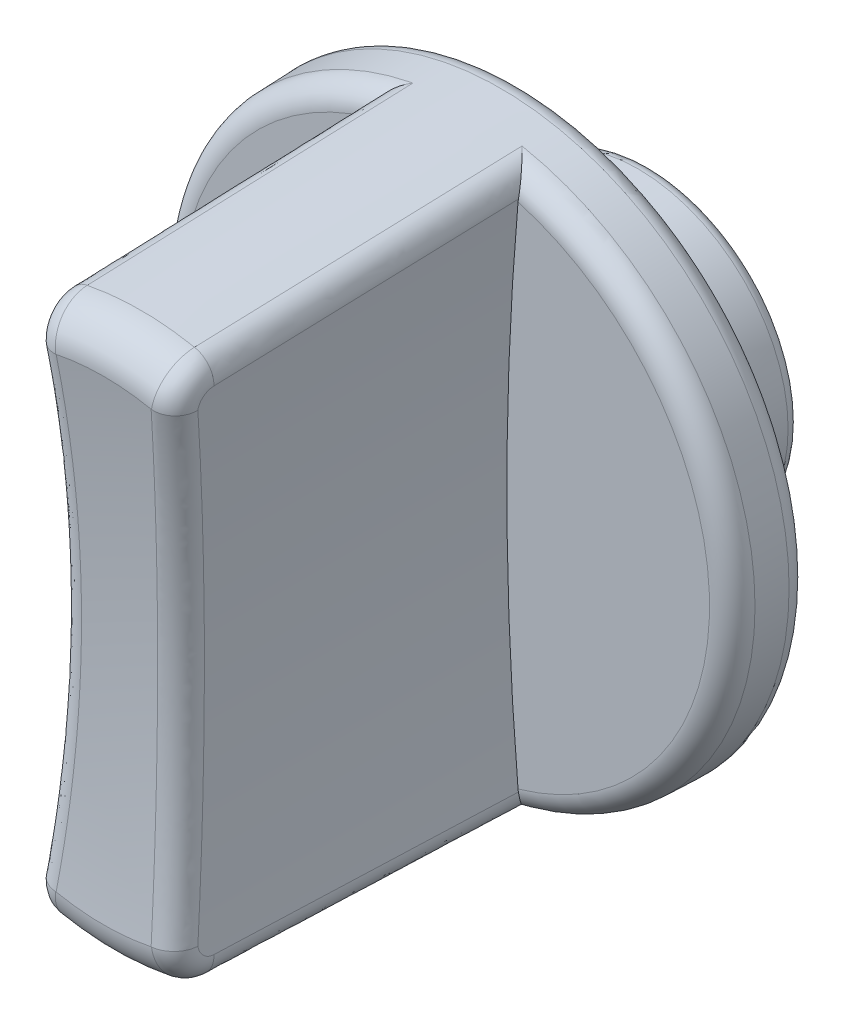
ISO-10303-21;
HEADER;
FILE_DESCRIPTION(('STEP AP214'),'2;1');
FILE_NAME('part.step','',(''),(''),'','','');
FILE_SCHEMA(('AUTOMOTIVE_DESIGN { 1 0 10303 214 1 1 1 1 }'));
ENDSEC;
DATA;
#1=APPLICATION_CONTEXT('core data for automotive mechanical design processes');
#2=APPLICATION_PROTOCOL_DEFINITION('international standard','automotive_design',2000,#1);
#3=PRODUCT_CONTEXT('',#1,'mechanical');
#4=PRODUCT('Part','Part','',(#3));
#5=PRODUCT_RELATED_PRODUCT_CATEGORY('part','',(#4));
#6=PRODUCT_DEFINITION_FORMATION('','',#4);
#7=PRODUCT_DEFINITION_CONTEXT('part definition',#1,'design');
#8=PRODUCT_DEFINITION('design','',#6,#7);
#9=PRODUCT_DEFINITION_SHAPE('','',#8);
#10=(LENGTH_UNIT() NAMED_UNIT(*) SI_UNIT(.MILLI.,.METRE.));
#11=(NAMED_UNIT(*) PLANE_ANGLE_UNIT() SI_UNIT($,.RADIAN.));
#12=(NAMED_UNIT(*) SI_UNIT($,.STERADIAN.) SOLID_ANGLE_UNIT());
#13=UNCERTAINTY_MEASURE_WITH_UNIT(LENGTH_MEASURE(1.E-05),#10,'distance_accuracy_value','');
#14=(GEOMETRIC_REPRESENTATION_CONTEXT(3) GLOBAL_UNCERTAINTY_ASSIGNED_CONTEXT((#13)) GLOBAL_UNIT_ASSIGNED_CONTEXT((#10,
#11,#12)) REPRESENTATION_CONTEXT('',''));
#15=CARTESIAN_POINT('',(0.,0.,0.));
#16=DIRECTION('',(0.,0.,1.));
#17=DIRECTION('',(1.,0.,0.));
#18=AXIS2_PLACEMENT_3D('',#15,#16,#17);
#19=CARTESIAN_POINT('',(0.,0.,6.86241624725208));
#20=DIRECTION('',(0.,0.,-1.));
#21=DIRECTION('',(-1.,0.,0.));
#22=AXIS2_PLACEMENT_3D('',#19,#20,#21);
#23=CONICAL_SURFACE('',#22,12.4698837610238,0.0349065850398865);
#24=CARTESIAN_POINT('',(0.,0.,8.2848994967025));
#25=DIRECTION('',(0.,0.,-1.));
#26=DIRECTION('',(-1.,0.,0.));
#27=AXIS2_PLACEMENT_3D('',#24,#25,#26);
#28=CIRCLE('',#27,12.4202095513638);
#29=CARTESIAN_POINT('',(-2.35538794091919,-12.1948248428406,8.28489949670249));
#30=VERTEX_POINT('',#29);
#31=CARTESIAN_POINT('',(-2.35538794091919,12.1948248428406,8.28489949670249));
#32=VERTEX_POINT('',#31);
#33=EDGE_CURVE('E148',#30,#32,#28,.T.);
#34=ORIENTED_EDGE('',*,*,#33,.T.);
#35=CARTESIAN_POINT('',(-2.26396741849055,10.9591425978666,43.4978114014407));
#36=CARTESIAN_POINT('',(-3.12852006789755,10.7806784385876,43.4939605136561));
#37=CARTESIAN_POINT('',(-3.05863794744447,9.9012081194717,43.4629119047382));
#38=CARTESIAN_POINT('',(-2.27229827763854,11.0828563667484,39.9800964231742));
#39=CARTESIAN_POINT('',(-3.1392994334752,10.9053806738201,39.9724846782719));
#40=CARTESIAN_POINT('',(-3.06836614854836,10.0236377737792,39.9451969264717));
#41=CARTESIAN_POINT('',(-2.2808765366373,11.2064808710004,36.4623794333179));
#42=CARTESIAN_POINT('',(-3.15024413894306,11.0298113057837,36.4550023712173));
#43=CARTESIAN_POINT('',(-3.07827024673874,10.1459965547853,36.4274799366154));
#44=CARTESIAN_POINT('',(-2.29851499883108,11.4535661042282,29.4269418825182));
#45=CARTESIAN_POINT('',(-3.17248858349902,11.2784466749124,29.4196678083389));
#46=CARTESIAN_POINT('',(-3.09843023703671,10.3905828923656,29.3920423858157));
#47=CARTESIAN_POINT('',(-2.30757520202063,11.5770268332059,25.9092213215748));
#48=CARTESIAN_POINT('',(-3.18378785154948,11.4026373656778,25.9021988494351));
#49=CARTESIAN_POINT('',(-3.10868612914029,10.5128104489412,25.8743218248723));
#50=CARTESIAN_POINT('',(-2.32616469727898,11.8237992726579,18.873777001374));
#51=CARTESIAN_POINT('',(-3.20674146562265,11.650814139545,18.8668750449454));
#52=CARTESIAN_POINT('',(-3.12954970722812,10.7571448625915,18.8388775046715));
#53=CARTESIAN_POINT('',(-2.3356939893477,11.9471109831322,15.3560532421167));
#54=CARTESIAN_POINT('',(-3.21839538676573,11.7747875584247,15.3493668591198));
#55=CARTESIAN_POINT('',(-3.1401573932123,10.8792517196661,15.3211537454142));
#56=CARTESIAN_POINT('',(-2.35521116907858,12.1935970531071,8.32060282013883));
#57=CARTESIAN_POINT('',(-3.24205818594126,12.0225435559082,8.31404485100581));
#58=CARTESIAN_POINT('',(-3.16172455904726,11.1233531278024,8.28570332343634));
#59=CARTESIAN_POINT('',(-2.36519905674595,12.3167714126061,4.80287615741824));
#60=CARTESIAN_POINT('',(-3.25406667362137,12.1463145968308,4.79654773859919));
#61=CARTESIAN_POINT('',(-3.17268403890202,11.2453476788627,4.76797666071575));
#62=CARTESIAN_POINT('',(-2.37541099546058,12.4398829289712,1.28514823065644));
#63=CARTESIAN_POINT('',(-3.26624163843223,12.2698878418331,1.28205067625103));
#64=CARTESIAN_POINT('',(-3.1838194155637,11.3672902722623,1.25024873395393));
#65=(BOUNDED_SURFACE() B_SPLINE_SURFACE(3,2,((#35,#36,#37),(#38,#39,#40),(#41,#42,#43),(#44,#45,
#46),(#47,#48,#49),(#50,#51,#52),(#53,#54,#55),(#56,#57,#58),(#59,#60,#61),(#62,#63,#64)),
.UNSPECIFIED.,.F.,.F.,.F.) B_SPLINE_SURFACE_WITH_KNOTS((4,2,2,2,4),(3,3),(0.,10.5596780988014,
21.1193560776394,31.6790340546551,42.2387121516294),(0.,1.),
.UNSPECIFIED.) GEOMETRIC_REPRESENTATION_ITEM() RATIONAL_B_SPLINE_SURFACE(((1.,0.749675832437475,
1.),(1.,0.748852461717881,1.),(1.,0.74805144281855,1.),(1.,0.746490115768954,1.),(1.,
0.745729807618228,1.),(1.,0.744245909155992,1.),(1.,0.743522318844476,1.),(1.,0.742108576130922,
1.),(1.,0.741418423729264,1.),(1.,0.740743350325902,1.))) REPRESENTATION_ITEM('') SURFACE());
#66=CARTESIAN_POINT('',(-2.37541099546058,12.4398829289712,1.28514823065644));
#67=CARTESIAN_POINT('',(-2.36519905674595,12.3167714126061,4.80287615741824));
#68=CARTESIAN_POINT('',(-2.35521116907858,12.193597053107,8.32060282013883));
#69=CARTESIAN_POINT('',(-2.3356939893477,11.9471109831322,15.3560532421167));
#70=CARTESIAN_POINT('',(-2.32616469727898,11.8237992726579,18.873777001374));
#71=CARTESIAN_POINT('',(-2.30757520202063,11.5770268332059,25.9092213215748));
#72=CARTESIAN_POINT('',(-2.29851499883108,11.4535661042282,29.4269418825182));
#73=CARTESIAN_POINT('',(-2.2808765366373,11.2064808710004,36.4623794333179));
#74=CARTESIAN_POINT('',(-2.27229827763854,11.0828563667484,39.9800964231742));
#75=CARTESIAN_POINT('',(-2.26396741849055,10.9591425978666,43.4978114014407));
#76=B_SPLINE_CURVE_WITH_KNOTS('',3,(#66,#67,#68,#69,#70,#71,#72,#73,#74,#75),.UNSPECIFIED.,.F.,
.F.,(4,2,2,2,4),(0.,10.5596780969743,21.11935607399,31.679034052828,42.2387121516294),.UNSPECIFIED.);
#77=CARTESIAN_POINT('',(-2.31686994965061,11.7004130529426,22.3914991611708));
#78=VERTEX_POINT('',#77);
#79=EDGE_CURVE('E471',#32,#78,#76,.T.);
#80=ORIENTED_EDGE('',*,*,#79,.T.);
#81=CARTESIAN_POINT('',(0.,0.,22.3914991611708));
#82=DIRECTION('',(0.,0.,1.));
#83=DIRECTION('',(1.,0.,0.));
#84=AXIS2_PLACEMENT_3D('',#81,#82,#83);
#85=CIRCLE('',#84,11.9275962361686);
#86=CARTESIAN_POINT('',(2.31686994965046,11.7004130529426,22.3914991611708));
#87=VERTEX_POINT('',#86);
#88=EDGE_CURVE('E164',#87,#78,#85,.T.);
#89=ORIENTED_EDGE('',*,*,#88,.F.);
#90=CARTESIAN_POINT('',(3.0586379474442,9.9012081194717,43.4629119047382));
#91=CARTESIAN_POINT('',(3.12852006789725,10.7806784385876,43.4939605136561));
#92=CARTESIAN_POINT('',(2.26396741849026,10.9591425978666,43.4978114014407));
#93=CARTESIAN_POINT('',(3.06836614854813,10.0236377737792,39.9451969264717));
#94=CARTESIAN_POINT('',(3.13929943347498,10.9053806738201,39.9724846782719));
#95=CARTESIAN_POINT('',(2.27229827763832,11.0828563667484,39.9800964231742));
#96=CARTESIAN_POINT('',(3.07827024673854,10.1459965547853,36.4274799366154));
#97=CARTESIAN_POINT('',(3.15024413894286,11.0298113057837,36.4550023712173));
#98=CARTESIAN_POINT('',(2.2808765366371,11.2064808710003,36.4623794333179));
#99=CARTESIAN_POINT('',(3.09843023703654,10.3905828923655,29.3920423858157));
#100=CARTESIAN_POINT('',(3.17248858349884,11.2784466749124,29.4196678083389));
#101=CARTESIAN_POINT('',(2.2985149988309,11.4535661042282,29.4269418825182));
#102=CARTESIAN_POINT('',(3.10868612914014,10.5128104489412,25.8743218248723));
#103=CARTESIAN_POINT('',(3.1837878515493,11.4026373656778,25.9021988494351));
#104=CARTESIAN_POINT('',(2.30757520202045,11.5770268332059,25.9092213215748));
#105=CARTESIAN_POINT('',(3.12954970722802,10.7571448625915,18.8388775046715));
#106=CARTESIAN_POINT('',(3.20674146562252,11.650814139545,18.8668750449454));
#107=CARTESIAN_POINT('',(2.32616469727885,11.8237992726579,18.873777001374));
#108=CARTESIAN_POINT('',(3.14015739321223,10.8792517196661,15.3211537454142));
#109=CARTESIAN_POINT('',(3.21839538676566,11.7747875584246,15.3493668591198));
#110=CARTESIAN_POINT('',(2.33569398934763,11.9471109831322,15.3560532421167));
#111=CARTESIAN_POINT('',(3.16172455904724,11.1233531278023,8.28570332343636));
#112=CARTESIAN_POINT('',(3.24205818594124,12.0225435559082,8.31404485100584));
#113=CARTESIAN_POINT('',(2.35521116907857,12.193597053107,8.32060282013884));
#114=CARTESIAN_POINT('',(3.17268403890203,11.2453476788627,4.76797666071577));
#115=CARTESIAN_POINT('',(3.25406667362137,12.1463145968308,4.79654773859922));
#116=CARTESIAN_POINT('',(2.36519905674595,12.3167714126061,4.80287615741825));
#117=CARTESIAN_POINT('',(3.18381941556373,11.3672902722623,1.25024873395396));
#118=CARTESIAN_POINT('',(3.26624163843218,12.2698878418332,1.28205067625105));
#119=CARTESIAN_POINT('',(2.37541099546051,12.4398829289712,1.28514823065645));
#120=(BOUNDED_SURFACE() B_SPLINE_SURFACE(3,2,((#90,#91,#92),(#93,#94,#95),(#96,#97,#98),(#99,
#100,#101),(#102,#103,#104),(#105,#106,#107),(#108,#109,#110),(#111,#112,#113),(#114,#115,#116),
(#117,#118,#119)),.UNSPECIFIED.,.F.,.F.,.F.) B_SPLINE_SURFACE_WITH_KNOTS((4,2,2,2,4),(3,3),(0.,
10.5596780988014,21.1193560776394,31.6790340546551,42.2387121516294),(0.,1.),
.UNSPECIFIED.) GEOMETRIC_REPRESENTATION_ITEM() RATIONAL_B_SPLINE_SURFACE(((1.,0.749675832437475,
1.),(1.,0.748852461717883,1.),(1.,0.748051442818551,1.),(1.,0.746490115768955,1.),(1.,
0.745729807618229,1.),(1.,0.744245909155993,1.),(1.,0.743522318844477,1.),(1.,0.742108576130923,
1.),(1.,0.741418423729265,1.),(1.,0.740743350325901,1.))) REPRESENTATION_ITEM('') SURFACE());
#121=CARTESIAN_POINT('',(2.26396741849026,10.9591425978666,43.4978114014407));
#122=CARTESIAN_POINT('',(2.27229827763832,11.0828563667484,39.9800964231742));
#123=CARTESIAN_POINT('',(2.2808765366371,11.2064808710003,36.4623794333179));
#124=CARTESIAN_POINT('',(2.2985149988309,11.4535661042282,29.4269418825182));
#125=CARTESIAN_POINT('',(2.30757520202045,11.5770268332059,25.9092213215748));
#126=CARTESIAN_POINT('',(2.32616469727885,11.8237992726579,18.873777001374));
#127=CARTESIAN_POINT('',(2.33569398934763,11.9471109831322,15.3560532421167));
#128=CARTESIAN_POINT('',(2.35521116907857,12.193597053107,8.32060282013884));
#129=CARTESIAN_POINT('',(2.36519905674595,12.3167714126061,4.80287615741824));
#130=CARTESIAN_POINT('',(2.37541099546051,12.4398829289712,1.28514823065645));
#131=B_SPLINE_CURVE_WITH_KNOTS('',3,(#121,#122,#123,#124,#125,#126,#127,#128,#129,#130),
.UNSPECIFIED.,.F.,.F.,(4,2,2,2,4),(0.,10.5596780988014,21.1193560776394,31.6790340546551,
42.2387121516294),.UNSPECIFIED.);
#132=CARTESIAN_POINT('',(2.35538794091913,12.1948248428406,8.28489949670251));
#133=VERTEX_POINT('',#132);
#134=EDGE_CURVE('E642',#87,#133,#131,.T.);
#135=ORIENTED_EDGE('',*,*,#134,.T.);
#136=CARTESIAN_POINT('',(0.,0.,8.2848994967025));
#137=DIRECTION('',(0.,0.,-1.));
#138=DIRECTION('',(-1.,0.,0.));
#139=AXIS2_PLACEMENT_3D('',#136,#137,#138);
#140=CIRCLE('',#139,12.4202095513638);
#141=CARTESIAN_POINT('',(2.35538794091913,-12.1948248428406,8.28489949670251));
#142=VERTEX_POINT('',#141);
#143=EDGE_CURVE('E648',#133,#142,#140,.T.);
#144=ORIENTED_EDGE('',*,*,#143,.T.);
#145=CARTESIAN_POINT('',(2.26396741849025,-10.9591425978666,43.4978114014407));
#146=CARTESIAN_POINT('',(3.12852006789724,-10.7806784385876,43.4939605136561));
#147=CARTESIAN_POINT('',(3.05863794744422,-9.9012081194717,43.4629119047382));
#148=CARTESIAN_POINT('',(2.27229827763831,-11.0828563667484,39.9800964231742));
#149=CARTESIAN_POINT('',(3.13929943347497,-10.9053806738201,39.9724846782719));
#150=CARTESIAN_POINT('',(3.06836614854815,-10.0236377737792,39.9451969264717));
#151=CARTESIAN_POINT('',(2.28087653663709,-11.2064808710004,36.4623794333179));
#152=CARTESIAN_POINT('',(3.15024413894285,-11.0298113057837,36.4550023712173));
#153=CARTESIAN_POINT('',(3.07827024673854,-10.1459965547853,36.4274799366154));
#154=CARTESIAN_POINT('',(2.29851499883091,-11.4535661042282,29.4269418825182));
#155=CARTESIAN_POINT('',(3.17248858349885,-11.2784466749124,29.4196678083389));
#156=CARTESIAN_POINT('',(3.09843023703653,-10.3905828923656,29.3920423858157));
#157=CARTESIAN_POINT('',(2.30757520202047,-11.5770268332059,25.9092213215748));
#158=CARTESIAN_POINT('',(3.18378785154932,-11.4026373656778,25.9021988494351));
#159=CARTESIAN_POINT('',(3.10868612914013,-10.5128104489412,25.8743218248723));
#160=CARTESIAN_POINT('',(2.32616469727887,-11.8237992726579,18.873777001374));
#161=CARTESIAN_POINT('',(3.20674146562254,-11.650814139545,18.8668750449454));
#162=CARTESIAN_POINT('',(3.12954970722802,-10.7571448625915,18.8388775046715));
#163=CARTESIAN_POINT('',(2.33569398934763,-11.9471109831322,15.3560532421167));
#164=CARTESIAN_POINT('',(3.21839538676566,-11.7747875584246,15.3493668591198));
#165=CARTESIAN_POINT('',(3.14015739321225,-10.8792517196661,15.3211537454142));
#166=CARTESIAN_POINT('',(2.35521116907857,-12.193597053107,8.32060282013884));
#167=CARTESIAN_POINT('',(3.24205818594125,-12.0225435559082,8.31404485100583));
#168=CARTESIAN_POINT('',(3.16172455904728,-11.1233531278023,8.28570332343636));
#169=CARTESIAN_POINT('',(2.36519905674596,-12.3167714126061,4.80287615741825));
#170=CARTESIAN_POINT('',(3.25406667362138,-12.1463145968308,4.79654773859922));
#171=CARTESIAN_POINT('',(3.17268403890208,-11.2453476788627,4.76797666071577));
#172=CARTESIAN_POINT('',(2.37541099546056,-12.4398829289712,1.28514823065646));
#173=CARTESIAN_POINT('',(3.26624163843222,-12.2698878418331,1.28205067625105));
#174=CARTESIAN_POINT('',(3.18381941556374,-11.3672902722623,1.25024873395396));
#175=(BOUNDED_SURFACE() B_SPLINE_SURFACE(3,2,((#145,#146,#147),(#148,#149,#150),(#151,#152,
#153),(#154,#155,#156),(#157,#158,#159),(#160,#161,#162),(#163,#164,#165),(#166,#167,#168),
(#169,#170,#171),(#172,#173,#174)),.UNSPECIFIED.,.F.,.F.,.F.) B_SPLINE_SURFACE_WITH_KNOTS((4,2,
2,2,4),(3,3),(0.,10.5596780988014,21.1193560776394,31.6790340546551,42.2387121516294),(0.,1.),
.UNSPECIFIED.) GEOMETRIC_REPRESENTATION_ITEM() RATIONAL_B_SPLINE_SURFACE(((1.,0.749675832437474,
1.),(1.,0.748852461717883,1.),(1.,0.748051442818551,1.),(1.,0.746490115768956,1.),(1.,
0.745729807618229,1.),(1.,0.744245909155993,1.),(1.,0.743522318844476,1.),(1.,0.742108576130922,
1.),(1.,0.741418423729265,1.),(1.,0.740743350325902,1.))) REPRESENTATION_ITEM('') SURFACE());
#176=CARTESIAN_POINT('',(2.37541099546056,-12.4398829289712,1.28514823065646));
#177=CARTESIAN_POINT('',(2.36519905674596,-12.3167714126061,4.80287615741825));
#178=CARTESIAN_POINT('',(2.35521116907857,-12.193597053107,8.32060282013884));
#179=CARTESIAN_POINT('',(2.33569398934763,-11.9471109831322,15.3560532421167));
#180=CARTESIAN_POINT('',(2.32616469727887,-11.8237992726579,18.873777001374));
#181=CARTESIAN_POINT('',(2.30757520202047,-11.5770268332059,25.9092213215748));
#182=CARTESIAN_POINT('',(2.29851499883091,-11.4535661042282,29.4269418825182));
#183=CARTESIAN_POINT('',(2.28087653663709,-11.2064808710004,36.4623794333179));
#184=CARTESIAN_POINT('',(2.2722982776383,-11.0828563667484,39.9800964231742));
#185=CARTESIAN_POINT('',(2.26396741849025,-10.9591425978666,43.4978114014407));
#186=B_SPLINE_CURVE_WITH_KNOTS('',3,(#176,#177,#178,#179,#180,#181,#182,#183,#184,#185),
.UNSPECIFIED.,.F.,.F.,(4,2,2,2,4),(0.,10.5596780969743,21.11935607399,31.679034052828,
42.2387121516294),.UNSPECIFIED.);
#187=CARTESIAN_POINT('',(2.31686994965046,-11.7004130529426,22.3914991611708));
#188=VERTEX_POINT('',#187);
#189=EDGE_CURVE('E149',#142,#188,#186,.T.);
#190=ORIENTED_EDGE('',*,*,#189,.T.);
#191=CARTESIAN_POINT('',(-2.31686994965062,-11.7004130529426,22.3914991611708));
#192=VERTEX_POINT('',#191);
#193=EDGE_CURVE('E154',#192,#188,#85,.T.);
#194=ORIENTED_EDGE('',*,*,#193,.F.);
#195=CARTESIAN_POINT('',(-3.05863794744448,-9.9012081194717,43.4629119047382));
#196=CARTESIAN_POINT('',(-3.12852006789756,-10.7806784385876,43.4939605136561));
#197=CARTESIAN_POINT('',(-2.26396741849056,-10.9591425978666,43.4978114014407));
#198=CARTESIAN_POINT('',(-3.06836614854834,-10.0236377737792,39.9451969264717));
#199=CARTESIAN_POINT('',(-3.13929943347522,-10.9053806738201,39.9724846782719));
#200=CARTESIAN_POINT('',(-2.27229827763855,-11.0828563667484,39.9800964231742));
#201=CARTESIAN_POINT('',(-3.07827024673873,-10.1459965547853,36.4274799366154));
#202=CARTESIAN_POINT('',(-3.15024413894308,-11.0298113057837,36.4550023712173));
#203=CARTESIAN_POINT('',(-2.28087653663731,-11.2064808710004,36.4623794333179));
#204=CARTESIAN_POINT('',(-3.0984302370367,-10.3905828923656,29.3920423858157));
#205=CARTESIAN_POINT('',(-3.17248858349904,-11.2784466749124,29.4196678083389));
#206=CARTESIAN_POINT('',(-2.29851499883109,-11.4535661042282,29.4269418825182));
#207=CARTESIAN_POINT('',(-3.1086861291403,-10.5128104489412,25.8743218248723));
#208=CARTESIAN_POINT('',(-3.18378785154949,-11.4026373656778,25.9021988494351));
#209=CARTESIAN_POINT('',(-2.30757520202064,-11.5770268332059,25.9092213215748));
#210=CARTESIAN_POINT('',(-3.12954970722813,-10.7571448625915,18.8388775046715));
#211=CARTESIAN_POINT('',(-3.20674146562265,-11.650814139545,18.8668750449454));
#212=CARTESIAN_POINT('',(-2.32616469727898,-11.8237992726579,18.873777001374));
#213=CARTESIAN_POINT('',(-3.1401573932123,-10.8792517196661,15.3211537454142));
#214=CARTESIAN_POINT('',(-3.21839538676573,-11.7747875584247,15.3493668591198));
#215=CARTESIAN_POINT('',(-2.3356939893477,-11.9471109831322,15.3560532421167));
#216=CARTESIAN_POINT('',(-3.16172455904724,-11.1233531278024,8.28570332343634));
#217=CARTESIAN_POINT('',(-3.24205818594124,-12.0225435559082,8.31404485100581));
#218=CARTESIAN_POINT('',(-2.35521116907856,-12.1935970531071,8.32060282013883));
#219=CARTESIAN_POINT('',(-3.17268403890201,-11.2453476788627,4.76797666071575));
#220=CARTESIAN_POINT('',(-3.25406667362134,-12.1463145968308,4.79654773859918));
#221=CARTESIAN_POINT('',(-2.36519905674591,-12.3167714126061,4.80287615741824));
#222=CARTESIAN_POINT('',(-3.18381941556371,-11.3672902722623,1.25024873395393));
#223=CARTESIAN_POINT('',(-3.26624163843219,-12.2698878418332,1.28205067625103));
#224=CARTESIAN_POINT('',(-2.37541099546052,-12.4398829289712,1.28514823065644));
#225=(BOUNDED_SURFACE() B_SPLINE_SURFACE(3,2,((#195,#196,#197),(#198,#199,#200),(#201,#202,
#203),(#204,#205,#206),(#207,#208,#209),(#210,#211,#212),(#213,#214,#215),(#216,#217,#218),
(#219,#220,#221),(#222,#223,#224)),.UNSPECIFIED.,.F.,.F.,.F.) B_SPLINE_SURFACE_WITH_KNOTS((4,2,
2,2,4),(3,3),(0.,10.5596780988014,21.1193560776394,31.6790340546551,42.2387121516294),(0.,1.),
.UNSPECIFIED.) GEOMETRIC_REPRESENTATION_ITEM() RATIONAL_B_SPLINE_SURFACE(((1.,0.749675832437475,
1.),(1.,0.748852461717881,1.),(1.,0.74805144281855,1.),(1.,0.746490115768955,1.),(1.,
0.745729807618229,1.),(1.,0.744245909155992,1.),(1.,0.743522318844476,1.),(1.,0.742108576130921,
1.),(1.,0.741418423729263,1.),(1.,0.740743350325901,1.))) REPRESENTATION_ITEM('') SURFACE());
#226=CARTESIAN_POINT('',(-2.26396741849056,-10.9591425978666,43.4978114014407));
#227=CARTESIAN_POINT('',(-2.27229827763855,-11.0828563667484,39.9800964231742));
#228=CARTESIAN_POINT('',(-2.28087653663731,-11.2064808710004,36.4623794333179));
#229=CARTESIAN_POINT('',(-2.29851499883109,-11.4535661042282,29.4269418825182));
#230=CARTESIAN_POINT('',(-2.30757520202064,-11.5770268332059,25.9092213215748));
#231=CARTESIAN_POINT('',(-2.32616469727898,-11.8237992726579,18.873777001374));
#232=CARTESIAN_POINT('',(-2.3356939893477,-11.9471109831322,15.3560532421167));
#233=CARTESIAN_POINT('',(-2.35521116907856,-12.1935970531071,8.32060282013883));
#234=CARTESIAN_POINT('',(-2.36519905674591,-12.3167714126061,4.80287615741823));
#235=CARTESIAN_POINT('',(-2.37541099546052,-12.4398829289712,1.28514823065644));
#236=B_SPLINE_CURVE_WITH_KNOTS('',3,(#226,#227,#228,#229,#230,#231,#232,#233,#234,#235),
.UNSPECIFIED.,.F.,.F.,(4,2,2,2,4),(0.,10.5596780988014,21.1193560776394,31.6790340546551,
42.2387121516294),.UNSPECIFIED.);
#237=EDGE_CURVE('E141',#192,#30,#236,.T.);
#238=ORIENTED_EDGE('',*,*,#237,.T.);
#239=EDGE_LOOP('',(#34,#80,#89,#135,#144,#190,#194,#238));
#240=FACE_BOUND('',#239,.T.);
#241=CARTESIAN_POINT('',(0.,0.,6.86241624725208));
#242=DIRECTION('',(0.,0.,1.));
#243=DIRECTION('',(1.,0.,0.));
#244=AXIS2_PLACEMENT_3D('',#241,#242,#243);
#245=CIRCLE('',#244,12.4698837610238);
#246=CARTESIAN_POINT('',(12.4698837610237,0.,6.86241624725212));
#247=VERTEX_POINT('',#246);
#248=EDGE_CURVE('E168',#247,#247,#245,.T.);
#249=ORIENTED_EDGE('',*,*,#248,.T.);
#250=EDGE_LOOP('',(#249));
#251=FACE_BOUND('',#250,.T.);
#252=ADVANCED_FACE('F14',(#240,#251),#23,.T.);
#253=CARTESIAN_POINT('',(0.,0.,22.3333333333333));
#254=DIRECTION('',(0.,0.,1.));
#255=DIRECTION('',(1.,0.,0.));
#256=AXIS2_PLACEMENT_3D('',#253,#254,#255);
#257=TOROIDAL_SURFACE('',#256,10.2619448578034,1.66666666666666);
#258=CARTESIAN_POINT('',(-4.60148244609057,21.9123883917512,25.6650824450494));
#259=CARTESIAN_POINT('',(-4.55007249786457,21.6236597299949,26.6168398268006));
#260=CARTESIAN_POINT('',(-3.56937554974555,21.7970600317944,26.6207344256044));
#261=CARTESIAN_POINT('',(-4.44308289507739,21.0228966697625,25.3844483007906));
#262=CARTESIAN_POINT('',(-4.39557785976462,20.7439508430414,26.3416180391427));
#263=CARTESIAN_POINT('',(-3.41180968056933,20.9122498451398,26.343792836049));
#264=CARTESIAN_POINT('',(-4.29344771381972,20.1265266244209,25.1209245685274));
#265=CARTESIAN_POINT('',(-4.24984903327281,19.8586825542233,26.08354728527));
#266=CARTESIAN_POINT('',(-3.26296205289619,20.0205975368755,26.0837365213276));
#267=CARTESIAN_POINT('',(-4.0125302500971,18.32159208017,24.6285326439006));
#268=CARTESIAN_POINT('',(-3.976253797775,18.0762221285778,25.6013026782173));
#269=CARTESIAN_POINT('',(-2.98352310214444,18.2251626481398,25.5978234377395));
#270=CARTESIAN_POINT('',(-3.88124862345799,17.4130271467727,24.3996656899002));
#271=CARTESIAN_POINT('',(-3.84845503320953,17.1792230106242,25.3772527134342));
#272=CARTESIAN_POINT('',(-2.85293243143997,17.3213796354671,25.3719678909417));
#273=CARTESIAN_POINT('',(-3.63786270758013,15.5852450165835,23.9770227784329));
#274=CARTESIAN_POINT('',(-3.6115032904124,15.374797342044,24.963447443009));
#275=CARTESIAN_POINT('',(-2.61082749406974,15.5032174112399,24.9548860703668));
#276=CARTESIAN_POINT('',(-3.52576017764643,14.6660268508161,23.7832500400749));
#277=CARTESIAN_POINT('',(-3.50241317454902,14.467584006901,24.7738049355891));
#278=CARTESIAN_POINT('',(-2.49931497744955,14.5888372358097,24.763662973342));
#279=CARTESIAN_POINT('',(-3.32143652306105,12.8188161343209,23.4312007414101));
#280=CARTESIAN_POINT('',(-3.30355643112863,12.6445161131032,24.4292071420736));
#281=CARTESIAN_POINT('',(-2.29606671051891,12.7513486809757,24.4162459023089));
#282=CARTESIAN_POINT('',(-3.229215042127,11.8908237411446,23.2729235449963));
#283=CARTESIAN_POINT('',(-3.21384295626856,11.7288937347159,24.2743456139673));
#284=CARTESIAN_POINT('',(-2.20433060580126,11.8282404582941,24.2600513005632));
#285=CARTESIAN_POINT('',(-2.98807761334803,9.15075571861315,22.8600462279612));
#286=CARTESIAN_POINT('',(-2.97908962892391,9.02388588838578,23.8700681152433));
#287=CARTESIAN_POINT('',(-1.96446232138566,9.10259384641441,23.8526065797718));
#288=CARTESIAN_POINT('',(-2.86747403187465,7.32848839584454,22.654960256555));
#289=CARTESIAN_POINT('',(-2.86190774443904,7.22720456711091,23.6696351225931));
#290=CARTESIAN_POINT('',(-1.84449349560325,7.28991740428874,23.6502191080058));
#291=CARTESIAN_POINT('',(-2.70638291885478,3.67081291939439,22.3813922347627));
#292=CARTESIAN_POINT('',(-2.70522453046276,3.61937384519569,23.4019914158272));
#293=CARTESIAN_POINT('',(-1.68425023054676,3.65149285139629,23.3802506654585));
#294=CARTESIAN_POINT('',(-2.66588523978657,1.83540645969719,22.3128928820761));
#295=CARTESIAN_POINT('',(-2.66588523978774,1.81019060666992,23.3350580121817));
#296=CARTESIAN_POINT('',(-1.64396569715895,1.82574642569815,23.3126526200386));
#297=CARTESIAN_POINT('',(-2.66588523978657,-1.83540645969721,22.3128928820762));
#298=CARTESIAN_POINT('',(-2.66588523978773,-1.81019060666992,23.3350580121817));
#299=CARTESIAN_POINT('',(-1.64396569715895,-1.82574642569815,23.3126526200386));
#300=CARTESIAN_POINT('',(-2.70638291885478,-3.6708129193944,22.3813922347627));
#301=CARTESIAN_POINT('',(-2.70522453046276,-3.61937384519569,23.4019914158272));
#302=CARTESIAN_POINT('',(-1.68425023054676,-3.6514928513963,23.3802506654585));
#303=CARTESIAN_POINT('',(-2.86747403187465,-7.32848839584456,22.6549602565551));
#304=CARTESIAN_POINT('',(-2.86190774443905,-7.22720456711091,23.6696351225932));
#305=CARTESIAN_POINT('',(-1.84449349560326,-7.28991740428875,23.6502191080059));
#306=CARTESIAN_POINT('',(-2.98807761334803,-9.15075571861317,22.8600462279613));
#307=CARTESIAN_POINT('',(-2.97908962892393,-9.02388588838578,23.8700681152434));
#308=CARTESIAN_POINT('',(-1.96446232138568,-9.10259384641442,23.852606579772));
#309=CARTESIAN_POINT('',(-3.229215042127,-11.8908237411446,23.2729235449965));
#310=CARTESIAN_POINT('',(-3.21384295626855,-11.728893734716,24.2743456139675));
#311=CARTESIAN_POINT('',(-2.20433060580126,-11.8282404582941,24.2600513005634));
#312=CARTESIAN_POINT('',(-3.32143652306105,-12.8188161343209,23.4312007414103));
#313=CARTESIAN_POINT('',(-3.30355643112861,-12.6445161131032,24.4292071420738));
#314=CARTESIAN_POINT('',(-2.29606671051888,-12.7513486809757,24.4162459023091));
#315=CARTESIAN_POINT('',(-3.52576017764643,-14.6660268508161,23.7832500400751));
#316=CARTESIAN_POINT('',(-3.502413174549,-14.467584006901,24.7738049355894));
#317=CARTESIAN_POINT('',(-2.49931497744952,-14.5888372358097,24.7636629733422));
#318=CARTESIAN_POINT('',(-3.63786270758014,-15.5852450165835,23.9770227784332));
#319=CARTESIAN_POINT('',(-3.6115032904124,-15.374797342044,24.9634474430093));
#320=CARTESIAN_POINT('',(-2.61082749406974,-15.5032174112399,24.954886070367));
#321=CARTESIAN_POINT('',(-3.88124862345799,-17.4130271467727,24.3996656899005));
#322=CARTESIAN_POINT('',(-3.84845503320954,-17.1792230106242,25.3772527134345));
#323=CARTESIAN_POINT('',(-2.85293243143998,-17.3213796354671,25.3719678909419));
#324=CARTESIAN_POINT('',(-4.01253025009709,-18.32159208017,24.628532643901));
#325=CARTESIAN_POINT('',(-3.97625379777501,-18.0762221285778,25.6013026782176));
#326=CARTESIAN_POINT('',(-2.98352310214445,-18.2251626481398,25.5978234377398));
#327=CARTESIAN_POINT('',(-4.2934477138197,-20.1265266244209,25.1209245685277));
#328=CARTESIAN_POINT('',(-4.24984903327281,-19.8586825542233,26.0835472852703));
#329=CARTESIAN_POINT('',(-3.26296205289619,-20.0205975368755,26.083736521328));
#330=CARTESIAN_POINT('',(-4.44308289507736,-21.0228966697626,25.384448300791));
#331=CARTESIAN_POINT('',(-4.39557785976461,-20.7439508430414,26.3416180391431));
#332=CARTESIAN_POINT('',(-3.41180968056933,-20.9122498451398,26.3437928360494));
#333=CARTESIAN_POINT('',(-4.60148244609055,-21.9123883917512,25.6650824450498));
#334=CARTESIAN_POINT('',(-4.55007249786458,-21.6236597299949,26.616839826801));
#335=CARTESIAN_POINT('',(-3.56937554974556,-21.7970600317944,26.6207344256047));
#336=(BOUNDED_SURFACE() B_SPLINE_SURFACE(3,2,((#258,#259,#260),(#261,#262,#263),(#264,#265,
#266),(#267,#268,#269),(#270,#271,#272),(#273,#274,#275),(#276,#277,#278),(#279,#280,#281),
(#282,#283,#284),(#285,#286,#287),(#288,#289,#290),(#291,#292,#293),(#294,#295,#296),(#297,#298,
#299),(#300,#301,#302),(#303,#304,#305),(#306,#307,#308),(#309,#310,#311),(#312,#313,#314),
(#315,#316,#317),(#318,#319,#320),(#321,#322,#323),(#324,#325,#326),(#327,#328,#329),(#330,#331,
#332),(#333,#334,#335)),.UNSPECIFIED.,.F.,.F.,.F.) B_SPLINE_SURFACE_WITH_KNOTS((4,2,2,2,2,2,2,2,
2,2,2,2,4),(3,3),(0.,2.85869705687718,5.71749623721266,8.57655751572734,11.4355675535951,
16.9849425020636,22.5336144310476,28.0822863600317,33.6316613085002,36.490671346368,
39.3497326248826,42.2085318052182,45.0672288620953),(0.,1.),
.UNSPECIFIED.) GEOMETRIC_REPRESENTATION_ITEM() RATIONAL_B_SPLINE_SURFACE(((1.,0.708552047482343,
1.),(1.,0.707800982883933,1.),(1.,0.707090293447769,1.),(1.,0.705754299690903,1.),(1.,
0.705128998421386,1.),(1.,0.703968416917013,1.),(1.,0.703433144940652,1.),(1.,0.702456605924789,
1.),(1.,0.702015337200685,1.),(1.,0.700860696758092,1.),(1.,0.700282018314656,1.),(1.,
0.699508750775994,1.),(1.,0.69931411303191,1.),(1.,0.69931411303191,1.),(1.,0.699508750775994,
1.),(1.,0.700282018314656,1.),(1.,0.700860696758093,1.),(1.,0.702015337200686,1.),(1.,
0.70245660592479,1.),(1.,0.703433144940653,1.),(1.,0.703968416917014,1.),(1.,0.705128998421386,
1.),(1.,0.705754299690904,1.),(1.,0.70709029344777,1.),(1.,0.707800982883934,1.),(1.,
0.708552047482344,1.))) REPRESENTATION_ITEM('') SURFACE());
#337=CARTESIAN_POINT('',(-2.05117297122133,-10.0548596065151,24.));
#338=CARTESIAN_POINT('',(-2.05388320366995,-10.0542700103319,24.0000000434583));
#339=CARTESIAN_POINT('',(-2.05660770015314,-10.053780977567,24.0000000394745));
#340=CARTESIAN_POINT('',(-2.06208523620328,-10.0530040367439,23.9999999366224));
#341=CARTESIAN_POINT('',(-2.06483827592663,-10.0527161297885,23.9999998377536));
#342=CARTESIAN_POINT('',(-2.06760557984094,-10.052528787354,23.9999996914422));
#343=B_SPLINE_CURVE_WITH_KNOTS('',3,(#337,#338,#339,#340,#341,#342),.UNSPECIFIED.,.F.,.F.,(4,2,
4),(0.,0.00830411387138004,0.0166082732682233),.UNSPECIFIED.);
#344=CARTESIAN_POINT('',(-2.05117297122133,-10.0548596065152,24.));
#345=VERTEX_POINT('',#344);
#346=CARTESIAN_POINT('',(-2.06760557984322,-10.0525287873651,23.9999996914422));
#347=VERTEX_POINT('',#346);
#348=EDGE_CURVE('E158',#345,#347,#343,.T.);
#349=ORIENTED_EDGE('',*,*,#348,.T.);
#350=CARTESIAN_POINT('',(-2.31331848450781,-11.6764623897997,22.0446059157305));
#351=CARTESIAN_POINT('',(-3.19335372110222,-11.5051542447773,22.0615747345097));
#352=CARTESIAN_POINT('',(-3.11829678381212,-10.6253569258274,22.2178423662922));
#353=CARTESIAN_POINT('',(-2.31479567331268,-11.686422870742,22.1017532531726));
#354=CARTESIAN_POINT('',(-3.19414364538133,-11.5140771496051,22.1154327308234));
#355=CARTESIAN_POINT('',(-3.1186381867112,-10.6293579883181,22.2407013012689));
#356=CARTESIAN_POINT('',(-2.31583203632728,-11.6934122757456,22.1594077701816));
#357=CARTESIAN_POINT('',(-3.19469798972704,-11.5203357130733,22.1697160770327));
#358=CARTESIAN_POINT('',(-3.1188778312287,-10.6321655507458,22.2637631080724));
#359=CARTESIAN_POINT('',(-2.31701895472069,-11.7014177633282,22.2752345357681));
#360=CARTESIAN_POINT('',(-3.19533282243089,-11.5275012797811,22.278692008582));
#361=CARTESIAN_POINT('',(-3.1191523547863,-10.6353812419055,22.310093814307));
#362=CARTESIAN_POINT('',(-2.31716811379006,-11.7024244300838,22.3334074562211));
#363=CARTESIAN_POINT('',(-3.19541276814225,-11.5284021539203,22.3334025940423));
#364=CARTESIAN_POINT('',(-3.11918691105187,-10.63578558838,22.3333629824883));
#365=CARTESIAN_POINT('',(-2.31639168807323,-11.6971867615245,22.4846794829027));
#366=CARTESIAN_POINT('',(-3.19499728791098,-11.5237145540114,22.4756925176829));
#367=CARTESIAN_POINT('',(-3.1190072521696,-10.6336817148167,22.3938717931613));
#368=CARTESIAN_POINT('',(-2.31476251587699,-11.6861953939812,22.5776508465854));
#369=CARTESIAN_POINT('',(-3.19412475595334,-11.5138731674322,22.563216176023));
#370=CARTESIAN_POINT('',(-3.11863016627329,-10.6292667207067,22.4310603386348));
#371=CARTESIAN_POINT('',(-2.30924238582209,-11.6489854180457,22.7604134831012));
#372=CARTESIAN_POINT('',(-3.1911741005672,-11.4805151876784,22.7356494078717));
#373=CARTESIAN_POINT('',(-3.11735542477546,-10.6143193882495,22.5041653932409));
#374=CARTESIAN_POINT('',(-2.30535006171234,-11.6227576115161,22.8502028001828));
#375=CARTESIAN_POINT('',(-3.18909281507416,-11.4569627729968,22.8206261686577));
#376=CARTESIAN_POINT('',(-3.1164574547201,-10.603783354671,22.540081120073));
#377=CARTESIAN_POINT('',(-2.29540851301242,-11.5558598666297,23.0239999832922));
#378=CARTESIAN_POINT('',(-3.18379040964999,-11.3967403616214,22.9858566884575));
#379=CARTESIAN_POINT('',(-3.11417222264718,-10.576907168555,22.609599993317));
#380=CARTESIAN_POINT('',(-2.2893603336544,-11.5151969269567,23.1080106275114));
#381=CARTESIAN_POINT('',(-3.18056557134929,-11.3600279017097,23.0661720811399));
#382=CARTESIAN_POINT('',(-3.1127851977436,-10.5605698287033,22.6432042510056));
#383=CARTESIAN_POINT('',(-2.27526535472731,-11.4206102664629,23.2679339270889));
#384=CARTESIAN_POINT('',(-3.17307255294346,-11.2743097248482,23.2201728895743));
#385=CARTESIAN_POINT('',(-3.10956849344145,-10.5225624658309,22.7071735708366));
#386=CARTESIAN_POINT('',(-2.26721832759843,-11.3666850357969,23.343845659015));
#387=CARTESIAN_POINT('',(-3.168798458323,-11.2252353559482,23.2939020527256));
#388=CARTESIAN_POINT('',(-3.10773876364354,-10.500891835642,22.7375382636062));
#389=CARTESIAN_POINT('',(-2.24931328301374,-11.2469792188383,23.4856424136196));
#390=CARTESIAN_POINT('',(-3.15931907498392,-11.1157424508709,23.4330999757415));
#391=CARTESIAN_POINT('',(-3.10369193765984,-10.4527786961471,22.7942569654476));
#392=CARTESIAN_POINT('',(-2.23945050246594,-11.1811674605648,23.5515002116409));
#393=CARTESIAN_POINT('',(-3.15410444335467,-11.0552123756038,23.498570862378));
#394=CARTESIAN_POINT('',(-3.1014738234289,-10.426323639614,22.8206000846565));
#395=CARTESIAN_POINT('',(-2.21818676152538,-11.0396777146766,23.6711331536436));
#396=CARTESIAN_POINT('',(-3.14289900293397,-10.924231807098,23.619366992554));
#397=CARTESIAN_POINT('',(-3.09672535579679,-10.3694367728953,22.8684532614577));
#398=CARTESIAN_POINT('',(-2.20678568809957,-10.9639990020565,23.7249074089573));
#399=CARTESIAN_POINT('',(-3.1369006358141,-10.8536892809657,23.6746932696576));
#400=CARTESIAN_POINT('',(-3.09419497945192,-10.3390046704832,22.8899629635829));
#401=CARTESIAN_POINT('',(-2.18267195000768,-10.8044518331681,23.8191920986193));
#402=CARTESIAN_POINT('',(-3.12425329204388,-10.7037880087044,23.7740229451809));
#403=CARTESIAN_POINT('',(-3.08888559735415,-10.2748333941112,22.9276768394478));
#404=CARTESIAN_POINT('',(-2.16995181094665,-10.7205368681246,23.8596208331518));
#405=CARTESIAN_POINT('',(-3.1175932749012,-10.6242861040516,23.8179300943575));
#406=CARTESIAN_POINT('',(-3.08610518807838,-10.2410754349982,22.9438483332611));
#407=CARTESIAN_POINT('',(-2.14359544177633,-10.5472934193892,23.9256759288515));
#408=CARTESIAN_POINT('',(-3.10383114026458,-10.458604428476,23.8926827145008));
#409=CARTESIAN_POINT('',(-3.08039428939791,-10.1713650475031,22.970270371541));
#410=CARTESIAN_POINT('',(-2.1299592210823,-10.4579649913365,23.951302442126));
#411=CARTESIAN_POINT('',(-3.09672226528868,-10.3723355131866,23.9234760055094));
#412=CARTESIAN_POINT('',(-3.07746380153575,-10.1354126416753,22.9805209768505));
#413=CARTESIAN_POINT('',(-2.1020460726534,-10.2758300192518,23.9871885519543));
#414=CARTESIAN_POINT('',(-3.08220021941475,-10.1945269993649,23.9710674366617));
#415=CARTESIAN_POINT('',(-3.07152050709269,-10.0620890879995,22.9948754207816));
#416=CARTESIAN_POINT('',(-2.08776564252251,-10.1830050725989,23.9973500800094));
#417=CARTESIAN_POINT('',(-3.07478036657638,-10.1028857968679,23.9876954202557));
#418=CARTESIAN_POINT('',(-3.0685072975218,-10.024710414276,22.9989400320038));
#419=CARTESIAN_POINT('',(-2.05903313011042,-9.99701786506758,24.001742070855));
#420=CARTESIAN_POINT('',(-3.05986905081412,-9.91702812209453,24.0057645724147));
#421=CARTESIAN_POINT('',(-3.06250263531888,-9.94979691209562,23.0006968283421));
#422=CARTESIAN_POINT('',(-2.04458101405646,-9.90385554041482,23.9959693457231));
#423=CARTESIAN_POINT('',(-3.05237447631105,-9.82276089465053,24.0071008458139));
#424=CARTESIAN_POINT('',(-3.05951118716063,-9.91226205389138,22.9983877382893));
#425=CARTESIAN_POINT('',(-2.01585849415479,-9.71949837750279,23.9685804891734));
#426=CARTESIAN_POINT('',(-3.03748239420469,-9.63373320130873,23.9939344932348));
#427=CARTESIAN_POINT('',(-3.05362323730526,-9.83796434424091,22.9874321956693));
#428=CARTESIAN_POINT('',(-2.0015889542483,-9.62831203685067,23.9469061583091));
#429=CARTESIAN_POINT('',(-3.03008523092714,-9.53895812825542,23.9792570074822));
#430=CARTESIAN_POINT('',(-3.05072712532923,-9.80120484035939,22.9787624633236));
#431=CARTESIAN_POINT('',(-1.97368736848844,-9.45075737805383,23.8883123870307));
#432=CARTESIAN_POINT('',(-3.0156050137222,-9.35183351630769,23.933765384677));
#433=CARTESIAN_POINT('',(-3.04511633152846,-9.72960879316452,22.9553249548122));
#434=CARTESIAN_POINT('',(-1.96005579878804,-9.36439264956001,23.8513817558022));
#435=CARTESIAN_POINT('',(-3.00852513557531,-9.25951170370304,23.9028216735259));
#436=CARTESIAN_POINT('',(-3.0424017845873,-9.69477368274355,22.9405527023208));
#437=CARTESIAN_POINT('',(-1.94695481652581,-9.28175610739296,23.8071718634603));
#438=CARTESIAN_POINT('',(-3.00173666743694,-9.17021307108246,23.8638648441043));
#439=CARTESIAN_POINT('',(-3.0398176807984,-9.66143285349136,22.9228687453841));
#440=(BOUNDED_SURFACE() B_SPLINE_SURFACE(3,2,((#350,#351,#352),(#353,#354,#355),(#356,#357,
#358),(#359,#360,#361),(#362,#363,#364),(#365,#366,#367),(#368,#369,#370),(#371,#372,#373),
(#374,#375,#376),(#377,#378,#379),(#380,#381,#382),(#383,#384,#385),(#386,#387,#388),(#389,#390,
#391),(#392,#393,#394),(#395,#396,#397),(#398,#399,#400),(#401,#402,#403),(#404,#405,#406),
(#407,#408,#409),(#410,#411,#412),(#413,#414,#415),(#416,#417,#418),(#419,#420,#421),(#422,#423,
#424),(#425,#426,#427),(#428,#429,#430),(#431,#432,#433),(#434,#435,#436),(#437,#438,#439)),
.UNSPECIFIED.,.F.,.F.,.F.) B_SPLINE_SURFACE_WITH_KNOTS((4,2,2,2,2,2,2,2,2,2,2,2,2,2,4),(3,3),
(0.,0.0695905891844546,0.139290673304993,0.251091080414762,0.362959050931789,0.474772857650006,
0.586599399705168,0.698723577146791,0.810855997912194,0.92366267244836,1.03646818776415,
1.14998610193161,1.26352672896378,1.37748499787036,1.49152700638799),(0.,1.),
.UNSPECIFIED.) GEOMETRIC_REPRESENTATION_ITEM() RATIONAL_B_SPLINE_SURFACE(((1.,0.744509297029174,
1.),(1.,0.744708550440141,1.),(1.,0.744848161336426,1.),(1.,0.745007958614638,1.),(1.,
0.745027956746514,1.),(1.,0.744923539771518,1.),(1.,0.744704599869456,1.),(1.,0.743958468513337,
1.),(1.,0.743431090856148,1.),(1.,0.742071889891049,1.),(1.,0.74124021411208,1.),(1.,
0.739278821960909,1.),(1.,0.738149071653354,1.),(1.,0.735598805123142,1.),(1.,0.73417752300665,
1.),(1.,0.731062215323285,1.),(1.,0.729368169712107,1.),(1.,0.725719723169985,1.),(1.,
0.72376381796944,1.),(1.,0.719632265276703,1.),(1.,0.717456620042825,1.),(1.,0.712914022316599,
1.),(1.,0.710545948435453,1.),(1.,0.705685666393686,1.),(1.,0.703193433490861,1.),(1.,
0.698142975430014,1.),(1.,0.695584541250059,1.),(1.,0.690491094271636,1.),(1.,0.687956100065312,
1.),(1.,0.685475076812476,1.))) REPRESENTATION_ITEM('') SURFACE());
#441=CARTESIAN_POINT('',(-1.94695481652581,-9.28175610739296,23.8071718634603));
#442=CARTESIAN_POINT('',(-1.96005579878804,-9.36439264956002,23.8513817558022));
#443=CARTESIAN_POINT('',(-1.97368736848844,-9.45075737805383,23.8883123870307));
#444=CARTESIAN_POINT('',(-2.0015889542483,-9.62831203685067,23.9469061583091));
#445=CARTESIAN_POINT('',(-2.01585849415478,-9.71949837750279,23.9685804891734));
#446=CARTESIAN_POINT('',(-2.04458101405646,-9.90385554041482,23.9959693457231));
#447=CARTESIAN_POINT('',(-2.05903313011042,-9.99701786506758,24.001742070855));
#448=CARTESIAN_POINT('',(-2.08776564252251,-10.1830050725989,23.9973500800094));
#449=CARTESIAN_POINT('',(-2.1020460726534,-10.2758300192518,23.9871885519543));
#450=CARTESIAN_POINT('',(-2.1299592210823,-10.4579649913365,23.951302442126));
#451=CARTESIAN_POINT('',(-2.14359544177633,-10.5472934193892,23.9256759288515));
#452=CARTESIAN_POINT('',(-2.16995181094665,-10.7205368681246,23.8596208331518));
#453=CARTESIAN_POINT('',(-2.18267195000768,-10.8044518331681,23.8191920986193));
#454=CARTESIAN_POINT('',(-2.20678568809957,-10.9639990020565,23.7249074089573));
#455=CARTESIAN_POINT('',(-2.21818676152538,-11.0396777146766,23.6711331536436));
#456=CARTESIAN_POINT('',(-2.23945050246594,-11.1811674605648,23.5515002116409));
#457=CARTESIAN_POINT('',(-2.24931328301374,-11.2469792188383,23.4856424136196));
#458=CARTESIAN_POINT('',(-2.26721832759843,-11.3666850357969,23.343845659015));
#459=CARTESIAN_POINT('',(-2.27526535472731,-11.4206102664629,23.2679339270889));
#460=CARTESIAN_POINT('',(-2.28936033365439,-11.5151969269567,23.1080106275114));
#461=CARTESIAN_POINT('',(-2.29540851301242,-11.5558598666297,23.0239999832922));
#462=CARTESIAN_POINT('',(-2.30535006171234,-11.6227576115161,22.8502028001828));
#463=CARTESIAN_POINT('',(-2.30924238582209,-11.6489854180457,22.7604134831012));
#464=CARTESIAN_POINT('',(-2.31476251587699,-11.6861953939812,22.5776508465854));
#465=CARTESIAN_POINT('',(-2.31639168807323,-11.6971867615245,22.4846794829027));
#466=CARTESIAN_POINT('',(-2.31716811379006,-11.7024244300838,22.3334074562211));
#467=CARTESIAN_POINT('',(-2.31701895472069,-11.7014177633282,22.2752345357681));
#468=CARTESIAN_POINT('',(-2.31583203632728,-11.6934122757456,22.1594077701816));
#469=CARTESIAN_POINT('',(-2.31479567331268,-11.686422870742,22.1017532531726));
#470=CARTESIAN_POINT('',(-2.31331848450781,-11.6764623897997,22.0446059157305));
#471=B_SPLINE_CURVE_WITH_KNOTS('',3,(#441,#442,#443,#444,#445,#446,#447,#448,#449,#450,#451,
#452,#453,#454,#455,#456,#457,#458,#459,#460,#461,#462,#463,#464,#465,#466,#467,#468,#469,#470),
.UNSPECIFIED.,.F.,.F.,(4,2,2,2,2,2,2,2,2,2,2,2,2,2,4),(0.,0.114042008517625,0.22800027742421,
0.341540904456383,0.455058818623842,0.567864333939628,0.680671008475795,0.792803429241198,
0.904927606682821,1.01675414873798,1.1285679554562,1.24043592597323,1.35223633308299,
1.42193641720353,1.49152700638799),.UNSPECIFIED.);
#472=EDGE_CURVE('E134',#347,#192,#471,.T.);
#473=ORIENTED_EDGE('',*,*,#472,.T.);
#474=ORIENTED_EDGE('',*,*,#193,.T.);
#475=CARTESIAN_POINT('',(3.118296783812,-10.6253569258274,22.2178423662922));
#476=CARTESIAN_POINT('',(3.19335372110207,-11.5051542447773,22.0615747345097));
#477=CARTESIAN_POINT('',(2.31331848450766,-11.6764623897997,22.0446059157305));
#478=CARTESIAN_POINT('',(3.11863818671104,-10.6293579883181,22.2407013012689));
#479=CARTESIAN_POINT('',(3.19414364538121,-11.5140771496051,22.1154327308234));
#480=CARTESIAN_POINT('',(2.31479567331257,-11.686422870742,22.1017532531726));
#481=CARTESIAN_POINT('',(3.11887783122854,-10.6321655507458,22.2637631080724));
#482=CARTESIAN_POINT('',(3.19469798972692,-11.5203357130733,22.1697160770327));
#483=CARTESIAN_POINT('',(2.31583203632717,-11.6934122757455,22.1594077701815));
#484=CARTESIAN_POINT('',(3.11915235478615,-10.6353812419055,22.3100938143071));
#485=CARTESIAN_POINT('',(3.19533282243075,-11.5275012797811,22.278692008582));
#486=CARTESIAN_POINT('',(2.31701895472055,-11.7014177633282,22.2752345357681));
#487=CARTESIAN_POINT('',(3.11918691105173,-10.63578558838,22.3333629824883));
#488=CARTESIAN_POINT('',(3.1954127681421,-11.5284021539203,22.3334025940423));
#489=CARTESIAN_POINT('',(2.3171681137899,-11.7024244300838,22.333407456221));
#490=CARTESIAN_POINT('',(3.11900725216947,-10.6336817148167,22.3938717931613));
#491=CARTESIAN_POINT('',(3.19499728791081,-11.5237145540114,22.4756925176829));
#492=CARTESIAN_POINT('',(2.31639168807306,-11.6971867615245,22.4846794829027));
#493=CARTESIAN_POINT('',(3.11863016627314,-10.6292667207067,22.4310603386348));
#494=CARTESIAN_POINT('',(3.1941247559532,-11.5138731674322,22.563216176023));
#495=CARTESIAN_POINT('',(2.31476251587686,-11.6861953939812,22.5776508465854));
#496=CARTESIAN_POINT('',(3.11735542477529,-10.6143193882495,22.5041653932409));
#497=CARTESIAN_POINT('',(3.19117410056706,-11.4805151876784,22.7356494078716));
#498=CARTESIAN_POINT('',(2.30924238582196,-11.6489854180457,22.7604134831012));
#499=CARTESIAN_POINT('',(3.11645745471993,-10.603783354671,22.540081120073));
#500=CARTESIAN_POINT('',(3.189092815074,-11.4569627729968,22.8206261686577));
#501=CARTESIAN_POINT('',(2.30535006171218,-11.6227576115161,22.8502028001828));
#502=CARTESIAN_POINT('',(3.11417222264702,-10.576907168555,22.609599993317));
#503=CARTESIAN_POINT('',(3.18379040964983,-11.3967403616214,22.9858566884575));
#504=CARTESIAN_POINT('',(2.29540851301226,-11.5558598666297,23.0239999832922));
#505=CARTESIAN_POINT('',(3.11278519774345,-10.5605698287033,22.6432042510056));
#506=CARTESIAN_POINT('',(3.18056557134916,-11.3600279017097,23.0661720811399));
#507=CARTESIAN_POINT('',(2.28936033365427,-11.5151969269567,23.1080106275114));
#508=CARTESIAN_POINT('',(3.1095684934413,-10.522562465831,22.7071735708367));
#509=CARTESIAN_POINT('',(3.17307255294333,-11.2743097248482,23.2201728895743));
#510=CARTESIAN_POINT('',(2.27526535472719,-11.4206102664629,23.2679339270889));
#511=CARTESIAN_POINT('',(3.10773876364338,-10.500891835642,22.7375382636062));
#512=CARTESIAN_POINT('',(3.16879845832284,-11.2252353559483,23.2939020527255));
#513=CARTESIAN_POINT('',(2.26721832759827,-11.3666850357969,23.343845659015));
#514=CARTESIAN_POINT('',(3.10369193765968,-10.4527786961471,22.7942569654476));
#515=CARTESIAN_POINT('',(3.15931907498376,-11.1157424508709,23.4330999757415));
#516=CARTESIAN_POINT('',(2.24931328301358,-11.2469792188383,23.4856424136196));
#517=CARTESIAN_POINT('',(3.10147382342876,-10.4263236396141,22.8206000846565));
#518=CARTESIAN_POINT('',(3.15410444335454,-11.0552123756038,23.4985708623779));
#519=CARTESIAN_POINT('',(2.23945050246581,-11.1811674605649,23.5515002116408));
#520=CARTESIAN_POINT('',(3.09672535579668,-10.3694367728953,22.8684532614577));
#521=CARTESIAN_POINT('',(3.14289900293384,-10.924231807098,23.6193669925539));
#522=CARTESIAN_POINT('',(2.21818676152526,-11.0396777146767,23.6711331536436));
#523=CARTESIAN_POINT('',(3.09419497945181,-10.3390046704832,22.8899629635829));
#524=CARTESIAN_POINT('',(3.13690063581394,-10.8536892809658,23.6746932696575));
#525=CARTESIAN_POINT('',(2.20678568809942,-10.9639990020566,23.7249074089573));
#526=CARTESIAN_POINT('',(3.08888559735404,-10.2748333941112,22.9276768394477));
#527=CARTESIAN_POINT('',(3.12425329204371,-10.7037880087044,23.7740229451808));
#528=CARTESIAN_POINT('',(2.18267195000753,-10.8044518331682,23.8191920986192));
#529=CARTESIAN_POINT('',(3.08610518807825,-10.2410754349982,22.9438483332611));
#530=CARTESIAN_POINT('',(3.11759327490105,-10.6242861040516,23.8179300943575));
#531=CARTESIAN_POINT('',(2.1699518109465,-10.7205368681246,23.8596208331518));
#532=CARTESIAN_POINT('',(3.08039428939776,-10.1713650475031,22.970270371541));
#533=CARTESIAN_POINT('',(3.10383114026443,-10.458604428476,23.8926827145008));
#534=CARTESIAN_POINT('',(2.14359544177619,-10.5472934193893,23.9256759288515));
#535=CARTESIAN_POINT('',(3.07746380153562,-10.1354126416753,22.9805209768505));
#536=CARTESIAN_POINT('',(3.09672226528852,-10.3723355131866,23.9234760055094));
#537=CARTESIAN_POINT('',(2.12995922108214,-10.4579649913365,23.951302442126));
#538=CARTESIAN_POINT('',(3.07152050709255,-10.0620890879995,22.9948754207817));
#539=CARTESIAN_POINT('',(3.08220021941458,-10.1945269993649,23.9710674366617));
#540=CARTESIAN_POINT('',(2.10204607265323,-10.2758300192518,23.9871885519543));
#541=CARTESIAN_POINT('',(3.06850729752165,-10.024710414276,22.9989400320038));
#542=CARTESIAN_POINT('',(3.07478036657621,-10.1028857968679,23.9876954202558));
#543=CARTESIAN_POINT('',(2.08776564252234,-10.1830050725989,23.9973500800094));
#544=CARTESIAN_POINT('',(3.06250263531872,-9.94979691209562,23.0006968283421));
#545=CARTESIAN_POINT('',(3.05986905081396,-9.91702812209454,24.0057645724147));
#546=CARTESIAN_POINT('',(2.05903313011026,-9.99701786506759,24.001742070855));
#547=CARTESIAN_POINT('',(3.05951118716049,-9.91226205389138,22.9983877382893));
#548=CARTESIAN_POINT('',(3.05237447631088,-9.82276089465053,24.007100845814));
#549=CARTESIAN_POINT('',(2.04458101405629,-9.90385554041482,23.9959693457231));
#550=CARTESIAN_POINT('',(3.05362323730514,-9.83796434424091,22.9874321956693));
#551=CARTESIAN_POINT('',(3.03748239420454,-9.63373320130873,23.9939344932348));
#552=CARTESIAN_POINT('',(2.01585849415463,-9.71949837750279,23.9685804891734));
#553=CARTESIAN_POINT('',(3.05072712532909,-9.80120484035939,22.9787624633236));
#554=CARTESIAN_POINT('',(3.030085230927,-9.53895812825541,23.9792570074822));
#555=CARTESIAN_POINT('',(2.00158895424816,-9.62831203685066,23.9469061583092));
#556=CARTESIAN_POINT('',(3.04511633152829,-9.72960879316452,22.9553249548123));
#557=CARTESIAN_POINT('',(3.01560501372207,-9.35183351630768,23.933765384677));
#558=CARTESIAN_POINT('',(1.97368736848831,-9.45075737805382,23.8883123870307));
#559=CARTESIAN_POINT('',(3.04240178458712,-9.69477368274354,22.9405527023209));
#560=CARTESIAN_POINT('',(3.00852513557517,-9.25951170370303,23.9028216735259));
#561=CARTESIAN_POINT('',(1.96005579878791,-9.36439264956,23.8513817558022));
#562=CARTESIAN_POINT('',(3.03981768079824,-9.66143285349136,22.9228687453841));
#563=CARTESIAN_POINT('',(3.00173666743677,-9.17021307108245,23.8638648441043));
#564=CARTESIAN_POINT('',(1.94695481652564,-9.28175610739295,23.8071718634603));
#565=(BOUNDED_SURFACE() B_SPLINE_SURFACE(3,2,((#475,#476,#477),(#478,#479,#480),(#481,#482,
#483),(#484,#485,#486),(#487,#488,#489),(#490,#491,#492),(#493,#494,#495),(#496,#497,#498),
(#499,#500,#501),(#502,#503,#504),(#505,#506,#507),(#508,#509,#510),(#511,#512,#513),(#514,#515,
#516),(#517,#518,#519),(#520,#521,#522),(#523,#524,#525),(#526,#527,#528),(#529,#530,#531),
(#532,#533,#534),(#535,#536,#537),(#538,#539,#540),(#541,#542,#543),(#544,#545,#546),(#547,#548,
#549),(#550,#551,#552),(#553,#554,#555),(#556,#557,#558),(#559,#560,#561),(#562,#563,#564)),
.UNSPECIFIED.,.F.,.F.,.F.) B_SPLINE_SURFACE_WITH_KNOTS((4,2,2,2,2,2,2,2,2,2,2,2,2,2,4),(3,3),
(0.,0.0695905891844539,0.139290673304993,0.251091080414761,0.362959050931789,0.474772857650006,
0.586599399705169,0.698723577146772,0.810855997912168,0.923662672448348,1.03646818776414,
1.1499861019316,1.26352672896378,1.37748499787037,1.49152700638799),(0.,1.),
.UNSPECIFIED.) GEOMETRIC_REPRESENTATION_ITEM() RATIONAL_B_SPLINE_SURFACE(((1.,0.744509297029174,
1.),(1.,0.744708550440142,1.),(1.,0.744848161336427,1.),(1.,0.745007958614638,1.),(1.,
0.745027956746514,1.),(1.,0.744923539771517,1.),(1.,0.744704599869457,1.),(1.,0.743958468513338,
1.),(1.,0.743431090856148,1.),(1.,0.742071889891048,1.),(1.,0.741240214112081,1.),(1.,
0.73927882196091,1.),(1.,0.738149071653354,1.),(1.,0.735598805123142,1.),(1.,0.734177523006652,
1.),(1.,0.731062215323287,1.),(1.,0.729368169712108,1.),(1.,0.725719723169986,1.),(1.,
0.723763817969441,1.),(1.,0.719632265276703,1.),(1.,0.717456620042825,1.),(1.,0.712914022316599,
1.),(1.,0.710545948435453,1.),(1.,0.705685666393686,1.),(1.,0.703193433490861,1.),(1.,
0.698142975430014,1.),(1.,0.695584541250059,1.),(1.,0.690491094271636,1.),(1.,0.687956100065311,
1.),(1.,0.685475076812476,1.))) REPRESENTATION_ITEM('') SURFACE());
#566=CARTESIAN_POINT('',(2.31331848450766,-11.6764623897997,22.0446059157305));
#567=CARTESIAN_POINT('',(2.31479567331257,-11.686422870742,22.1017532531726));
#568=CARTESIAN_POINT('',(2.31583203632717,-11.6934122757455,22.1594077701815));
#569=CARTESIAN_POINT('',(2.31701895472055,-11.7014177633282,22.2752345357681));
#570=CARTESIAN_POINT('',(2.3171681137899,-11.7024244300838,22.333407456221));
#571=CARTESIAN_POINT('',(2.31639168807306,-11.6971867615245,22.4846794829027));
#572=CARTESIAN_POINT('',(2.31476251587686,-11.6861953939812,22.5776508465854));
#573=CARTESIAN_POINT('',(2.30924238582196,-11.6489854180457,22.7604134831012));
#574=CARTESIAN_POINT('',(2.30535006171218,-11.6227576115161,22.8502028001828));
#575=CARTESIAN_POINT('',(2.29540851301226,-11.5558598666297,23.0239999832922));
#576=CARTESIAN_POINT('',(2.28936033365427,-11.5151969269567,23.1080106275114));
#577=CARTESIAN_POINT('',(2.27526535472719,-11.4206102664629,23.2679339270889));
#578=CARTESIAN_POINT('',(2.26721832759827,-11.3666850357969,23.343845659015));
#579=CARTESIAN_POINT('',(2.24931328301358,-11.2469792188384,23.4856424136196));
#580=CARTESIAN_POINT('',(2.23945050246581,-11.1811674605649,23.5515002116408));
#581=CARTESIAN_POINT('',(2.21818676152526,-11.0396777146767,23.6711331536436));
#582=CARTESIAN_POINT('',(2.20678568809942,-10.9639990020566,23.7249074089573));
#583=CARTESIAN_POINT('',(2.18267195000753,-10.8044518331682,23.8191920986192));
#584=CARTESIAN_POINT('',(2.1699518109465,-10.7205368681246,23.8596208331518));
#585=CARTESIAN_POINT('',(2.14359544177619,-10.5472934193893,23.9256759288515));
#586=CARTESIAN_POINT('',(2.12995922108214,-10.4579649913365,23.951302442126));
#587=CARTESIAN_POINT('',(2.10204607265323,-10.2758300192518,23.9871885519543));
#588=CARTESIAN_POINT('',(2.08776564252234,-10.1830050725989,23.9973500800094));
#589=CARTESIAN_POINT('',(2.05903313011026,-9.99701786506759,24.001742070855));
#590=CARTESIAN_POINT('',(2.04458101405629,-9.90385554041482,23.9959693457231));
#591=CARTESIAN_POINT('',(2.01585849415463,-9.71949837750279,23.9685804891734));
#592=CARTESIAN_POINT('',(2.00158895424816,-9.62831203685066,23.9469061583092));
#593=CARTESIAN_POINT('',(1.97368736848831,-9.45075737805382,23.8883123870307));
#594=CARTESIAN_POINT('',(1.96005579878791,-9.36439264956,23.8513817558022));
#595=CARTESIAN_POINT('',(1.94695481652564,-9.28175610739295,23.8071718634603));
#596=B_SPLINE_CURVE_WITH_KNOTS('',3,(#566,#567,#568,#569,#570,#571,#572,#573,#574,#575,#576,
#577,#578,#579,#580,#581,#582,#583,#584,#585,#586,#587,#588,#589,#590,#591,#592,#593,#594,#595),
.UNSPECIFIED.,.F.,.F.,(4,2,2,2,2,2,2,2,2,2,2,2,2,2,4),(0.,0.0695905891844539,0.139290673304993,
0.251091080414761,0.362959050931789,0.474772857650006,0.586599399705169,0.698723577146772,
0.810855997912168,0.923662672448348,1.03646818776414,1.1499861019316,1.26352672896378,
1.37748499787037,1.49152700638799),.UNSPECIFIED.);
#597=CARTESIAN_POINT('',(2.06760557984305,-10.0525287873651,23.9999996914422));
#598=VERTEX_POINT('',#597);
#599=EDGE_CURVE('E205',#188,#598,#596,.T.);
#600=ORIENTED_EDGE('',*,*,#599,.T.);
#601=CARTESIAN_POINT('',(4.60148244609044,-21.9123883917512,25.6650824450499));
#602=CARTESIAN_POINT('',(4.5500724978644,-21.6236597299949,26.616839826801));
#603=CARTESIAN_POINT('',(3.56937554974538,-21.7970600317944,26.6207344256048));
#604=CARTESIAN_POINT('',(4.44308289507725,-21.0228966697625,25.384448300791));
#605=CARTESIAN_POINT('',(4.39557785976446,-20.7439508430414,26.3416180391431));
#606=CARTESIAN_POINT('',(3.41180968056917,-20.9122498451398,26.3437928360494));
#607=CARTESIAN_POINT('',(4.29344771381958,-20.1265266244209,25.1209245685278));
#608=CARTESIAN_POINT('',(4.24984903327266,-19.8586825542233,26.0835472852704));
#609=CARTESIAN_POINT('',(3.26296205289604,-20.0205975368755,26.083736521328));
#610=CARTESIAN_POINT('',(4.01253025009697,-18.32159208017,24.628532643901));
#611=CARTESIAN_POINT('',(3.97625379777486,-18.0762221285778,25.6013026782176));
#612=CARTESIAN_POINT('',(2.9835231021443,-18.2251626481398,25.5978234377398));
#613=CARTESIAN_POINT('',(3.88124862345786,-17.4130271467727,24.3996656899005));
#614=CARTESIAN_POINT('',(3.84845503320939,-17.1792230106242,25.3772527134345));
#615=CARTESIAN_POINT('',(2.85293243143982,-17.3213796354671,25.3719678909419));
#616=CARTESIAN_POINT('',(3.63786270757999,-15.5852450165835,23.9770227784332));
#617=CARTESIAN_POINT('',(3.61150329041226,-15.374797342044,24.9634474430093));
#618=CARTESIAN_POINT('',(2.6108274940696,-15.5032174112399,24.9548860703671));
#619=CARTESIAN_POINT('',(3.52576017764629,-14.6660268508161,23.7832500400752));
#620=CARTESIAN_POINT('',(3.50241317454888,-14.467584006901,24.7738049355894));
#621=CARTESIAN_POINT('',(2.4993149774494,-14.5888372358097,24.7636629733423));
#622=CARTESIAN_POINT('',(3.32143652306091,-12.8188161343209,23.4312007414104));
#623=CARTESIAN_POINT('',(3.30355643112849,-12.6445161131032,24.4292071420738));
#624=CARTESIAN_POINT('',(2.29606671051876,-12.7513486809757,24.4162459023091));
#625=CARTESIAN_POINT('',(3.22921504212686,-11.8908237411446,23.2729235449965));
#626=CARTESIAN_POINT('',(3.21384295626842,-11.7288937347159,24.2743456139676));
#627=CARTESIAN_POINT('',(2.20433060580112,-11.8282404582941,24.2600513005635));
#628=CARTESIAN_POINT('',(2.9880776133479,-9.15075571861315,22.8600462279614));
#629=CARTESIAN_POINT('',(2.97908962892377,-9.02388588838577,23.8700681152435));
#630=CARTESIAN_POINT('',(1.96446232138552,-9.10259384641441,23.852606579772));
#631=CARTESIAN_POINT('',(2.8674740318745,-7.32848839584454,22.6549602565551));
#632=CARTESIAN_POINT('',(2.86190774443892,-7.2272045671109,23.6696351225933));
#633=CARTESIAN_POINT('',(1.84449349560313,-7.28991740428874,23.6502191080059));
#634=CARTESIAN_POINT('',(2.70638291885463,-3.67081291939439,22.3813922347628));
#635=CARTESIAN_POINT('',(2.70522453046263,-3.61937384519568,23.4019914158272));
#636=CARTESIAN_POINT('',(1.68425023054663,-3.65149285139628,23.3802506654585));
#637=CARTESIAN_POINT('',(2.66588523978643,-1.83540645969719,22.3128928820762));
#638=CARTESIAN_POINT('',(2.66588523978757,-1.81019060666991,23.3350580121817));
#639=CARTESIAN_POINT('',(1.64396569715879,-1.82574642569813,23.3126526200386));
#640=CARTESIAN_POINT('',(2.66588523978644,1.8354064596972,22.3128928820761));
#641=CARTESIAN_POINT('',(2.66588523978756,1.81019060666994,23.3350580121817));
#642=CARTESIAN_POINT('',(1.64396569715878,1.82574642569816,23.3126526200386));
#643=CARTESIAN_POINT('',(2.70638291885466,3.6708129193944,22.3813922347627));
#644=CARTESIAN_POINT('',(2.70522453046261,3.61937384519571,23.4019914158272));
#645=CARTESIAN_POINT('',(1.68425023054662,3.65149285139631,23.3802506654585));
#646=CARTESIAN_POINT('',(2.8674740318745,7.32848839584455,22.654960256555));
#647=CARTESIAN_POINT('',(2.86190774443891,7.22720456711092,23.6696351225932));
#648=CARTESIAN_POINT('',(1.84449349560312,7.28991740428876,23.6502191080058));
#649=CARTESIAN_POINT('',(2.98807761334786,9.15075571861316,22.8600462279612));
#650=CARTESIAN_POINT('',(2.97908962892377,9.02388588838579,23.8700681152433));
#651=CARTESIAN_POINT('',(1.96446232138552,9.10259384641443,23.8526065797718));
#652=CARTESIAN_POINT('',(3.22921504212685,11.8908237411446,23.2729235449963));
#653=CARTESIAN_POINT('',(3.21384295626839,11.728893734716,24.2743456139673));
#654=CARTESIAN_POINT('',(2.20433060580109,11.8282404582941,24.2600513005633));
#655=CARTESIAN_POINT('',(3.32143652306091,12.8188161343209,23.4312007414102));
#656=CARTESIAN_POINT('',(3.30355643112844,12.6445161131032,24.4292071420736));
#657=CARTESIAN_POINT('',(2.29606671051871,12.7513486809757,24.4162459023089));
#658=CARTESIAN_POINT('',(3.5257601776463,14.6660268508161,23.7832500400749));
#659=CARTESIAN_POINT('',(3.50241317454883,14.467584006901,24.7738049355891));
#660=CARTESIAN_POINT('',(2.49931497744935,14.5888372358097,24.763662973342));
#661=CARTESIAN_POINT('',(3.63786270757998,15.5852450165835,23.9770227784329));
#662=CARTESIAN_POINT('',(3.61150329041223,15.374797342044,24.9634474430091));
#663=CARTESIAN_POINT('',(2.61082749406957,15.5032174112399,24.9548860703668));
#664=CARTESIAN_POINT('',(3.88124862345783,17.4130271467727,24.3996656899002));
#665=CARTESIAN_POINT('',(3.84845503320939,17.1792230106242,25.3772527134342));
#666=CARTESIAN_POINT('',(2.85293243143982,17.3213796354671,25.3719678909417));
#667=CARTESIAN_POINT('',(4.01253025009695,18.32159208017,24.6285326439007));
#668=CARTESIAN_POINT('',(3.97625379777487,18.0762221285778,25.6013026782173));
#669=CARTESIAN_POINT('',(2.98352310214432,18.2251626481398,25.5978234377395));
#670=CARTESIAN_POINT('',(4.29344771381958,20.1265266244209,25.1209245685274));
#671=CARTESIAN_POINT('',(4.24984903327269,19.8586825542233,26.08354728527));
#672=CARTESIAN_POINT('',(3.26296205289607,20.0205975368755,26.0837365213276));
#673=CARTESIAN_POINT('',(4.44308289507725,21.0228966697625,25.3844483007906));
#674=CARTESIAN_POINT('',(4.39557785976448,20.7439508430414,26.3416180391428));
#675=CARTESIAN_POINT('',(3.4118096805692,20.9122498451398,26.3437928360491));
#676=CARTESIAN_POINT('',(4.60148244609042,21.9123883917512,25.6650824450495));
#677=CARTESIAN_POINT('',(4.55007249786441,21.6236597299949,26.6168398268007));
#678=CARTESIAN_POINT('',(3.56937554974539,21.7970600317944,26.6207344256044));
#679=(BOUNDED_SURFACE() B_SPLINE_SURFACE(3,2,((#601,#602,#603),(#604,#605,#606),(#607,#608,
#609),(#610,#611,#612),(#613,#614,#615),(#616,#617,#618),(#619,#620,#621),(#622,#623,#624),
(#625,#626,#627),(#628,#629,#630),(#631,#632,#633),(#634,#635,#636),(#637,#638,#639),(#640,#641,
#642),(#643,#644,#645),(#646,#647,#648),(#649,#650,#651),(#652,#653,#654),(#655,#656,#657),
(#658,#659,#660),(#661,#662,#663),(#664,#665,#666),(#667,#668,#669),(#670,#671,#672),(#673,#674,
#675),(#676,#677,#678)),.UNSPECIFIED.,.F.,.F.,.F.) B_SPLINE_SURFACE_WITH_KNOTS((4,2,2,2,2,2,2,2,
2,2,2,2,4),(3,3),(0.,2.85869705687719,5.71749623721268,8.57655751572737,11.4355675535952,
16.9849425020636,22.5336144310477,28.0822863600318,33.6316613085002,36.490671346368,
39.3497326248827,42.2085318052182,45.0672288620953),(0.,1.),
.UNSPECIFIED.) GEOMETRIC_REPRESENTATION_ITEM() RATIONAL_B_SPLINE_SURFACE(((1.,0.708552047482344,
1.),(1.,0.707800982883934,1.),(1.,0.70709029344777,1.),(1.,0.705754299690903,1.),(1.,
0.705128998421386,1.),(1.,0.703968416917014,1.),(1.,0.703433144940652,1.),(1.,0.702456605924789,
1.),(1.,0.702015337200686,1.),(1.,0.700860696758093,1.),(1.,0.700282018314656,1.),(1.,
0.699508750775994,1.),(1.,0.69931411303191,1.),(1.,0.69931411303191,1.),(1.,0.699508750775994,
1.),(1.,0.700282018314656,1.),(1.,0.700860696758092,1.),(1.,0.702015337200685,1.),(1.,
0.702456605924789,1.),(1.,0.703433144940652,1.),(1.,0.703968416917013,1.),(1.,0.705128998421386,
1.),(1.,0.705754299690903,1.),(1.,0.707090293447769,1.),(1.,0.707800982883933,1.),(1.,
0.708552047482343,1.))) REPRESENTATION_ITEM('') SURFACE());
#680=CARTESIAN_POINT('',(2.06760557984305,-10.0525287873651,23.9999996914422));
#681=CARTESIAN_POINT('',(2.06483827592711,-10.0527161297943,23.9999998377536));
#682=CARTESIAN_POINT('',(2.0620852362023,-10.0530040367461,23.9999999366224));
#683=CARTESIAN_POINT('',(2.05660770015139,-10.0537809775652,24.0000000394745));
#684=CARTESIAN_POINT('',(2.05388320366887,-10.0542700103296,24.0000000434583));
#685=CARTESIAN_POINT('',(2.05117297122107,-10.0548596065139,24.));
#686=B_SPLINE_CURVE_WITH_KNOTS('',3,(#680,#681,#682,#683,#684,#685),.UNSPECIFIED.,.F.,.F.,(4,2,
4),(0.,0.00830415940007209,0.0166082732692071),.UNSPECIFIED.);
#687=CARTESIAN_POINT('',(2.05117297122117,-10.0548596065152,24.));
#688=VERTEX_POINT('',#687);
#689=EDGE_CURVE('E197',#598,#688,#686,.T.);
#690=ORIENTED_EDGE('',*,*,#689,.T.);
#691=CARTESIAN_POINT('',(0.,0.,24.));
#692=DIRECTION('',(0.,0.,1.));
#693=DIRECTION('',(1.,0.,0.));
#694=AXIS2_PLACEMENT_3D('',#691,#692,#693);
#695=CIRCLE('',#694,10.2619448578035);
#696=EDGE_CURVE('E170',#345,#688,#695,.T.);
#697=ORIENTED_EDGE('',*,*,#696,.F.);
#698=EDGE_LOOP('',(#349,#473,#474,#600,#690,#697));
#699=FACE_BOUND('',#698,.T.);
#700=ADVANCED_FACE('F153',(#699),#257,.T.);
#701=ORIENTED_EDGE('',*,*,#88,.T.);
#702=CARTESIAN_POINT('',(-3.11829678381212,10.6253569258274,22.2178423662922));
#703=CARTESIAN_POINT('',(-3.19335372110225,11.5051542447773,22.0615747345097));
#704=CARTESIAN_POINT('',(-2.31331848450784,11.6764623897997,22.0446059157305));
#705=CARTESIAN_POINT('',(-3.11863818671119,10.6293579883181,22.2407013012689));
#706=CARTESIAN_POINT('',(-3.19414364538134,11.5140771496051,22.1154327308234));
#707=CARTESIAN_POINT('',(-2.31479567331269,11.686422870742,22.1017532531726));
#708=CARTESIAN_POINT('',(-3.1188778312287,10.6321655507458,22.2637631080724));
#709=CARTESIAN_POINT('',(-3.19469798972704,11.5203357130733,22.1697160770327));
#710=CARTESIAN_POINT('',(-2.31583203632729,11.6934122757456,22.1594077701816));
#711=CARTESIAN_POINT('',(-3.1191523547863,10.6353812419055,22.310093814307));
#712=CARTESIAN_POINT('',(-3.19533282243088,11.5275012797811,22.278692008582));
#713=CARTESIAN_POINT('',(-2.31701895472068,11.7014177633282,22.2752345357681));
#714=CARTESIAN_POINT('',(-3.11918691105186,10.63578558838,22.3333629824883));
#715=CARTESIAN_POINT('',(-3.19541276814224,11.5284021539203,22.3334025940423));
#716=CARTESIAN_POINT('',(-2.31716811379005,11.7024244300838,22.3334074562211));
#717=CARTESIAN_POINT('',(-3.11900725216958,10.6336817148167,22.3938717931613));
#718=CARTESIAN_POINT('',(-3.19499728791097,11.5237145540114,22.4756925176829));
#719=CARTESIAN_POINT('',(-2.31639168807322,11.6971867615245,22.4846794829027));
#720=CARTESIAN_POINT('',(-3.11863016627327,10.6292667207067,22.4310603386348));
#721=CARTESIAN_POINT('',(-3.19412475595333,11.5138731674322,22.563216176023));
#722=CARTESIAN_POINT('',(-2.31476251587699,11.6861953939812,22.5776508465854));
#723=CARTESIAN_POINT('',(-3.11735542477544,10.6143193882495,22.5041653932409));
#724=CARTESIAN_POINT('',(-3.19117410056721,11.4805151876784,22.7356494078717));
#725=CARTESIAN_POINT('',(-2.3092423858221,11.6489854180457,22.7604134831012));
#726=CARTESIAN_POINT('',(-3.11645745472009,10.603783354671,22.540081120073));
#727=CARTESIAN_POINT('',(-3.18909281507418,11.4569627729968,22.8206261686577));
#728=CARTESIAN_POINT('',(-2.30535006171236,11.6227576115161,22.8502028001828));
#729=CARTESIAN_POINT('',(-3.11417222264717,10.576907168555,22.609599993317));
#730=CARTESIAN_POINT('',(-3.18379040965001,11.3967403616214,22.9858566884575));
#731=CARTESIAN_POINT('',(-2.29540851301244,11.5558598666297,23.0239999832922));
#732=CARTESIAN_POINT('',(-3.1127851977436,10.5605698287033,22.6432042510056));
#733=CARTESIAN_POINT('',(-3.1805655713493,11.3600279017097,23.0661720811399));
#734=CARTESIAN_POINT('',(-2.2893603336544,11.5151969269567,23.1080106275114));
#735=CARTESIAN_POINT('',(-3.10956849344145,10.5225624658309,22.7071735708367));
#736=CARTESIAN_POINT('',(-3.17307255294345,11.2743097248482,23.2201728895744));
#737=CARTESIAN_POINT('',(-2.2752653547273,11.4206102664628,23.2679339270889));
#738=CARTESIAN_POINT('',(-3.10773876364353,10.5008918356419,22.7375382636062));
#739=CARTESIAN_POINT('',(-3.16879845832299,11.2252353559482,23.2939020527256));
#740=CARTESIAN_POINT('',(-2.26721832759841,11.3666850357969,23.343845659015));
#741=CARTESIAN_POINT('',(-3.10369193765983,10.4527786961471,22.7942569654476));
#742=CARTESIAN_POINT('',(-3.15931907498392,11.1157424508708,23.4330999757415));
#743=CARTESIAN_POINT('',(-2.24931328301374,11.2469792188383,23.4856424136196));
#744=CARTESIAN_POINT('',(-3.1014738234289,10.426323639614,22.8206000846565));
#745=CARTESIAN_POINT('',(-3.15410444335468,11.0552123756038,23.498570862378));
#746=CARTESIAN_POINT('',(-2.23945050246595,11.1811674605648,23.5515002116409));
#747=CARTESIAN_POINT('',(-3.09672535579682,10.3694367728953,22.8684532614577));
#748=CARTESIAN_POINT('',(-3.14289900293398,10.924231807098,23.619366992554));
#749=CARTESIAN_POINT('',(-2.21818676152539,11.0396777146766,23.6711331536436));
#750=CARTESIAN_POINT('',(-3.09419497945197,10.3390046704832,22.8899629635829));
#751=CARTESIAN_POINT('',(-3.1369006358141,10.8536892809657,23.6746932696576));
#752=CARTESIAN_POINT('',(-2.20678568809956,10.9639990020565,23.7249074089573));
#753=CARTESIAN_POINT('',(-3.08888559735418,10.2748333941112,22.9276768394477));
#754=CARTESIAN_POINT('',(-3.12425329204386,10.7037880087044,23.7740229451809));
#755=CARTESIAN_POINT('',(-2.18267195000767,10.8044518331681,23.8191920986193));
#756=CARTESIAN_POINT('',(-3.08610518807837,10.2410754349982,22.9438483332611));
#757=CARTESIAN_POINT('',(-3.1175932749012,10.6242861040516,23.8179300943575));
#758=CARTESIAN_POINT('',(-2.16995181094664,10.7205368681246,23.8596208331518));
#759=CARTESIAN_POINT('',(-3.08039428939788,10.1713650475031,22.970270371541));
#760=CARTESIAN_POINT('',(-3.10383114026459,10.458604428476,23.8926827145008));
#761=CARTESIAN_POINT('',(-2.14359544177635,10.5472934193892,23.9256759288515));
#762=CARTESIAN_POINT('',(-3.07746380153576,10.1354126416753,22.9805209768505));
#763=CARTESIAN_POINT('',(-3.09672226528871,10.3723355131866,23.9234760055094));
#764=CARTESIAN_POINT('',(-2.12995922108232,10.4579649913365,23.951302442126));
#765=CARTESIAN_POINT('',(-3.07152050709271,10.0620890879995,22.9948754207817));
#766=CARTESIAN_POINT('',(-3.08220021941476,10.1945269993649,23.9710674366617));
#767=CARTESIAN_POINT('',(-2.10204607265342,10.2758300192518,23.9871885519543));
#768=CARTESIAN_POINT('',(-3.0685072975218,10.024710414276,22.9989400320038));
#769=CARTESIAN_POINT('',(-3.07478036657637,10.1028857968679,23.9876954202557));
#770=CARTESIAN_POINT('',(-2.0877656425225,10.1830050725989,23.9973500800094));
#771=CARTESIAN_POINT('',(-3.06250263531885,9.94979691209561,23.0006968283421));
#772=CARTESIAN_POINT('',(-3.0598690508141,9.91702812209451,24.0057645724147));
#773=CARTESIAN_POINT('',(-2.0590331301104,9.99701786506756,24.001742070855));
#774=CARTESIAN_POINT('',(-3.05951118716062,9.91226205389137,22.9983877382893));
#775=CARTESIAN_POINT('',(-3.05237447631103,9.8227608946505,24.007100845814));
#776=CARTESIAN_POINT('',(-2.04458101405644,9.90385554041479,23.9959693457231));
#777=CARTESIAN_POINT('',(-3.05362323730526,9.8379643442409,22.9874321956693));
#778=CARTESIAN_POINT('',(-3.0374823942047,9.63373320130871,23.9939344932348));
#779=CARTESIAN_POINT('',(-2.01585849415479,9.71949837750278,23.9685804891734));
#780=CARTESIAN_POINT('',(-3.05072712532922,9.80120484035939,22.9787624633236));
#781=CARTESIAN_POINT('',(-3.03008523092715,9.53895812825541,23.9792570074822));
#782=CARTESIAN_POINT('',(-2.00158895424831,9.62831203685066,23.9469061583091));
#783=CARTESIAN_POINT('',(-3.04511633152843,9.72960879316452,22.9553249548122));
#784=CARTESIAN_POINT('',(-3.01560501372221,9.35183351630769,23.933765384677));
#785=CARTESIAN_POINT('',(-1.97368736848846,9.45075737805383,23.8883123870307));
#786=CARTESIAN_POINT('',(-3.04240178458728,9.69477368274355,22.9405527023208));
#787=CARTESIAN_POINT('',(-3.00852513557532,9.25951170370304,23.9028216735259));
#788=CARTESIAN_POINT('',(-1.96005579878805,9.36439264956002,23.8513817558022));
#789=CARTESIAN_POINT('',(-3.03981768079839,9.66143285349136,22.9228687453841));
#790=CARTESIAN_POINT('',(-3.00173666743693,9.17021307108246,23.8638648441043));
#791=CARTESIAN_POINT('',(-1.9469548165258,9.28175610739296,23.8071718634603));
#792=(BOUNDED_SURFACE() B_SPLINE_SURFACE(3,2,((#702,#703,#704),(#705,#706,#707),(#708,#709,
#710),(#711,#712,#713),(#714,#715,#716),(#717,#718,#719),(#720,#721,#722),(#723,#724,#725),
(#726,#727,#728),(#729,#730,#731),(#732,#733,#734),(#735,#736,#737),(#738,#739,#740),(#741,#742,
#743),(#744,#745,#746),(#747,#748,#749),(#750,#751,#752),(#753,#754,#755),(#756,#757,#758),
(#759,#760,#761),(#762,#763,#764),(#765,#766,#767),(#768,#769,#770),(#771,#772,#773),(#774,#775,
#776),(#777,#778,#779),(#780,#781,#782),(#783,#784,#785),(#786,#787,#788),(#789,#790,#791)),
.UNSPECIFIED.,.F.,.F.,.F.) B_SPLINE_SURFACE_WITH_KNOTS((4,2,2,2,2,2,2,2,2,2,2,2,2,2,4),(3,3),
(0.,0.0695905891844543,0.139290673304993,0.251091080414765,0.362959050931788,0.474772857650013,
0.58659939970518,0.698723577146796,0.810855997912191,0.923662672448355,1.03646818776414,
1.14998610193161,1.26352672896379,1.37748499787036,1.49152700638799),(0.,1.),
.UNSPECIFIED.) GEOMETRIC_REPRESENTATION_ITEM() RATIONAL_B_SPLINE_SURFACE(((1.,0.744509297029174,
1.),(1.,0.744708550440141,1.),(1.,0.744848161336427,1.),(1.,0.745007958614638,1.),(1.,
0.745027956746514,1.),(1.,0.744923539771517,1.),(1.,0.744704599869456,1.),(1.,0.743958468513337,
1.),(1.,0.743431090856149,1.),(1.,0.742071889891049,1.),(1.,0.74124021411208,1.),(1.,
0.739278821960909,1.),(1.,0.738149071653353,1.),(1.,0.735598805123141,1.),(1.,0.73417752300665,
1.),(1.,0.731062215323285,1.),(1.,0.729368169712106,1.),(1.,0.725719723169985,1.),(1.,
0.72376381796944,1.),(1.,0.719632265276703,1.),(1.,0.717456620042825,1.),(1.,0.712914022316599,
1.),(1.,0.710545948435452,1.),(1.,0.705685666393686,1.),(1.,0.70319343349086,1.),(1.,
0.698142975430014,1.),(1.,0.695584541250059,1.),(1.,0.690491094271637,1.),(1.,0.687956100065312,
1.),(1.,0.685475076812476,1.))) REPRESENTATION_ITEM('') SURFACE());
#793=CARTESIAN_POINT('',(-2.31331848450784,11.6764623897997,22.0446059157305));
#794=CARTESIAN_POINT('',(-2.31479567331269,11.686422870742,22.1017532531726));
#795=CARTESIAN_POINT('',(-2.31583203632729,11.6934122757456,22.1594077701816));
#796=CARTESIAN_POINT('',(-2.31701895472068,11.7014177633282,22.2752345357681));
#797=CARTESIAN_POINT('',(-2.31716811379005,11.7024244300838,22.3334074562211));
#798=CARTESIAN_POINT('',(-2.31639168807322,11.6971867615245,22.4846794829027));
#799=CARTESIAN_POINT('',(-2.31476251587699,11.6861953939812,22.5776508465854));
#800=CARTESIAN_POINT('',(-2.3092423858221,11.6489854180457,22.7604134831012));
#801=CARTESIAN_POINT('',(-2.30535006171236,11.6227576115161,22.8502028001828));
#802=CARTESIAN_POINT('',(-2.29540851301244,11.5558598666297,23.0239999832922));
#803=CARTESIAN_POINT('',(-2.2893603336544,11.5151969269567,23.1080106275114));
#804=CARTESIAN_POINT('',(-2.2752653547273,11.4206102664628,23.2679339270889));
#805=CARTESIAN_POINT('',(-2.26721832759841,11.3666850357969,23.343845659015));
#806=CARTESIAN_POINT('',(-2.24931328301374,11.2469792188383,23.4856424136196));
#807=CARTESIAN_POINT('',(-2.23945050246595,11.1811674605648,23.5515002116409));
#808=CARTESIAN_POINT('',(-2.21818676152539,11.0396777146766,23.6711331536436));
#809=CARTESIAN_POINT('',(-2.20678568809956,10.9639990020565,23.7249074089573));
#810=CARTESIAN_POINT('',(-2.18267195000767,10.8044518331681,23.8191920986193));
#811=CARTESIAN_POINT('',(-2.16995181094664,10.7205368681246,23.8596208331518));
#812=CARTESIAN_POINT('',(-2.14359544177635,10.5472934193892,23.9256759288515));
#813=CARTESIAN_POINT('',(-2.12995922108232,10.4579649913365,23.951302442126));
#814=CARTESIAN_POINT('',(-2.10204607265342,10.2758300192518,23.9871885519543));
#815=CARTESIAN_POINT('',(-2.0877656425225,10.1830050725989,23.9973500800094));
#816=CARTESIAN_POINT('',(-2.0590331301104,9.99701786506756,24.001742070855));
#817=CARTESIAN_POINT('',(-2.04458101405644,9.90385554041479,23.9959693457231));
#818=CARTESIAN_POINT('',(-2.01585849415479,9.71949837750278,23.9685804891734));
#819=CARTESIAN_POINT('',(-2.00158895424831,9.62831203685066,23.9469061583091));
#820=CARTESIAN_POINT('',(-1.97368736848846,9.45075737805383,23.8883123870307));
#821=CARTESIAN_POINT('',(-1.96005579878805,9.36439264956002,23.8513817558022));
#822=CARTESIAN_POINT('',(-1.9469548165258,9.28175610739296,23.8071718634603));
#823=B_SPLINE_CURVE_WITH_KNOTS('',3,(#793,#794,#795,#796,#797,#798,#799,#800,#801,#802,#803,
#804,#805,#806,#807,#808,#809,#810,#811,#812,#813,#814,#815,#816,#817,#818,#819,#820,#821,#822),
.UNSPECIFIED.,.F.,.F.,(4,2,2,2,2,2,2,2,2,2,2,2,2,2,4),(0.,0.0695905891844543,0.139290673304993,
0.251091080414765,0.362959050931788,0.474772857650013,0.58659939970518,0.698723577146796,
0.810855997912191,0.923662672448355,1.03646818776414,1.14998610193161,1.26352672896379,
1.37748499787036,1.49152700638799),.UNSPECIFIED.);
#824=CARTESIAN_POINT('',(-2.06760557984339,10.0525287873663,23.9999996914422));
#825=VERTEX_POINT('',#824);
#826=EDGE_CURVE('E301',#78,#825,#823,.T.);
#827=ORIENTED_EDGE('',*,*,#826,.T.);
#828=CARTESIAN_POINT('',(-2.06760557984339,10.0525287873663,23.9999996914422));
#829=CARTESIAN_POINT('',(-2.06483827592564,10.0527161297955,23.9999998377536));
#830=CARTESIAN_POINT('',(-2.06208523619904,10.0530040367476,23.9999999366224));
#831=CARTESIAN_POINT('',(-2.05660770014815,10.0537809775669,24.0000000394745));
#832=CARTESIAN_POINT('',(-2.0538832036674,10.0542700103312,24.0000000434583));
#833=CARTESIAN_POINT('',(-2.05117297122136,10.0548596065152,24.));
#834=B_SPLINE_CURVE_WITH_KNOTS('',3,(#828,#829,#830,#831,#832,#833),.UNSPECIFIED.,.F.,.F.,(4,2,
4),(0.,0.00830415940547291,0.016608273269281),.UNSPECIFIED.);
#835=CARTESIAN_POINT('',(-2.05117297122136,10.0548596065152,24.));
#836=VERTEX_POINT('',#835);
#837=EDGE_CURVE('E288',#825,#836,#834,.T.);
#838=ORIENTED_EDGE('',*,*,#837,.T.);
#839=CARTESIAN_POINT('',(2.05117297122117,10.0548596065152,24.));
#840=VERTEX_POINT('',#839);
#841=EDGE_CURVE('E165',#840,#836,#695,.T.);
#842=ORIENTED_EDGE('',*,*,#841,.F.);
#843=CARTESIAN_POINT('',(2.05117297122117,10.0548596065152,24.));
#844=CARTESIAN_POINT('',(2.05388320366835,10.0542700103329,24.0000000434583));
#845=CARTESIAN_POINT('',(2.05660770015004,10.0537809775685,24.0000000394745));
#846=CARTESIAN_POINT('',(2.06208523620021,10.0530040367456,23.9999999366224));
#847=CARTESIAN_POINT('',(2.06483827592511,10.05271612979,23.9999998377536));
#848=CARTESIAN_POINT('',(2.06760557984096,10.0525287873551,23.9999996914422));
#849=B_SPLINE_CURVE_WITH_KNOTS('',3,(#843,#844,#845,#846,#847,#848),.UNSPECIFIED.,.F.,.F.,(4,2,
4),(0.,0.00830411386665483,0.0166082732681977),.UNSPECIFIED.);
#850=CARTESIAN_POINT('',(2.06760557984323,10.0525287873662,23.9999996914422));
#851=VERTEX_POINT('',#850);
#852=EDGE_CURVE('E289',#840,#851,#849,.T.);
#853=ORIENTED_EDGE('',*,*,#852,.T.);
#854=CARTESIAN_POINT('',(2.31331848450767,11.6764623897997,22.0446059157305));
#855=CARTESIAN_POINT('',(3.19335372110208,11.5051542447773,22.0615747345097));
#856=CARTESIAN_POINT('',(3.11829678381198,10.6253569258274,22.2178423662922));
#857=CARTESIAN_POINT('',(2.31479567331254,11.686422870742,22.1017532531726));
#858=CARTESIAN_POINT('',(3.19414364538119,11.5140771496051,22.1154327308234));
#859=CARTESIAN_POINT('',(3.11863818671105,10.6293579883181,22.2407013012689));
#860=CARTESIAN_POINT('',(2.31583203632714,11.6934122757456,22.1594077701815));
#861=CARTESIAN_POINT('',(3.19469798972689,11.5203357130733,22.1697160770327));
#862=CARTESIAN_POINT('',(3.11887783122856,10.6321655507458,22.2637631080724));
#863=CARTESIAN_POINT('',(2.31701895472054,11.7014177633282,22.2752345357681));
#864=CARTESIAN_POINT('',(3.19533282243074,11.5275012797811,22.278692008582));
#865=CARTESIAN_POINT('',(3.11915235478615,10.6353812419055,22.3100938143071));
#866=CARTESIAN_POINT('',(2.31716811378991,11.7024244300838,22.333407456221));
#867=CARTESIAN_POINT('',(3.1954127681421,11.5284021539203,22.3334025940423));
#868=CARTESIAN_POINT('',(3.11918691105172,10.63578558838,22.3333629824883));
#869=CARTESIAN_POINT('',(2.31639168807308,11.6971867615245,22.4846794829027));
#870=CARTESIAN_POINT('',(3.19499728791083,11.5237145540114,22.4756925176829));
#871=CARTESIAN_POINT('',(3.11900725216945,10.6336817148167,22.3938717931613));
#872=CARTESIAN_POINT('',(2.31476251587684,11.6861953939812,22.5776508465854));
#873=CARTESIAN_POINT('',(3.19412475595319,11.5138731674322,22.563216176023));
#874=CARTESIAN_POINT('',(3.11863016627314,10.6292667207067,22.4310603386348));
#875=CARTESIAN_POINT('',(2.30924238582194,11.6489854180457,22.7604134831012));
#876=CARTESIAN_POINT('',(3.19117410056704,11.4805151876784,22.7356494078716));
#877=CARTESIAN_POINT('',(3.11735542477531,10.6143193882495,22.5041653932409));
#878=CARTESIAN_POINT('',(2.30535006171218,11.6227576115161,22.8502028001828));
#879=CARTESIAN_POINT('',(3.18909281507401,11.4569627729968,22.8206261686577));
#880=CARTESIAN_POINT('',(3.11645745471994,10.603783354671,22.540081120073));
#881=CARTESIAN_POINT('',(2.29540851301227,11.5558598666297,23.0239999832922));
#882=CARTESIAN_POINT('',(3.18379040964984,11.3967403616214,22.9858566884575));
#883=CARTESIAN_POINT('',(3.11417222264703,10.576907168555,22.609599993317));
#884=CARTESIAN_POINT('',(2.28936033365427,11.5151969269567,23.1080106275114));
#885=CARTESIAN_POINT('',(3.18056557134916,11.3600279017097,23.0661720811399));
#886=CARTESIAN_POINT('',(3.11278519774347,10.5605698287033,22.6432042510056));
#887=CARTESIAN_POINT('',(2.27526535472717,11.4206102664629,23.2679339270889));
#888=CARTESIAN_POINT('',(3.17307255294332,11.2743097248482,23.2201728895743));
#889=CARTESIAN_POINT('',(3.10956849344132,10.5225624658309,22.7071735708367));
#890=CARTESIAN_POINT('',(2.26721832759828,11.3666850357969,23.343845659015));
#891=CARTESIAN_POINT('',(3.16879845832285,11.2252353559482,23.2939020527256));
#892=CARTESIAN_POINT('',(3.10773876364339,10.5008918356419,22.7375382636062));
#893=CARTESIAN_POINT('',(2.24931328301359,11.2469792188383,23.4856424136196));
#894=CARTESIAN_POINT('',(3.15931907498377,11.1157424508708,23.4330999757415));
#895=CARTESIAN_POINT('',(3.10369193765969,10.4527786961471,22.7942569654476));
#896=CARTESIAN_POINT('',(2.23945050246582,11.1811674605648,23.5515002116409));
#897=CARTESIAN_POINT('',(3.15410444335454,11.0552123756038,23.498570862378));
#898=CARTESIAN_POINT('',(3.10147382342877,10.426323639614,22.8206000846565));
#899=CARTESIAN_POINT('',(2.21818676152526,11.0396777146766,23.6711331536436));
#900=CARTESIAN_POINT('',(3.14289900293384,10.924231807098,23.619366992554));
#901=CARTESIAN_POINT('',(3.09672535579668,10.3694367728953,22.8684532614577));
#902=CARTESIAN_POINT('',(2.20678568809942,10.9639990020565,23.7249074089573));
#903=CARTESIAN_POINT('',(3.13690063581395,10.8536892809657,23.6746932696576));
#904=CARTESIAN_POINT('',(3.0941949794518,10.3390046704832,22.8899629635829));
#905=CARTESIAN_POINT('',(2.18267195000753,10.8044518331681,23.8191920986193));
#906=CARTESIAN_POINT('',(3.12425329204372,10.7037880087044,23.7740229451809));
#907=CARTESIAN_POINT('',(3.08888559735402,10.2748333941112,22.9276768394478));
#908=CARTESIAN_POINT('',(2.16995181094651,10.7205368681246,23.8596208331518));
#909=CARTESIAN_POINT('',(3.11759327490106,10.6242861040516,23.8179300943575));
#910=CARTESIAN_POINT('',(3.08610518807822,10.2410754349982,22.9438483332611));
#911=CARTESIAN_POINT('',(2.1435954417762,10.5472934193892,23.9256759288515));
#912=CARTESIAN_POINT('',(3.10383114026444,10.458604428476,23.8926827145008));
#913=CARTESIAN_POINT('',(3.08039428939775,10.1713650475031,22.970270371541));
#914=CARTESIAN_POINT('',(2.12995922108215,10.4579649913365,23.951302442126));
#915=CARTESIAN_POINT('',(3.09672226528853,10.3723355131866,23.9234760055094));
#916=CARTESIAN_POINT('',(3.07746380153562,10.1354126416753,22.9805209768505));
#917=CARTESIAN_POINT('',(2.10204607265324,10.2758300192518,23.9871885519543));
#918=CARTESIAN_POINT('',(3.08220021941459,10.1945269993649,23.9710674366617));
#919=CARTESIAN_POINT('',(3.07152050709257,10.0620890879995,22.9948754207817));
#920=CARTESIAN_POINT('',(2.08776564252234,10.1830050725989,23.9973500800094));
#921=CARTESIAN_POINT('',(3.07478036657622,10.1028857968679,23.9876954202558));
#922=CARTESIAN_POINT('',(3.06850729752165,10.024710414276,22.9989400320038));
#923=CARTESIAN_POINT('',(2.05903313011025,9.99701786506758,24.001742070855));
#924=CARTESIAN_POINT('',(3.05986905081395,9.91702812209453,24.0057645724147));
#925=CARTESIAN_POINT('',(3.06250263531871,9.94979691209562,23.0006968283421));
#926=CARTESIAN_POINT('',(2.04458101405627,9.90385554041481,23.9959693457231));
#927=CARTESIAN_POINT('',(3.05237447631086,9.82276089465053,24.007100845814));
#928=CARTESIAN_POINT('',(3.05951118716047,9.91226205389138,22.9983877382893));
#929=CARTESIAN_POINT('',(2.01585849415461,9.71949837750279,23.9685804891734));
#930=CARTESIAN_POINT('',(3.03748239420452,9.63373320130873,23.9939344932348));
#931=CARTESIAN_POINT('',(3.05362323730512,9.83796434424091,22.9874321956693));
#932=CARTESIAN_POINT('',(2.00158895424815,9.62831203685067,23.9469061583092));
#933=CARTESIAN_POINT('',(3.03008523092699,9.53895812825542,23.9792570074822));
#934=CARTESIAN_POINT('',(3.05072712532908,9.80120484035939,22.9787624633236));
#935=CARTESIAN_POINT('',(1.97368736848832,9.45075737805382,23.8883123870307));
#936=CARTESIAN_POINT('',(3.01560501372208,9.35183351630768,23.933765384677));
#937=CARTESIAN_POINT('',(3.0451163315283,9.72960879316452,22.9553249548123));
#938=CARTESIAN_POINT('',(1.96005579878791,9.36439264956,23.8513817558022));
#939=CARTESIAN_POINT('',(3.00852513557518,9.25951170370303,23.9028216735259));
#940=CARTESIAN_POINT('',(3.04240178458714,9.69477368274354,22.9405527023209));
#941=CARTESIAN_POINT('',(1.94695481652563,9.28175610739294,23.8071718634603));
#942=CARTESIAN_POINT('',(3.00173666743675,9.17021307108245,23.8638648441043));
#943=CARTESIAN_POINT('',(3.03981768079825,9.66143285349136,22.9228687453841));
#944=(BOUNDED_SURFACE() B_SPLINE_SURFACE(3,2,((#854,#855,#856),(#857,#858,#859),(#860,#861,
#862),(#863,#864,#865),(#866,#867,#868),(#869,#870,#871),(#872,#873,#874),(#875,#876,#877),
(#878,#879,#880),(#881,#882,#883),(#884,#885,#886),(#887,#888,#889),(#890,#891,#892),(#893,#894,
#895),(#896,#897,#898),(#899,#900,#901),(#902,#903,#904),(#905,#906,#907),(#908,#909,#910),
(#911,#912,#913),(#914,#915,#916),(#917,#918,#919),(#920,#921,#922),(#923,#924,#925),(#926,#927,
#928),(#929,#930,#931),(#932,#933,#934),(#935,#936,#937),(#938,#939,#940),(#941,#942,#943)),
.UNSPECIFIED.,.F.,.F.,.F.) B_SPLINE_SURFACE_WITH_KNOTS((4,2,2,2,2,2,2,2,2,2,2,2,2,2,4),(3,3),
(0.,0.069590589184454,0.139290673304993,0.251091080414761,0.362959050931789,0.474772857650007,
0.58659939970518,0.698723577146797,0.810855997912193,0.923662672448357,1.03646818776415,
1.14998610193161,1.26352672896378,1.37748499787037,1.491527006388),(0.,1.),
.UNSPECIFIED.) GEOMETRIC_REPRESENTATION_ITEM() RATIONAL_B_SPLINE_SURFACE(((1.,0.744509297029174,
1.),(1.,0.744708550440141,1.),(1.,0.744848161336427,1.),(1.,0.745007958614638,1.),(1.,
0.745027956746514,1.),(1.,0.744923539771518,1.),(1.,0.744704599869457,1.),(1.,0.743958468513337,
1.),(1.,0.743431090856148,1.),(1.,0.742071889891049,1.),(1.,0.741240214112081,1.),(1.,
0.73927882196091,1.),(1.,0.738149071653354,1.),(1.,0.735598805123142,1.),(1.,0.734177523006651,
1.),(1.,0.731062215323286,1.),(1.,0.729368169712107,1.),(1.,0.725719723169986,1.),(1.,
0.723763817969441,1.),(1.,0.719632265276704,1.),(1.,0.717456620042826,1.),(1.,0.712914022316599,
1.),(1.,0.710545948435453,1.),(1.,0.705685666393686,1.),(1.,0.703193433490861,1.),(1.,
0.698142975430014,1.),(1.,0.695584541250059,1.),(1.,0.690491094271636,1.),(1.,0.687956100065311,
1.),(1.,0.685475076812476,1.))) REPRESENTATION_ITEM('') SURFACE());
#945=CARTESIAN_POINT('',(1.94695481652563,9.28175610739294,23.8071718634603));
#946=CARTESIAN_POINT('',(1.96005579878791,9.36439264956,23.8513817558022));
#947=CARTESIAN_POINT('',(1.97368736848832,9.45075737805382,23.8883123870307));
#948=CARTESIAN_POINT('',(2.00158895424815,9.62831203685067,23.9469061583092));
#949=CARTESIAN_POINT('',(2.01585849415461,9.71949837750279,23.9685804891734));
#950=CARTESIAN_POINT('',(2.04458101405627,9.90385554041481,23.9959693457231));
#951=CARTESIAN_POINT('',(2.05903313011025,9.99701786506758,24.001742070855));
#952=CARTESIAN_POINT('',(2.08776564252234,10.1830050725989,23.9973500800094));
#953=CARTESIAN_POINT('',(2.10204607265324,10.2758300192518,23.9871885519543));
#954=CARTESIAN_POINT('',(2.12995922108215,10.4579649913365,23.951302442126));
#955=CARTESIAN_POINT('',(2.1435954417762,10.5472934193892,23.9256759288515));
#956=CARTESIAN_POINT('',(2.16995181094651,10.7205368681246,23.8596208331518));
#957=CARTESIAN_POINT('',(2.18267195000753,10.8044518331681,23.8191920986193));
#958=CARTESIAN_POINT('',(2.20678568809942,10.9639990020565,23.7249074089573));
#959=CARTESIAN_POINT('',(2.21818676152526,11.0396777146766,23.6711331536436));
#960=CARTESIAN_POINT('',(2.23945050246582,11.1811674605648,23.5515002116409));
#961=CARTESIAN_POINT('',(2.24931328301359,11.2469792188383,23.4856424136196));
#962=CARTESIAN_POINT('',(2.26721832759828,11.3666850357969,23.343845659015));
#963=CARTESIAN_POINT('',(2.27526535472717,11.4206102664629,23.2679339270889));
#964=CARTESIAN_POINT('',(2.28936033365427,11.5151969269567,23.1080106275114));
#965=CARTESIAN_POINT('',(2.29540851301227,11.5558598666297,23.0239999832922));
#966=CARTESIAN_POINT('',(2.30535006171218,11.6227576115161,22.8502028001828));
#967=CARTESIAN_POINT('',(2.30924238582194,11.6489854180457,22.7604134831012));
#968=CARTESIAN_POINT('',(2.31476251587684,11.6861953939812,22.5776508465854));
#969=CARTESIAN_POINT('',(2.31639168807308,11.6971867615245,22.4846794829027));
#970=CARTESIAN_POINT('',(2.31716811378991,11.7024244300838,22.333407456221));
#971=CARTESIAN_POINT('',(2.31701895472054,11.7014177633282,22.2752345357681));
#972=CARTESIAN_POINT('',(2.31583203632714,11.6934122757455,22.1594077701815));
#973=CARTESIAN_POINT('',(2.31479567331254,11.686422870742,22.1017532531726));
#974=CARTESIAN_POINT('',(2.31331848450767,11.6764623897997,22.0446059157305));
#975=B_SPLINE_CURVE_WITH_KNOTS('',3,(#945,#946,#947,#948,#949,#950,#951,#952,#953,#954,#955,
#956,#957,#958,#959,#960,#961,#962,#963,#964,#965,#966,#967,#968,#969,#970,#971,#972,#973,#974),
.UNSPECIFIED.,.F.,.F.,(4,2,2,2,2,2,2,2,2,2,2,2,2,2,4),(0.,0.114042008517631,0.228000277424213,
0.34154090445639,0.455058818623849,0.567864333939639,0.680671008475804,0.792803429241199,
0.904927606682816,1.01675414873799,1.12856795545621,1.24043592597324,1.352236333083,
1.42193641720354,1.491527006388),.UNSPECIFIED.);
#976=EDGE_CURVE('E280',#851,#87,#975,.T.);
#977=ORIENTED_EDGE('',*,*,#976,.T.);
#978=EDGE_LOOP('',(#701,#827,#838,#842,#853,#977));
#979=FACE_BOUND('',#978,.T.);
#980=ADVANCED_FACE('F676',(#979),#257,.T.);
#981=CARTESIAN_POINT('',(-3.43193876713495E-13,6.08020578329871E-13,98.2946329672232));
#982=DIRECTION('',(0.,0.,1.));
#983=DIRECTION('',(0.,1.,0.));
#984=AXIS2_PLACEMENT_3D('',#981,#982,#983);
#985=SPHERICAL_SURFACE('',#984,74.9999999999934);
#986=ORIENTED_EDGE('',*,*,#841,.T.);
#987=CARTESIAN_POINT('',(-3.56937554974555,21.7970600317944,26.6207344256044));
#988=CARTESIAN_POINT('',(-3.41180968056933,20.9122498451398,26.343792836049));
#989=CARTESIAN_POINT('',(-3.26296205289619,20.0205975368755,26.0837365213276));
#990=CARTESIAN_POINT('',(-2.98352310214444,18.2251626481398,25.5978234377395));
#991=CARTESIAN_POINT('',(-2.85293243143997,17.3213796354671,25.3719678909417));
#992=CARTESIAN_POINT('',(-2.61082749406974,15.5032174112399,24.9548860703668));
#993=CARTESIAN_POINT('',(-2.49931497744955,14.5888372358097,24.763662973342));
#994=CARTESIAN_POINT('',(-2.29606671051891,12.7513486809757,24.4162459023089));
#995=CARTESIAN_POINT('',(-2.20433060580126,11.8282404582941,24.2600513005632));
#996=CARTESIAN_POINT('',(-1.96446232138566,9.10259384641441,23.8526065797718));
#997=CARTESIAN_POINT('',(-1.84449349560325,7.28991740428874,23.6502191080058));
#998=CARTESIAN_POINT('',(-1.68425023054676,3.65149285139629,23.3802506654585));
#999=CARTESIAN_POINT('',(-1.64396569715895,1.82574642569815,23.3126526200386));
#1000=CARTESIAN_POINT('',(-1.64396569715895,-1.82574642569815,23.3126526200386));
#1001=CARTESIAN_POINT('',(-1.68425023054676,-3.6514928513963,23.3802506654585));
#1002=CARTESIAN_POINT('',(-1.84449349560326,-7.28991740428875,23.6502191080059));
#1003=CARTESIAN_POINT('',(-1.96446232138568,-9.10259384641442,23.852606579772));
#1004=CARTESIAN_POINT('',(-2.20433060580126,-11.8282404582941,24.2600513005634));
#1005=CARTESIAN_POINT('',(-2.29606671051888,-12.7513486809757,24.4162459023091));
#1006=CARTESIAN_POINT('',(-2.49931497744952,-14.5888372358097,24.7636629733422));
#1007=CARTESIAN_POINT('',(-2.61082749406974,-15.5032174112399,24.9548860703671));
#1008=CARTESIAN_POINT('',(-2.85293243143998,-17.3213796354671,25.3719678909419));
#1009=CARTESIAN_POINT('',(-2.98352310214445,-18.2251626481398,25.5978234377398));
#1010=CARTESIAN_POINT('',(-3.26296205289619,-20.0205975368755,26.083736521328));
#1011=CARTESIAN_POINT('',(-3.41180968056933,-20.9122498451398,26.3437928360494));
#1012=CARTESIAN_POINT('',(-3.56937554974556,-21.7970600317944,26.6207344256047));
#1013=B_SPLINE_CURVE_WITH_KNOTS('',3,(#987,#988,#989,#990,#991,#992,#993,#994,#995,#996,#997,
#998,#999,#1000,#1001,#1002,#1003,#1004,#1005,#1006,#1007,#1008,#1009,#1010,#1011,#1012),
.UNSPECIFIED.,.F.,.F.,(4,2,2,2,2,2,2,2,2,2,2,2,4),(0.,2.85869705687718,5.71749623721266,
8.57655751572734,11.4355675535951,16.9849425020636,22.5336144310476,28.0822863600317,
33.6316613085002,36.490671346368,39.3497326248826,42.2085318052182,45.0672288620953),.UNSPECIFIED.);
#1014=EDGE_CURVE('E466',#836,#345,#1013,.T.);
#1015=ORIENTED_EDGE('',*,*,#1014,.T.);
#1016=ORIENTED_EDGE('',*,*,#696,.T.);
#1017=CARTESIAN_POINT('',(3.56937554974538,-21.7970600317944,26.6207344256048));
#1018=CARTESIAN_POINT('',(3.41180968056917,-20.9122498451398,26.3437928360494));
#1019=CARTESIAN_POINT('',(3.26296205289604,-20.0205975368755,26.083736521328));
#1020=CARTESIAN_POINT('',(2.9835231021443,-18.2251626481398,25.5978234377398));
#1021=CARTESIAN_POINT('',(2.85293243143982,-17.3213796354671,25.3719678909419));
#1022=CARTESIAN_POINT('',(2.6108274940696,-15.5032174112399,24.9548860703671));
#1023=CARTESIAN_POINT('',(2.4993149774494,-14.5888372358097,24.7636629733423));
#1024=CARTESIAN_POINT('',(2.29606671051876,-12.7513486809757,24.4162459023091));
#1025=CARTESIAN_POINT('',(2.20433060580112,-11.8282404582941,24.2600513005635));
#1026=CARTESIAN_POINT('',(1.96446232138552,-9.10259384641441,23.852606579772));
#1027=CARTESIAN_POINT('',(1.84449349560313,-7.28991740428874,23.6502191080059));
#1028=CARTESIAN_POINT('',(1.68425023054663,-3.65149285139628,23.3802506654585));
#1029=CARTESIAN_POINT('',(1.64396569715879,-1.82574642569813,23.3126526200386));
#1030=CARTESIAN_POINT('',(1.64396569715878,1.82574642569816,23.3126526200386));
#1031=CARTESIAN_POINT('',(1.68425023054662,3.65149285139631,23.3802506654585));
#1032=CARTESIAN_POINT('',(1.84449349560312,7.28991740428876,23.6502191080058));
#1033=CARTESIAN_POINT('',(1.96446232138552,9.10259384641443,23.8526065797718));
#1034=CARTESIAN_POINT('',(2.20433060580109,11.8282404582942,24.2600513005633));
#1035=CARTESIAN_POINT('',(2.29606671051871,12.7513486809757,24.4162459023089));
#1036=CARTESIAN_POINT('',(2.49931497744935,14.5888372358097,24.763662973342));
#1037=CARTESIAN_POINT('',(2.61082749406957,15.5032174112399,24.9548860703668));
#1038=CARTESIAN_POINT('',(2.85293243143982,17.3213796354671,25.3719678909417));
#1039=CARTESIAN_POINT('',(2.98352310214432,18.2251626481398,25.5978234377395));
#1040=CARTESIAN_POINT('',(3.26296205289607,20.0205975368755,26.0837365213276));
#1041=CARTESIAN_POINT('',(3.4118096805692,20.9122498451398,26.3437928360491));
#1042=CARTESIAN_POINT('',(3.56937554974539,21.7970600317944,26.6207344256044));
#1043=B_SPLINE_CURVE_WITH_KNOTS('',3,(#1017,#1018,#1019,#1020,#1021,#1022,#1023,#1024,#1025,
#1026,#1027,#1028,#1029,#1030,#1031,#1032,#1033,#1034,#1035,#1036,#1037,#1038,#1039,#1040,#1041,
#1042),.UNSPECIFIED.,.F.,.F.,(4,2,2,2,2,2,2,2,2,2,2,2,4),(0.,2.85869705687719,5.71749623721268,
8.57655751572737,11.4355675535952,16.9849425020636,22.5336144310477,28.0822863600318,
33.6316613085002,36.490671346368,39.3497326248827,42.2085318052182,45.0672288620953),.UNSPECIFIED.);
#1044=EDGE_CURVE('E463',#688,#840,#1043,.T.);
#1045=ORIENTED_EDGE('',*,*,#1044,.T.);
#1046=EDGE_LOOP('',(#986,#1015,#1016,#1045));
#1047=FACE_BOUND('',#1046,.T.);
#1048=ADVANCED_FACE('F236',(#1047),#985,.F.);
#1049=CARTESIAN_POINT('',(0.,0.,0.));
#1050=DIRECTION('',(0.,0.,1.));
#1051=DIRECTION('',(1.,0.,0.));
#1052=AXIS2_PLACEMENT_3D('',#1049,#1050,#1051);
#1053=PLANE('',#1052);
#1054=CARTESIAN_POINT('',(0.,0.,0.));
#1055=DIRECTION('',(0.,0.,-1.));
#1056=DIRECTION('',(-1.,0.,0.));
#1057=AXIS2_PLACEMENT_3D('',#1054,#1055,#1056);
#1058=CIRCLE('',#1057,2.5);
#1059=CARTESIAN_POINT('',(-2.5,0.,0.));
#1060=VERTEX_POINT('',#1059);
#1061=EDGE_CURVE('E447',#1060,#1060,#1058,.T.);
#1062=ORIENTED_EDGE('',*,*,#1061,.F.);
#1063=EDGE_LOOP('',(#1062));
#1064=FACE_BOUND('',#1063,.T.);
#1065=CARTESIAN_POINT('',(0.,0.,0.));
#1066=DIRECTION('',(0.,0.,1.));
#1067=DIRECTION('',(1.,0.,0.));
#1068=AXIS2_PLACEMENT_3D('',#1065,#1066,#1067);
#1069=CIRCLE('',#1068,3.5);
#1070=CARTESIAN_POINT('',(3.5,0.,0.));
#1071=VERTEX_POINT('',#1070);
#1072=EDGE_CURVE('E194',#1071,#1071,#1069,.T.);
#1073=ORIENTED_EDGE('',*,*,#1072,.F.);
#1074=EDGE_LOOP('',(#1073));
#1075=FACE_BOUND('',#1074,.T.);
#1076=ADVANCED_FACE('F686',(#1064,#1075),#1053,.F.);
#1077=CARTESIAN_POINT('',(0.,0.,23.2946329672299));
#1078=DIRECTION('',(0.,0.,1.));
#1079=DIRECTION('',(1.,0.,0.));
#1080=AXIS2_PLACEMENT_3D('',#1077,#1078,#1079);
#1081=CYLINDRICAL_SURFACE('',#1080,3.5);
#1082=CARTESIAN_POINT('',(0.,0.,0.4));
#1083=DIRECTION('',(0.,0.,1.));
#1084=DIRECTION('',(1.,0.,0.));
#1085=AXIS2_PLACEMENT_3D('',#1082,#1083,#1084);
#1086=CIRCLE('',#1085,3.5);
#1087=CARTESIAN_POINT('',(3.5,0.,0.400000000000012));
#1088=VERTEX_POINT('',#1087);
#1089=EDGE_CURVE('E191',#1088,#1088,#1086,.T.);
#1090=ORIENTED_EDGE('',*,*,#1089,.F.);
#1091=EDGE_LOOP('',(#1090));
#1092=FACE_BOUND('',#1091,.T.);
#1093=ORIENTED_EDGE('',*,*,#1072,.T.);
#1094=EDGE_LOOP('',(#1093));
#1095=FACE_BOUND('',#1094,.T.);
#1096=ADVANCED_FACE('F866',(#1092,#1095),#1081,.T.);
#1097=CARTESIAN_POINT('',(0.,3.5,0.4));
#1098=DIRECTION('',(0.,0.,1.));
#1099=DIRECTION('',(1.,0.,0.));
#1100=AXIS2_PLACEMENT_3D('',#1097,#1098,#1099);
#1101=PLANE('',#1100);
#1102=CARTESIAN_POINT('',(0.,0.,0.4));
#1103=DIRECTION('',(0.,0.,1.));
#1104=DIRECTION('',(1.,0.,0.));
#1105=AXIS2_PLACEMENT_3D('',#1102,#1103,#1104);
#1106=CIRCLE('',#1105,5.98223484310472);
#1107=CARTESIAN_POINT('',(5.98223484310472,0.,0.400000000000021));
#1108=VERTEX_POINT('',#1107);
#1109=EDGE_CURVE('E188',#1108,#1108,#1106,.T.);
#1110=ORIENTED_EDGE('',*,*,#1109,.F.);
#1111=EDGE_LOOP('',(#1110));
#1112=FACE_BOUND('',#1111,.T.);
#1113=ORIENTED_EDGE('',*,*,#1089,.T.);
#1114=EDGE_LOOP('',(#1113));
#1115=FACE_BOUND('',#1114,.T.);
#1116=ADVANCED_FACE('F858',(#1112,#1115),#1101,.F.);
#1117=CARTESIAN_POINT('',(0.,0.,0.9));
#1118=DIRECTION('',(0.,0.,1.));
#1119=DIRECTION('',(1.,0.,0.));
#1120=AXIS2_PLACEMENT_3D('',#1117,#1118,#1119);
#1121=TOROIDAL_SURFACE('',#1120,5.98223484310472,0.5);
#1122=ORIENTED_EDGE('',*,*,#1109,.T.);
#1123=EDGE_LOOP('',(#1122));
#1124=FACE_BOUND('',#1123,.T.);
#1125=CARTESIAN_POINT('',(0.,0.,0.91744974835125));
#1126=DIRECTION('',(0.,0.,1.));
#1127=DIRECTION('',(1.,0.,0.));
#1128=AXIS2_PLACEMENT_3D('',#1125,#1126,#1127);
#1129=CIRCLE('',#1128,6.48193025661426);
#1130=CARTESIAN_POINT('',(6.48193025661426,0.,0.917449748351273));
#1131=VERTEX_POINT('',#1130);
#1132=EDGE_CURVE('E185',#1131,#1131,#1129,.T.);
#1133=ORIENTED_EDGE('',*,*,#1132,.F.);
#1134=EDGE_LOOP('',(#1133));
#1135=FACE_BOUND('',#1134,.T.);
#1136=ADVANCED_FACE('F850',(#1124,#1135),#1121,.T.);
#1137=CARTESIAN_POINT('',(0.,0.,0.91744974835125));
#1138=DIRECTION('',(0.,0.,-1.));
#1139=DIRECTION('',(-1.,0.,0.));
#1140=AXIS2_PLACEMENT_3D('',#1137,#1138,#1139);
#1141=CONICAL_SURFACE('',#1140,6.48193025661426,0.0349065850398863);
#1142=CARTESIAN_POINT('',(0.,0.,4.27516750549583));
#1143=DIRECTION('',(0.,0.,1.));
#1144=DIRECTION('',(1.,0.,0.));
#1145=AXIS2_PLACEMENT_3D('',#1142,#1143,#1144);
#1146=CIRCLE('',#1145,6.36467616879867);
#1147=CARTESIAN_POINT('',(6.36467616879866,0.,4.27516750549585));
#1148=VERTEX_POINT('',#1147);
#1149=EDGE_CURVE('E182',#1148,#1148,#1146,.T.);
#1150=ORIENTED_EDGE('',*,*,#1149,.F.);
#1151=EDGE_LOOP('',(#1150));
#1152=FACE_BOUND('',#1151,.T.);
#1153=ORIENTED_EDGE('',*,*,#1132,.T.);
#1154=EDGE_LOOP('',(#1153));
#1155=FACE_BOUND('',#1154,.T.);
#1156=ADVANCED_FACE('F842',(#1152,#1155),#1141,.T.);
#1157=CARTESIAN_POINT('',(0.,0.,4.33333333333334));
#1158=DIRECTION('',(0.,0.,1.));
#1159=DIRECTION('',(1.,0.,0.));
#1160=AXIS2_PLACEMENT_3D('',#1157,#1158,#1159);
#1161=TOROIDAL_SURFACE('',#1160,8.03032754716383,1.66666666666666);
#1162=CARTESIAN_POINT('',(0.,0.,6.));
#1163=DIRECTION('',(0.,0.,1.));
#1164=DIRECTION('',(1.,0.,0.));
#1165=AXIS2_PLACEMENT_3D('',#1162,#1163,#1164);
#1166=CIRCLE('',#1165,8.03032754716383);
#1167=CARTESIAN_POINT('',(8.03032754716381,0.,6.00000000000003));
#1168=VERTEX_POINT('',#1167);
#1169=EDGE_CURVE('E179',#1168,#1168,#1166,.T.);
#1170=ORIENTED_EDGE('',*,*,#1169,.F.);
#1171=EDGE_LOOP('',(#1170));
#1172=FACE_BOUND('',#1171,.T.);
#1173=ORIENTED_EDGE('',*,*,#1149,.T.);
#1174=EDGE_LOOP('',(#1173));
#1175=FACE_BOUND('',#1174,.T.);
#1176=ADVANCED_FACE('F834',(#1172,#1175),#1161,.F.);
#1177=CARTESIAN_POINT('',(0.,8.03032754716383,6.));
#1178=DIRECTION('',(0.,0.,1.));
#1179=DIRECTION('',(1.,0.,0.));
#1180=AXIS2_PLACEMENT_3D('',#1177,#1178,#1179);
#1181=PLANE('',#1180);
#1182=CARTESIAN_POINT('',(0.,0.,6.));
#1183=DIRECTION('',(0.,0.,1.));
#1184=DIRECTION('',(1.,0.,0.));
#1185=AXIS2_PLACEMENT_3D('',#1182,#1183,#1184);
#1186=CIRCLE('',#1185,11.6370580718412);
#1187=CARTESIAN_POINT('',(11.6370580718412,0.,6.00000000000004));
#1188=VERTEX_POINT('',#1187);
#1189=EDGE_CURVE('E176',#1188,#1188,#1186,.T.);
#1190=ORIENTED_EDGE('',*,*,#1189,.F.);
#1191=EDGE_LOOP('',(#1190));
#1192=FACE_BOUND('',#1191,.T.);
#1193=ORIENTED_EDGE('',*,*,#1169,.T.);
#1194=EDGE_LOOP('',(#1193));
#1195=FACE_BOUND('',#1194,.T.);
#1196=ADVANCED_FACE('F827',(#1192,#1195),#1181,.F.);
#1197=CARTESIAN_POINT('',(0.,0.,6.83333333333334));
#1198=DIRECTION('',(0.,0.,1.));
#1199=DIRECTION('',(1.,0.,0.));
#1200=AXIS2_PLACEMENT_3D('',#1197,#1198,#1199);
#1201=TOROIDAL_SURFACE('',#1200,11.6370580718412,0.833333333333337);
#1202=ORIENTED_EDGE('',*,*,#1189,.T.);
#1203=EDGE_LOOP('',(#1202));
#1204=FACE_BOUND('',#1203,.T.);
#1205=ORIENTED_EDGE('',*,*,#248,.F.);
#1206=EDGE_LOOP('',(#1205));
#1207=FACE_BOUND('',#1206,.T.);
#1208=ADVANCED_FACE('F669',(#1204,#1207),#1201,.T.);
#1209=CARTESIAN_POINT('',(-127.665885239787,0.,33.2499999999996));
#1210=DIRECTION('',(0.,0.,-1.));
#1211=DIRECTION('',(-1.,0.,0.));
#1212=AXIS2_PLACEMENT_3D('',#1209,#1210,#1211);
#1213=CYLINDRICAL_SURFACE('',#1212,125.);
#1214=CARTESIAN_POINT('',(-3.14889664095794,-10.9781396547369,9.25));
#1215=CARTESIAN_POINT('',(-3.15054674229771,-10.9968552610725,9.2499996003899));
#1216=CARTESIAN_POINT('',(-3.15219859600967,-11.0155429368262,9.24949024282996));
#1217=CARTESIAN_POINT('',(-3.15550580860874,-11.052862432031,9.24745361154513));
#1218=CARTESIAN_POINT('',(-3.15716116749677,-11.0714942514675,9.24592633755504));
#1219=CARTESIAN_POINT('',(-3.1588182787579,-11.0900981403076,9.24389010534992));
#1220=B_SPLINE_CURVE_WITH_KNOTS('',3,(#1214,#1215,#1216,#1217,#1218,#1219),.UNSPECIFIED.,.F.,
.F.,(4,2,4),(0.,0.0563023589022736,0.11260473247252),.UNSPECIFIED.);
#1221=CARTESIAN_POINT('',(-3.14889664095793,-10.978139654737,9.25));
#1222=VERTEX_POINT('',#1221);
#1223=CARTESIAN_POINT('',(-3.15881827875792,-11.0900981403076,9.24389010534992));
#1224=VERTEX_POINT('',#1223);
#1225=EDGE_CURVE('E543',#1222,#1224,#1220,.T.);
#1226=ORIENTED_EDGE('',*,*,#1225,.T.);
#1227=CARTESIAN_POINT('',(-3.18381941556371,-11.3672902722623,1.25024873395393));
#1228=CARTESIAN_POINT('',(-3.17268403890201,-11.2453476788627,4.76797666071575));
#1229=CARTESIAN_POINT('',(-3.16172455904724,-11.1233531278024,8.28570332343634));
#1230=CARTESIAN_POINT('',(-3.1401573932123,-10.8792517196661,15.3211537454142));
#1231=CARTESIAN_POINT('',(-3.12954970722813,-10.7571448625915,18.8388775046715));
#1232=CARTESIAN_POINT('',(-3.1086861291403,-10.5128104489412,25.8743218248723));
#1233=CARTESIAN_POINT('',(-3.0984302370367,-10.3905828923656,29.3920423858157));
#1234=CARTESIAN_POINT('',(-3.07827024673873,-10.1459965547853,36.4274799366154));
#1235=CARTESIAN_POINT('',(-3.06836614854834,-10.0236377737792,39.9451969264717));
#1236=CARTESIAN_POINT('',(-3.05863794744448,-9.9012081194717,43.4629119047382));
#1237=B_SPLINE_CURVE_WITH_KNOTS('',3,(#1227,#1228,#1229,#1230,#1231,#1232,#1233,#1234,#1235,
#1236),.UNSPECIFIED.,.F.,.F.,(4,2,2,2,4),(0.,10.5596780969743,21.11935607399,31.679034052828,
42.2387121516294),.UNSPECIFIED.);
#1238=CARTESIAN_POINT('',(-3.11911791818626,-10.6349776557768,22.3565996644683));
#1239=VERTEX_POINT('',#1238);
#1240=EDGE_CURVE('E521',#1224,#1239,#1237,.T.);
#1241=ORIENTED_EDGE('',*,*,#1240,.T.);
#1242=CARTESIAN_POINT('',(-3.11829678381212,-10.6253569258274,22.2178423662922));
#1243=CARTESIAN_POINT('',(-3.1186381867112,-10.6293579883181,22.2407013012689));
#1244=CARTESIAN_POINT('',(-3.1188778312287,-10.6321655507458,22.2637631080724));
#1245=CARTESIAN_POINT('',(-3.1191523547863,-10.6353812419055,22.310093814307));
#1246=CARTESIAN_POINT('',(-3.11918691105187,-10.63578558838,22.3333629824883));
#1247=CARTESIAN_POINT('',(-3.1190072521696,-10.6336817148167,22.3938717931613));
#1248=CARTESIAN_POINT('',(-3.11863016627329,-10.6292667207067,22.4310603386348));
#1249=CARTESIAN_POINT('',(-3.11735542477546,-10.6143193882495,22.5041653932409));
#1250=CARTESIAN_POINT('',(-3.1164574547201,-10.603783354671,22.540081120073));
#1251=CARTESIAN_POINT('',(-3.11417222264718,-10.576907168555,22.609599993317));
#1252=CARTESIAN_POINT('',(-3.1127851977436,-10.5605698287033,22.6432042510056));
#1253=CARTESIAN_POINT('',(-3.10956849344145,-10.5225624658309,22.7071735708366));
#1254=CARTESIAN_POINT('',(-3.10773876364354,-10.500891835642,22.7375382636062));
#1255=CARTESIAN_POINT('',(-3.10369193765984,-10.4527786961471,22.7942569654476));
#1256=CARTESIAN_POINT('',(-3.1014738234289,-10.426323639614,22.8206000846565));
#1257=CARTESIAN_POINT('',(-3.09672535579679,-10.3694367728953,22.8684532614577));
#1258=CARTESIAN_POINT('',(-3.09419497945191,-10.3390046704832,22.8899629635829));
#1259=CARTESIAN_POINT('',(-3.08888559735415,-10.2748333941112,22.9276768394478));
#1260=CARTESIAN_POINT('',(-3.08610518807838,-10.2410754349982,22.9438483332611));
#1261=CARTESIAN_POINT('',(-3.08039428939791,-10.1713650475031,22.970270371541));
#1262=CARTESIAN_POINT('',(-3.07746380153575,-10.1354126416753,22.9805209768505));
#1263=CARTESIAN_POINT('',(-3.07152050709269,-10.0620890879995,22.9948754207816));
#1264=CARTESIAN_POINT('',(-3.0685072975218,-10.024710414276,22.9989400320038));
#1265=CARTESIAN_POINT('',(-3.06250263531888,-9.94979691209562,23.0006968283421));
#1266=CARTESIAN_POINT('',(-3.05951118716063,-9.91226205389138,22.9983877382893));
#1267=CARTESIAN_POINT('',(-3.05362323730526,-9.83796434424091,22.9874321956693));
#1268=CARTESIAN_POINT('',(-3.05072712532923,-9.80120484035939,22.9787624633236));
#1269=CARTESIAN_POINT('',(-3.04511633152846,-9.72960879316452,22.9553249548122));
#1270=CARTESIAN_POINT('',(-3.0424017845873,-9.69477368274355,22.9405527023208));
#1271=CARTESIAN_POINT('',(-3.0398176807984,-9.66143285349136,22.9228687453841));
#1272=B_SPLINE_CURVE_WITH_KNOTS('',3,(#1242,#1243,#1244,#1245,#1246,#1247,#1248,#1249,#1250,
#1251,#1252,#1253,#1254,#1255,#1256,#1257,#1258,#1259,#1260,#1261,#1262,#1263,#1264,#1265,#1266,
#1267,#1268,#1269,#1270,#1271),.UNSPECIFIED.,.F.,.F.,(4,2,2,2,2,2,2,2,2,2,2,2,2,2,4),(0.,
0.0695905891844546,0.139290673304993,0.251091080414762,0.362959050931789,0.474772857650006,
0.586599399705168,0.698723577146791,0.810855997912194,0.92366267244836,1.03646818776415,
1.14998610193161,1.26352672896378,1.37748499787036,1.49152700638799),.UNSPECIFIED.);
#1273=CARTESIAN_POINT('',(-3.06850655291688,-10.0246308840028,22.9978840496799));
#1274=VERTEX_POINT('',#1273);
#1275=EDGE_CURVE('E136',#1239,#1274,#1272,.T.);
#1276=ORIENTED_EDGE('',*,*,#1275,.T.);
#1277=CARTESIAN_POINT('',(-4.60148244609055,-21.9123883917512,25.6650824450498));
#1278=CARTESIAN_POINT('',(-4.44308289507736,-21.0228966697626,25.384448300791));
#1279=CARTESIAN_POINT('',(-4.29344771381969,-20.1265266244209,25.1209245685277));
#1280=CARTESIAN_POINT('',(-4.01253025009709,-18.32159208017,24.628532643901));
#1281=CARTESIAN_POINT('',(-3.88124862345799,-17.4130271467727,24.3996656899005));
#1282=CARTESIAN_POINT('',(-3.63786270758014,-15.5852450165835,23.9770227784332));
#1283=CARTESIAN_POINT('',(-3.52576017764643,-14.6660268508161,23.7832500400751));
#1284=CARTESIAN_POINT('',(-3.32143652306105,-12.8188161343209,23.4312007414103));
#1285=CARTESIAN_POINT('',(-3.229215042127,-11.8908237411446,23.2729235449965));
#1286=CARTESIAN_POINT('',(-2.98807761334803,-9.15075571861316,22.8600462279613));
#1287=CARTESIAN_POINT('',(-2.86747403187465,-7.32848839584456,22.6549602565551));
#1288=CARTESIAN_POINT('',(-2.70638291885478,-3.67081291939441,22.3813922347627));
#1289=CARTESIAN_POINT('',(-2.66588523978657,-1.83540645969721,22.3128928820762));
#1290=CARTESIAN_POINT('',(-2.66588523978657,1.83540645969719,22.3128928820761));
#1291=CARTESIAN_POINT('',(-2.70638291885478,3.67081291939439,22.3813922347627));
#1292=CARTESIAN_POINT('',(-2.86747403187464,7.32848839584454,22.654960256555));
#1293=CARTESIAN_POINT('',(-2.98807761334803,9.15075571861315,22.8600462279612));
#1294=CARTESIAN_POINT('',(-3.229215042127,11.8908237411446,23.2729235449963));
#1295=CARTESIAN_POINT('',(-3.32143652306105,12.8188161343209,23.4312007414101));
#1296=CARTESIAN_POINT('',(-3.52576017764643,14.6660268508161,23.7832500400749));
#1297=CARTESIAN_POINT('',(-3.63786270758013,15.5852450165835,23.9770227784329));
#1298=CARTESIAN_POINT('',(-3.88124862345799,17.4130271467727,24.3996656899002));
#1299=CARTESIAN_POINT('',(-4.0125302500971,18.32159208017,24.6285326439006));
#1300=CARTESIAN_POINT('',(-4.29344771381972,20.1265266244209,25.1209245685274));
#1301=CARTESIAN_POINT('',(-4.44308289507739,21.0228966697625,25.3844483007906));
#1302=CARTESIAN_POINT('',(-4.60148244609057,21.9123883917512,25.6650824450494));
#1303=B_SPLINE_CURVE_WITH_KNOTS('',3,(#1277,#1278,#1279,#1280,#1281,#1282,#1283,#1284,#1285,
#1286,#1287,#1288,#1289,#1290,#1291,#1292,#1293,#1294,#1295,#1296,#1297,#1298,#1299,#1300,#1301,
#1302),.UNSPECIFIED.,.F.,.F.,(4,2,2,2,2,2,2,2,2,2,2,2,4),(0.,2.85869705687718,5.71749623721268,
8.57655751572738,11.4355675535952,16.9849425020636,22.5336144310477,28.0822863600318,
33.6316613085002,36.490671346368,39.3497326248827,42.2085318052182,45.0672288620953),.UNSPECIFIED.);
#1304=CARTESIAN_POINT('',(-3.06850655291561,10.0246308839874,22.9978840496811));
#1305=VERTEX_POINT('',#1304);
#1306=EDGE_CURVE('E160',#1274,#1305,#1303,.T.);
#1307=ORIENTED_EDGE('',*,*,#1306,.T.);
#1308=CARTESIAN_POINT('',(-3.03981768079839,9.66143285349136,22.9228687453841));
#1309=CARTESIAN_POINT('',(-3.04240178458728,9.69477368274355,22.9405527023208));
#1310=CARTESIAN_POINT('',(-3.04511633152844,9.72960879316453,22.9553249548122));
#1311=CARTESIAN_POINT('',(-3.05072712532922,9.80120484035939,22.9787624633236));
#1312=CARTESIAN_POINT('',(-3.05362323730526,9.8379643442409,22.9874321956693));
#1313=CARTESIAN_POINT('',(-3.05951118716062,9.91226205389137,22.9983877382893));
#1314=CARTESIAN_POINT('',(-3.06250263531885,9.94979691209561,23.0006968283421));
#1315=CARTESIAN_POINT('',(-3.0685072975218,10.024710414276,22.9989400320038));
#1316=CARTESIAN_POINT('',(-3.07152050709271,10.0620890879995,22.9948754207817));
#1317=CARTESIAN_POINT('',(-3.07746380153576,10.1354126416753,22.9805209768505));
#1318=CARTESIAN_POINT('',(-3.08039428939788,10.1713650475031,22.970270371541));
#1319=CARTESIAN_POINT('',(-3.08610518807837,10.2410754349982,22.9438483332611));
#1320=CARTESIAN_POINT('',(-3.08888559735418,10.2748333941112,22.9276768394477));
#1321=CARTESIAN_POINT('',(-3.09419497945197,10.3390046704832,22.8899629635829));
#1322=CARTESIAN_POINT('',(-3.09672535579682,10.3694367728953,22.8684532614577));
#1323=CARTESIAN_POINT('',(-3.1014738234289,10.426323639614,22.8206000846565));
#1324=CARTESIAN_POINT('',(-3.10369193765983,10.4527786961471,22.7942569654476));
#1325=CARTESIAN_POINT('',(-3.10773876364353,10.5008918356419,22.7375382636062));
#1326=CARTESIAN_POINT('',(-3.10956849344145,10.5225624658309,22.7071735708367));
#1327=CARTESIAN_POINT('',(-3.1127851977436,10.5605698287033,22.6432042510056));
#1328=CARTESIAN_POINT('',(-3.11417222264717,10.576907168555,22.609599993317));
#1329=CARTESIAN_POINT('',(-3.11645745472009,10.603783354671,22.540081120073));
#1330=CARTESIAN_POINT('',(-3.11735542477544,10.6143193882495,22.5041653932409));
#1331=CARTESIAN_POINT('',(-3.11863016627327,10.6292667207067,22.4310603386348));
#1332=CARTESIAN_POINT('',(-3.11900725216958,10.6336817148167,22.3938717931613));
#1333=CARTESIAN_POINT('',(-3.11918691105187,10.63578558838,22.3333629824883));
#1334=CARTESIAN_POINT('',(-3.1191523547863,10.6353812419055,22.310093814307));
#1335=CARTESIAN_POINT('',(-3.1188778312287,10.6321655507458,22.2637631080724));
#1336=CARTESIAN_POINT('',(-3.11863818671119,10.6293579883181,22.2407013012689));
#1337=CARTESIAN_POINT('',(-3.11829678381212,10.6253569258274,22.2178423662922));
#1338=B_SPLINE_CURVE_WITH_KNOTS('',3,(#1308,#1309,#1310,#1311,#1312,#1313,#1314,#1315,#1316,
#1317,#1318,#1319,#1320,#1321,#1322,#1323,#1324,#1325,#1326,#1327,#1328,#1329,#1330,#1331,#1332,
#1333,#1334,#1335,#1336,#1337),.UNSPECIFIED.,.F.,.F.,(4,2,2,2,2,2,2,2,2,2,2,2,2,2,4),(0.,
0.114042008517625,0.2280002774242,0.341540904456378,0.455058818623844,0.567864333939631,
0.680671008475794,0.792803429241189,0.904927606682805,1.01675414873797,1.1285679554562,
1.24043592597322,1.35223633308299,1.42193641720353,1.49152700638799),.UNSPECIFIED.);
#1339=CARTESIAN_POINT('',(-3.11911791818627,10.6349776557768,22.3565996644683));
#1340=VERTEX_POINT('',#1339);
#1341=EDGE_CURVE('E372',#1305,#1340,#1338,.T.);
#1342=ORIENTED_EDGE('',*,*,#1341,.T.);
#1343=CARTESIAN_POINT('',(-3.05863794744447,9.9012081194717,43.4629119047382));
#1344=CARTESIAN_POINT('',(-3.06836614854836,10.0236377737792,39.9451969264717));
#1345=CARTESIAN_POINT('',(-3.07827024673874,10.1459965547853,36.4274799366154));
#1346=CARTESIAN_POINT('',(-3.09843023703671,10.3905828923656,29.3920423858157));
#1347=CARTESIAN_POINT('',(-3.10868612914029,10.5128104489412,25.8743218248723));
#1348=CARTESIAN_POINT('',(-3.12954970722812,10.7571448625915,18.8388775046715));
#1349=CARTESIAN_POINT('',(-3.1401573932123,10.8792517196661,15.3211537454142));
#1350=CARTESIAN_POINT('',(-3.16172455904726,11.1233531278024,8.28570332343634));
#1351=CARTESIAN_POINT('',(-3.17268403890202,11.2453476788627,4.76797666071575));
#1352=CARTESIAN_POINT('',(-3.1838194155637,11.3672902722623,1.25024873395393));
#1353=B_SPLINE_CURVE_WITH_KNOTS('',3,(#1343,#1344,#1345,#1346,#1347,#1348,#1349,#1350,#1351,
#1352),.UNSPECIFIED.,.F.,.F.,(4,2,2,2,4),(0.,10.5596780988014,21.1193560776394,31.6790340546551,
42.2387121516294),.UNSPECIFIED.);
#1354=CARTESIAN_POINT('',(-3.15881827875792,11.0900981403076,9.24389010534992));
#1355=VERTEX_POINT('',#1354);
#1356=EDGE_CURVE('E378',#1340,#1355,#1353,.T.);
#1357=ORIENTED_EDGE('',*,*,#1356,.T.);
#1358=CARTESIAN_POINT('',(-3.15881827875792,11.0900981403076,9.24389010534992));
#1359=CARTESIAN_POINT('',(-3.15716116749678,11.0714942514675,9.24592633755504));
#1360=CARTESIAN_POINT('',(-3.15550580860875,11.052862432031,9.24745361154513));
#1361=CARTESIAN_POINT('',(-3.15219859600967,11.0155429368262,9.24949024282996));
#1362=CARTESIAN_POINT('',(-3.15054674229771,10.9968552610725,9.2499996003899));
#1363=CARTESIAN_POINT('',(-3.14889664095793,10.9781396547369,9.25));
#1364=B_SPLINE_CURVE_WITH_KNOTS('',3,(#1358,#1359,#1360,#1361,#1362,#1363),.UNSPECIFIED.,.F.,
.F.,(4,2,4),(0.,0.0563023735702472,0.112604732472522),.UNSPECIFIED.);
#1365=CARTESIAN_POINT('',(-3.14889664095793,10.978139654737,9.25));
#1366=VERTEX_POINT('',#1365);
#1367=EDGE_CURVE('E535',#1355,#1366,#1364,.T.);
#1368=ORIENTED_EDGE('',*,*,#1367,.T.);
#1369=CARTESIAN_POINT('',(-127.665885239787,0.,9.24999999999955));
#1370=DIRECTION('',(0.,0.,1.));
#1371=DIRECTION('',(1.,0.,0.));
#1372=AXIS2_PLACEMENT_3D('',#1369,#1370,#1371);
#1373=CIRCLE('',#1372,125.);
#1374=EDGE_CURVE('E439',#1222,#1366,#1373,.T.);
#1375=ORIENTED_EDGE('',*,*,#1374,.F.);
#1376=EDGE_LOOP('',(#1226,#1241,#1276,#1307,#1342,#1357,#1368,#1375));
#1377=FACE_BOUND('',#1376,.T.);
#1378=ADVANCED_FACE('F322',(#1377),#1213,.F.);
#1379=CARTESIAN_POINT('',(0.,0.,9.25));
#1380=DIRECTION('',(0.,0.,1.));
#1381=DIRECTION('',(1.,0.,0.));
#1382=AXIS2_PLACEMENT_3D('',#1379,#1380,#1381);
#1383=PLANE('',#1382);
#1384=ORIENTED_EDGE('',*,*,#1374,.T.);
#1385=CARTESIAN_POINT('',(0.,0.,9.25));
#1386=DIRECTION('',(0.,0.,1.));
#1387=DIRECTION('',(1.,0.,0.));
#1388=AXIS2_PLACEMENT_3D('',#1385,#1386,#1387);
#1389=CIRCLE('',#1388,11.4208187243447);
#1390=EDGE_CURVE('E542',#1366,#1222,#1389,.T.);
#1391=ORIENTED_EDGE('',*,*,#1390,.T.);
#1392=EDGE_LOOP('',(#1384,#1391));
#1393=FACE_BOUND('',#1392,.T.);
#1394=ADVANCED_FACE('F660',(#1393),#1383,.T.);
#1395=CARTESIAN_POINT('',(127.665885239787,0.,9.25000000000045));
#1396=DIRECTION('',(0.,0.,1.));
#1397=DIRECTION('',(1.,0.,0.));
#1398=AXIS2_PLACEMENT_3D('',#1395,#1396,#1397);
#1399=CIRCLE('',#1398,125.);
#1400=CARTESIAN_POINT('',(3.14889664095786,10.978139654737,9.25));
#1401=VERTEX_POINT('',#1400);
#1402=CARTESIAN_POINT('',(3.14889664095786,-10.978139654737,9.25));
#1403=VERTEX_POINT('',#1402);
#1404=EDGE_CURVE('E455',#1401,#1403,#1399,.T.);
#1405=ORIENTED_EDGE('',*,*,#1404,.T.);
#1406=CARTESIAN_POINT('',(0.,0.,9.25));
#1407=DIRECTION('',(0.,0.,1.));
#1408=DIRECTION('',(1.,0.,0.));
#1409=AXIS2_PLACEMENT_3D('',#1406,#1407,#1408);
#1410=CIRCLE('',#1409,11.4208187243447);
#1411=EDGE_CURVE('E473',#1403,#1401,#1410,.T.);
#1412=ORIENTED_EDGE('',*,*,#1411,.T.);
#1413=EDGE_LOOP('',(#1405,#1412));
#1414=FACE_BOUND('',#1413,.T.);
#1415=ADVANCED_FACE('F662',(#1414),#1383,.T.);
#1416=CARTESIAN_POINT('',(127.665885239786,0.,33.2500000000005));
#1417=DIRECTION('',(0.,0.,-1.));
#1418=DIRECTION('',(-1.,0.,0.));
#1419=AXIS2_PLACEMENT_3D('',#1416,#1417,#1418);
#1420=CYLINDRICAL_SURFACE('',#1419,125.);
#1421=CARTESIAN_POINT('',(3.14889664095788,10.9781396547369,9.25));
#1422=CARTESIAN_POINT('',(3.15054674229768,10.9968552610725,9.24999960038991));
#1423=CARTESIAN_POINT('',(3.15219859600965,11.0155429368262,9.24949024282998));
#1424=CARTESIAN_POINT('',(3.15550580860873,11.052862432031,9.24745361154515));
#1425=CARTESIAN_POINT('',(3.15716116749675,11.0714942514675,9.24592633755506));
#1426=CARTESIAN_POINT('',(3.15881827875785,11.0900981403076,9.24389010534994));
#1427=B_SPLINE_CURVE_WITH_KNOTS('',3,(#1421,#1422,#1423,#1424,#1425,#1426),.UNSPECIFIED.,.F.,
.F.,(4,2,4),(0.,0.0563023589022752,0.11260473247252),.UNSPECIFIED.);
#1428=CARTESIAN_POINT('',(3.15881827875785,11.0900981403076,9.24389010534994));
#1429=VERTEX_POINT('',#1428);
#1430=EDGE_CURVE('E23',#1401,#1429,#1427,.T.);
#1431=ORIENTED_EDGE('',*,*,#1430,.T.);
#1432=CARTESIAN_POINT('',(3.18381941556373,11.3672902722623,1.25024873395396));
#1433=CARTESIAN_POINT('',(3.17268403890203,11.2453476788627,4.76797666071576));
#1434=CARTESIAN_POINT('',(3.16172455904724,11.1233531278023,8.28570332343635));
#1435=CARTESIAN_POINT('',(3.14015739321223,10.8792517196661,15.3211537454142));
#1436=CARTESIAN_POINT('',(3.12954970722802,10.7571448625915,18.8388775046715));
#1437=CARTESIAN_POINT('',(3.10868612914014,10.5128104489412,25.8743218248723));
#1438=CARTESIAN_POINT('',(3.09843023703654,10.3905828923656,29.3920423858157));
#1439=CARTESIAN_POINT('',(3.07827024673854,10.1459965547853,36.4274799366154));
#1440=CARTESIAN_POINT('',(3.06836614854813,10.0236377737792,39.9451969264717));
#1441=CARTESIAN_POINT('',(3.0586379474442,9.9012081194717,43.4629119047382));
#1442=B_SPLINE_CURVE_WITH_KNOTS('',3,(#1432,#1433,#1434,#1435,#1436,#1437,#1438,#1439,#1440,
#1441),.UNSPECIFIED.,.F.,.F.,(4,2,2,2,4),(0.,10.5596780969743,21.11935607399,31.679034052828,
42.2387121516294),.UNSPECIFIED.);
#1443=CARTESIAN_POINT('',(3.1191179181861,10.6349776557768,22.3565996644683));
#1444=VERTEX_POINT('',#1443);
#1445=EDGE_CURVE('E38',#1429,#1444,#1442,.T.);
#1446=ORIENTED_EDGE('',*,*,#1445,.T.);
#1447=CARTESIAN_POINT('',(3.11829678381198,10.6253569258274,22.2178423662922));
#1448=CARTESIAN_POINT('',(3.11863818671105,10.6293579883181,22.2407013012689));
#1449=CARTESIAN_POINT('',(3.11887783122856,10.6321655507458,22.2637631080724));
#1450=CARTESIAN_POINT('',(3.11915235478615,10.6353812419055,22.3100938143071));
#1451=CARTESIAN_POINT('',(3.11918691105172,10.63578558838,22.3333629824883));
#1452=CARTESIAN_POINT('',(3.11900725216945,10.6336817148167,22.3938717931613));
#1453=CARTESIAN_POINT('',(3.11863016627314,10.6292667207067,22.4310603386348));
#1454=CARTESIAN_POINT('',(3.11735542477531,10.6143193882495,22.5041653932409));
#1455=CARTESIAN_POINT('',(3.11645745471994,10.603783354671,22.540081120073));
#1456=CARTESIAN_POINT('',(3.11417222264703,10.576907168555,22.609599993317));
#1457=CARTESIAN_POINT('',(3.11278519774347,10.5605698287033,22.6432042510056));
#1458=CARTESIAN_POINT('',(3.10956849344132,10.5225624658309,22.7071735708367));
#1459=CARTESIAN_POINT('',(3.10773876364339,10.5008918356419,22.7375382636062));
#1460=CARTESIAN_POINT('',(3.10369193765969,10.4527786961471,22.7942569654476));
#1461=CARTESIAN_POINT('',(3.10147382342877,10.426323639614,22.8206000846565));
#1462=CARTESIAN_POINT('',(3.09672535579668,10.3694367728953,22.8684532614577));
#1463=CARTESIAN_POINT('',(3.0941949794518,10.3390046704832,22.8899629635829));
#1464=CARTESIAN_POINT('',(3.08888559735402,10.2748333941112,22.9276768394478));
#1465=CARTESIAN_POINT('',(3.08610518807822,10.2410754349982,22.9438483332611));
#1466=CARTESIAN_POINT('',(3.08039428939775,10.1713650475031,22.970270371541));
#1467=CARTESIAN_POINT('',(3.07746380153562,10.1354126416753,22.9805209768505));
#1468=CARTESIAN_POINT('',(3.07152050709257,10.0620890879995,22.9948754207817));
#1469=CARTESIAN_POINT('',(3.06850729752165,10.024710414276,22.9989400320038));
#1470=CARTESIAN_POINT('',(3.06250263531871,9.94979691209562,23.0006968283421));
#1471=CARTESIAN_POINT('',(3.05951118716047,9.91226205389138,22.9983877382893));
#1472=CARTESIAN_POINT('',(3.05362323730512,9.83796434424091,22.9874321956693));
#1473=CARTESIAN_POINT('',(3.05072712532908,9.80120484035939,22.9787624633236));
#1474=CARTESIAN_POINT('',(3.0451163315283,9.72960879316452,22.9553249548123));
#1475=CARTESIAN_POINT('',(3.04240178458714,9.69477368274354,22.9405527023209));
#1476=CARTESIAN_POINT('',(3.03981768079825,9.66143285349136,22.9228687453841));
#1477=B_SPLINE_CURVE_WITH_KNOTS('',3,(#1447,#1448,#1449,#1450,#1451,#1452,#1453,#1454,#1455,
#1456,#1457,#1458,#1459,#1460,#1461,#1462,#1463,#1464,#1465,#1466,#1467,#1468,#1469,#1470,#1471,
#1472,#1473,#1474,#1475,#1476),.UNSPECIFIED.,.F.,.F.,(4,2,2,2,2,2,2,2,2,2,2,2,2,2,4),(0.,
0.069590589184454,0.139290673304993,0.251091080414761,0.362959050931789,0.474772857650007,
0.58659939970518,0.698723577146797,0.810855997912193,0.923662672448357,1.03646818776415,
1.14998610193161,1.26352672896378,1.37748499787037,1.491527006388),.UNSPECIFIED.);
#1478=CARTESIAN_POINT('',(3.06850655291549,10.0246308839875,22.9978840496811));
#1479=VERTEX_POINT('',#1478);
#1480=EDGE_CURVE('E622',#1444,#1479,#1477,.T.);
#1481=ORIENTED_EDGE('',*,*,#1480,.T.);
#1482=CARTESIAN_POINT('',(4.60148244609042,21.9123883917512,25.6650824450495));
#1483=CARTESIAN_POINT('',(4.44308289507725,21.0228966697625,25.3844483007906));
#1484=CARTESIAN_POINT('',(4.29344771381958,20.1265266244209,25.1209245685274));
#1485=CARTESIAN_POINT('',(4.01253025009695,18.32159208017,24.6285326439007));
#1486=CARTESIAN_POINT('',(3.88124862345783,17.4130271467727,24.3996656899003));
#1487=CARTESIAN_POINT('',(3.63786270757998,15.5852450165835,23.9770227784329));
#1488=CARTESIAN_POINT('',(3.5257601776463,14.6660268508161,23.7832500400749));
#1489=CARTESIAN_POINT('',(3.32143652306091,12.8188161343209,23.4312007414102));
#1490=CARTESIAN_POINT('',(3.22921504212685,11.8908237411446,23.2729235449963));
#1491=CARTESIAN_POINT('',(2.98807761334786,9.15075571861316,22.8600462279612));
#1492=CARTESIAN_POINT('',(2.8674740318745,7.32848839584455,22.654960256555));
#1493=CARTESIAN_POINT('',(2.70638291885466,3.6708129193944,22.3813922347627));
#1494=CARTESIAN_POINT('',(2.66588523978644,1.8354064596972,22.3128928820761));
#1495=CARTESIAN_POINT('',(2.66588523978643,-1.83540645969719,22.3128928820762));
#1496=CARTESIAN_POINT('',(2.70638291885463,-3.67081291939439,22.3813922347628));
#1497=CARTESIAN_POINT('',(2.8674740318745,-7.32848839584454,22.6549602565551));
#1498=CARTESIAN_POINT('',(2.9880776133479,-9.15075571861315,22.8600462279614));
#1499=CARTESIAN_POINT('',(3.22921504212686,-11.8908237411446,23.2729235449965));
#1500=CARTESIAN_POINT('',(3.32143652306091,-12.8188161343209,23.4312007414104));
#1501=CARTESIAN_POINT('',(3.52576017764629,-14.6660268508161,23.7832500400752));
#1502=CARTESIAN_POINT('',(3.63786270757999,-15.5852450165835,23.9770227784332));
#1503=CARTESIAN_POINT('',(3.88124862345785,-17.4130271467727,24.3996656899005));
#1504=CARTESIAN_POINT('',(4.01253025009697,-18.32159208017,24.628532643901));
#1505=CARTESIAN_POINT('',(4.29344771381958,-20.1265266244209,25.1209245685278));
#1506=CARTESIAN_POINT('',(4.44308289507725,-21.0228966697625,25.384448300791));
#1507=CARTESIAN_POINT('',(4.60148244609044,-21.9123883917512,25.6650824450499));
#1508=B_SPLINE_CURVE_WITH_KNOTS('',3,(#1482,#1483,#1484,#1485,#1486,#1487,#1488,#1489,#1490,
#1491,#1492,#1493,#1494,#1495,#1496,#1497,#1498,#1499,#1500,#1501,#1502,#1503,#1504,#1505,#1506,
#1507),.UNSPECIFIED.,.F.,.F.,(4,2,2,2,2,2,2,2,2,2,2,2,4),(0.,2.85869705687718,5.71749623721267,
8.57655751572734,11.4355675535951,16.9849425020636,22.5336144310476,28.0822863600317,
33.6316613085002,36.490671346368,39.3497326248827,42.2085318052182,45.0672288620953),.UNSPECIFIED.);
#1509=CARTESIAN_POINT('',(3.06850655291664,-10.0246308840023,22.9978840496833));
#1510=VERTEX_POINT('',#1509);
#1511=EDGE_CURVE('E688',#1479,#1510,#1508,.T.);
#1512=ORIENTED_EDGE('',*,*,#1511,.T.);
#1513=CARTESIAN_POINT('',(3.03981768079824,-9.66143285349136,22.9228687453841));
#1514=CARTESIAN_POINT('',(3.04240178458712,-9.69477368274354,22.9405527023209));
#1515=CARTESIAN_POINT('',(3.04511633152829,-9.72960879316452,22.9553249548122));
#1516=CARTESIAN_POINT('',(3.05072712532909,-9.80120484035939,22.9787624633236));
#1517=CARTESIAN_POINT('',(3.05362323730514,-9.83796434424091,22.9874321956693));
#1518=CARTESIAN_POINT('',(3.05951118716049,-9.91226205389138,22.9983877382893));
#1519=CARTESIAN_POINT('',(3.06250263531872,-9.94979691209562,23.0006968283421));
#1520=CARTESIAN_POINT('',(3.06850729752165,-10.024710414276,22.9989400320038));
#1521=CARTESIAN_POINT('',(3.07152050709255,-10.0620890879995,22.9948754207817));
#1522=CARTESIAN_POINT('',(3.07746380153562,-10.1354126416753,22.9805209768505));
#1523=CARTESIAN_POINT('',(3.08039428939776,-10.1713650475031,22.970270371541));
#1524=CARTESIAN_POINT('',(3.08610518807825,-10.2410754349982,22.9438483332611));
#1525=CARTESIAN_POINT('',(3.08888559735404,-10.2748333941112,22.9276768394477));
#1526=CARTESIAN_POINT('',(3.09419497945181,-10.3390046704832,22.8899629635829));
#1527=CARTESIAN_POINT('',(3.09672535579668,-10.3694367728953,22.8684532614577));
#1528=CARTESIAN_POINT('',(3.10147382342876,-10.4263236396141,22.8206000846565));
#1529=CARTESIAN_POINT('',(3.10369193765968,-10.4527786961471,22.7942569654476));
#1530=CARTESIAN_POINT('',(3.10773876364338,-10.500891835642,22.7375382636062));
#1531=CARTESIAN_POINT('',(3.1095684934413,-10.522562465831,22.7071735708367));
#1532=CARTESIAN_POINT('',(3.11278519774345,-10.5605698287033,22.6432042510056));
#1533=CARTESIAN_POINT('',(3.11417222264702,-10.576907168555,22.609599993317));
#1534=CARTESIAN_POINT('',(3.11645745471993,-10.603783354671,22.540081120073));
#1535=CARTESIAN_POINT('',(3.11735542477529,-10.6143193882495,22.5041653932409));
#1536=CARTESIAN_POINT('',(3.11863016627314,-10.6292667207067,22.4310603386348));
#1537=CARTESIAN_POINT('',(3.11900725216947,-10.6336817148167,22.3938717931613));
#1538=CARTESIAN_POINT('',(3.11918691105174,-10.63578558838,22.3333629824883));
#1539=CARTESIAN_POINT('',(3.11915235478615,-10.6353812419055,22.3100938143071));
#1540=CARTESIAN_POINT('',(3.11887783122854,-10.6321655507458,22.2637631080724));
#1541=CARTESIAN_POINT('',(3.11863818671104,-10.6293579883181,22.2407013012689));
#1542=CARTESIAN_POINT('',(3.118296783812,-10.6253569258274,22.2178423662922));
#1543=B_SPLINE_CURVE_WITH_KNOTS('',3,(#1513,#1514,#1515,#1516,#1517,#1518,#1519,#1520,#1521,
#1522,#1523,#1524,#1525,#1526,#1527,#1528,#1529,#1530,#1531,#1532,#1533,#1534,#1535,#1536,#1537,
#1538,#1539,#1540,#1541,#1542),.UNSPECIFIED.,.F.,.F.,(4,2,2,2,2,2,2,2,2,2,2,2,2,2,4),(0.,
0.114042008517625,0.228000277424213,0.34154090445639,0.455058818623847,0.567864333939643,
0.680671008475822,0.792803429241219,0.904927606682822,1.01675414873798,1.1285679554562,
1.24043592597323,1.352236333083,1.42193641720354,1.49152700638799),.UNSPECIFIED.);
#1544=CARTESIAN_POINT('',(3.11911791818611,-10.6349776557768,22.3565996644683));
#1545=VERTEX_POINT('',#1544);
#1546=EDGE_CURVE('E623',#1510,#1545,#1543,.T.);
#1547=ORIENTED_EDGE('',*,*,#1546,.T.);
#1548=CARTESIAN_POINT('',(3.05863794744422,-9.9012081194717,43.4629119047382));
#1549=CARTESIAN_POINT('',(3.06836614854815,-10.0236377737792,39.9451969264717));
#1550=CARTESIAN_POINT('',(3.07827024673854,-10.1459965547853,36.4274799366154));
#1551=CARTESIAN_POINT('',(3.09843023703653,-10.3905828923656,29.3920423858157));
#1552=CARTESIAN_POINT('',(3.10868612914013,-10.5128104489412,25.8743218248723));
#1553=CARTESIAN_POINT('',(3.12954970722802,-10.7571448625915,18.8388775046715));
#1554=CARTESIAN_POINT('',(3.14015739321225,-10.8792517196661,15.3211537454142));
#1555=CARTESIAN_POINT('',(3.16172455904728,-11.1233531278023,8.28570332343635));
#1556=CARTESIAN_POINT('',(3.17268403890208,-11.2453476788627,4.76797666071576));
#1557=CARTESIAN_POINT('',(3.18381941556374,-11.3672902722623,1.25024873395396));
#1558=B_SPLINE_CURVE_WITH_KNOTS('',3,(#1548,#1549,#1550,#1551,#1552,#1553,#1554,#1555,#1556,
#1557),.UNSPECIFIED.,.F.,.F.,(4,2,2,2,4),(0.,10.5596780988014,21.1193560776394,31.6790340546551,
42.2387121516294),.UNSPECIFIED.);
#1559=CARTESIAN_POINT('',(3.15881827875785,-11.0900981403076,9.24389010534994));
#1560=VERTEX_POINT('',#1559);
#1561=EDGE_CURVE('E30',#1545,#1560,#1558,.T.);
#1562=ORIENTED_EDGE('',*,*,#1561,.T.);
#1563=CARTESIAN_POINT('',(3.15881827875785,-11.0900981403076,9.24389010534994));
#1564=CARTESIAN_POINT('',(3.15716116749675,-11.0714942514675,9.24592633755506));
#1565=CARTESIAN_POINT('',(3.15550580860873,-11.052862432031,9.24745361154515));
#1566=CARTESIAN_POINT('',(3.15219859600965,-11.0155429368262,9.24949024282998));
#1567=CARTESIAN_POINT('',(3.15054674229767,-10.9968552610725,9.24999960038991));
#1568=CARTESIAN_POINT('',(3.14889664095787,-10.9781396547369,9.25));
#1569=B_SPLINE_CURVE_WITH_KNOTS('',3,(#1563,#1564,#1565,#1566,#1567,#1568),.UNSPECIFIED.,.F.,
.F.,(4,2,4),(0.,0.0563023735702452,0.112604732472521),.UNSPECIFIED.);
#1570=EDGE_CURVE('E9',#1560,#1403,#1569,.T.);
#1571=ORIENTED_EDGE('',*,*,#1570,.T.);
#1572=ORIENTED_EDGE('',*,*,#1404,.F.);
#1573=EDGE_LOOP('',(#1431,#1446,#1481,#1512,#1547,#1562,#1571,#1572));
#1574=FACE_BOUND('',#1573,.T.);
#1575=ADVANCED_FACE('F232',(#1574),#1420,.F.);
#1576=CARTESIAN_POINT('',(-3.15881827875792,11.0900981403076,9.24389010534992));
#1577=CARTESIAN_POINT('',(-3.16103094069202,11.1149035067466,9.24117628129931));
#1578=CARTESIAN_POINT('',(-3.16230777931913,11.1396711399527,9.23757445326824));
#1579=CARTESIAN_POINT('',(-3.16306709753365,11.188904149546,9.2287267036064));
#1580=CARTESIAN_POINT('',(-3.16255214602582,11.2133699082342,9.22348314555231));
#1581=CARTESIAN_POINT('',(-3.15846914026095,11.2855758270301,9.20559681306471));
#1582=CARTESIAN_POINT('',(-3.15240540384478,11.3326496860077,9.19073619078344));
#1583=CARTESIAN_POINT('',(-3.13454397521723,11.4235092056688,9.1563390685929));
#1584=CARTESIAN_POINT('',(-3.12277771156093,11.4673113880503,9.13682849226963));
#1585=CARTESIAN_POINT('',(-3.09443515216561,11.5515056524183,9.09405846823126));
#1586=CARTESIAN_POINT('',(-3.07784508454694,11.5918875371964,9.07078837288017));
#1587=CARTESIAN_POINT('',(-3.03094057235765,11.6890995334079,9.00839038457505));
#1588=CARTESIAN_POINT('',(-2.99799323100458,11.7434363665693,8.96735041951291));
#1589=CARTESIAN_POINT('',(-2.92522930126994,11.8431928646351,8.88076198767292));
#1590=CARTESIAN_POINT('',(-2.88539811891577,11.8885931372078,8.83520403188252));
#1591=CARTESIAN_POINT('',(-2.7876075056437,11.9831441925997,8.72665400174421));
#1592=CARTESIAN_POINT('',(-2.72783132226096,12.0291882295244,8.66259438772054));
#1593=CARTESIAN_POINT('',(-2.60241361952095,12.10649902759,8.53169837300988));
#1594=CARTESIAN_POINT('',(-2.53678018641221,12.1377857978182,8.46486586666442));
#1595=CARTESIAN_POINT('',(-2.43333810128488,12.1744953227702,8.36157624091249));
#1596=CARTESIAN_POINT('',(-2.39689001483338,12.1851691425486,8.32554832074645));
#1597=CARTESIAN_POINT('',(-2.35848870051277,12.1941141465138,8.28793490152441));
#1598=CARTESIAN_POINT('',(-2.35693867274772,12.1944713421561,8.28641725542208));
#1599=CARTESIAN_POINT('',(-2.35538794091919,12.1948248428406,8.28489949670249));
#1600=B_SPLINE_CURVE_WITH_KNOTS('',3,(#1576,#1577,#1578,#1579,#1580,#1581,#1582,#1583,#1584,
#1585,#1586,#1587,#1588,#1589,#1590,#1591,#1592,#1593,#1594,#1595,#1596,#1597,#1598,#1599),
.UNSPECIFIED.,.F.,.F.,(4,2,2,2,2,2,2,2,2,2,2,4),(0.,0.0750804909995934,0.150053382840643,
0.298433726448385,0.446005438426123,0.594002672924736,0.819688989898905,1.04585977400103,
1.34126988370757,1.63627829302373,1.79315901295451,1.79975451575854),.UNSPECIFIED.);
#1601=EDGE_CURVE('E415',#1355,#32,#1600,.T.);
#1602=ORIENTED_EDGE('',*,*,#1601,.F.);
#1603=ORIENTED_EDGE('',*,*,#1356,.F.);
#1604=CARTESIAN_POINT('',(-2.12274377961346,10.720057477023,22.3565996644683));
#1605=DIRECTION('',(0.00298737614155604,-0.034985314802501,0.999383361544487));
#1606=DIRECTION('',(0.,0.999387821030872,0.0349854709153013));
#1607=AXIS2_PLACEMENT_3D('',#1604,#1605,#1606);
#1608=CIRCLE('',#1607,1.);
#1609=EDGE_CURVE('E437',#78,#1340,#1608,.T.);
#1610=ORIENTED_EDGE('',*,*,#1609,.F.);
#1611=ORIENTED_EDGE('',*,*,#79,.F.);
#1612=EDGE_LOOP('',(#1602,#1603,#1610,#1611));
#1613=FACE_BOUND('',#1612,.T.);
#1614=ADVANCED_FACE('F394',(#1613),#65,.T.);
#1615=ORIENTED_EDGE('',*,*,#1609,.T.);
#1616=ORIENTED_EDGE('',*,*,#1341,.F.);
#1617=CARTESIAN_POINT('',(-1.07494849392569,10.1850249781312,22.9978840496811));
#1618=CARTESIAN_POINT('',(-1.07493786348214,10.1848952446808,23.0024720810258));
#1619=CARTESIAN_POINT('',(-1.07495852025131,10.1847621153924,23.0070608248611));
#1620=CARTESIAN_POINT('',(-1.07564788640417,10.1829465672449,23.0680190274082));
#1621=CARTESIAN_POINT('',(-1.0809989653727,10.1807326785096,23.1244198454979));
#1622=CARTESIAN_POINT('',(-1.10097611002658,10.1746710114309,23.2355677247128));
#1623=CARTESIAN_POINT('',(-1.11562698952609,10.1708188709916,23.290309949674));
#1624=CARTESIAN_POINT('',(-1.15390283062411,10.1624971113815,23.3964717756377));
#1625=CARTESIAN_POINT('',(-1.17751993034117,10.1580280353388,23.44789424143));
#1626=CARTESIAN_POINT('',(-1.23301822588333,10.1482711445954,23.5459330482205));
#1627=CARTESIAN_POINT('',(-1.26489383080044,10.1429838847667,23.5925526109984));
#1628=CARTESIAN_POINT('',(-1.33596762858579,10.1320937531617,23.6795987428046));
#1629=CARTESIAN_POINT('',(-1.37514812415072,10.1264916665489,23.7200398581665));
#1630=CARTESIAN_POINT('',(-1.45978752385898,10.1151003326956,23.7937152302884));
#1631=CARTESIAN_POINT('',(-1.50524873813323,10.1093110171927,23.8269468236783));
#1632=CARTESIAN_POINT('',(-1.60103472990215,10.0977955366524,23.8851646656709));
#1633=CARTESIAN_POINT('',(-1.65134834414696,10.0920692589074,23.9101692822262));
#1634=CARTESIAN_POINT('',(-1.75546720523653,10.080959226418,23.9512958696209));
#1635=CARTESIAN_POINT('',(-1.80926791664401,10.0755750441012,23.9674291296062));
#1636=CARTESIAN_POINT('',(-1.89745589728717,10.0671835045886,23.985920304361));
#1637=CARTESIAN_POINT('',(-1.93124840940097,10.064066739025,23.9911958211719));
#1638=CARTESIAN_POINT('',(-1.99922155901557,10.0581140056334,23.9982375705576));
#1639=CARTESIAN_POINT('',(-2.03340219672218,10.0552780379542,24.0000038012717));
#1640=CARTESIAN_POINT('',(-2.12348689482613,10.0480370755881,23.9999929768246));
#1641=CARTESIAN_POINT('',(-2.1794289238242,10.0437768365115,23.9952607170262));
#1642=CARTESIAN_POINT('',(-2.28983331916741,10.0361555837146,23.976457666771));
#1643=CARTESIAN_POINT('',(-2.34429375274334,10.0327956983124,23.9623752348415));
#1644=CARTESIAN_POINT('',(-2.45009383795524,10.0267427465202,23.9252739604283));
#1645=CARTESIAN_POINT('',(-2.50143508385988,10.0240493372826,23.9022597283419));
#1646=CARTESIAN_POINT('',(-2.59956743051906,10.0197076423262,23.8479610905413));
#1647=CARTESIAN_POINT('',(-2.64635982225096,10.0180590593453,23.816679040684));
#1648=CARTESIAN_POINT('',(-2.73410579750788,10.0153874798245,23.7466960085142));
#1649=CARTESIAN_POINT('',(-2.7750544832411,10.0143650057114,23.7079888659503));
#1650=CARTESIAN_POINT('',(-2.84994010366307,10.0133831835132,23.6242724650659));
#1651=CARTESIAN_POINT('',(-2.88387553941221,10.0134240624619,23.5792618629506));
#1652=CARTESIAN_POINT('',(-2.94380908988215,10.0138347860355,23.4840949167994));
#1653=CARTESIAN_POINT('',(-2.96978825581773,10.0142054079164,23.4339266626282));
#1654=CARTESIAN_POINT('',(-3.01301032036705,10.0160742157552,23.3299953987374));
#1655=CARTESIAN_POINT('',(-3.03025978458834,10.017571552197,23.2762351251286));
#1656=CARTESIAN_POINT('',(-3.05077953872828,10.0193555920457,23.1869944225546));
#1657=CARTESIAN_POINT('',(-3.05686218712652,10.0198853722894,23.1521376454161));
#1658=CARTESIAN_POINT('',(-3.0653804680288,10.0218148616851,23.0820401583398));
#1659=CARTESIAN_POINT('',(-3.06782188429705,10.0232131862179,23.0468001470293));
#1660=CARTESIAN_POINT('',(-3.06845575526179,10.02438313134,23.0069897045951));
#1661=CARTESIAN_POINT('',(-3.06849689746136,10.0245108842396,23.002436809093));
#1662=CARTESIAN_POINT('',(-3.06850655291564,10.0246308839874,22.9978840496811));
#1663=B_SPLINE_CURVE_WITH_KNOTS('',3,(#1617,#1618,#1619,#1620,#1621,#1622,#1623,#1624,#1625,
#1626,#1627,#1628,#1629,#1630,#1631,#1632,#1633,#1634,#1635,#1636,#1637,#1638,#1639,#1640,#1641,
#1642,#1643,#1644,#1645,#1646,#1647,#1648,#1649,#1650,#1651,#1652,#1653,#1654,#1655,#1656,#1657,
#1658,#1659,#1660,#1661,#1662),.UNSPECIFIED.,.F.,.F.,(4,2,2,2,2,2,2,2,2,2,2,2,2,2,2,2,2,2,2,2,2,
2,4),(0.,0.0137716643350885,0.182938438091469,0.35255849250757,0.522030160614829,
0.69138739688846,0.860339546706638,1.02935400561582,1.1979885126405,1.36640792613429,
1.46927162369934,1.57213537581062,1.74019365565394,1.90846157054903,2.07664274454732,
2.24477604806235,2.41304945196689,2.58135878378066,2.75006590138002,2.91864594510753,
3.02463713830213,3.13045979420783,3.14412393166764),.UNSPECIFIED.);
#1664=EDGE_CURVE('E409',#825,#1305,#1663,.T.);
#1665=ORIENTED_EDGE('',*,*,#1664,.F.);
#1666=ORIENTED_EDGE('',*,*,#826,.F.);
#1667=EDGE_LOOP('',(#1615,#1616,#1665,#1666));
#1668=FACE_BOUND('',#1667,.T.);
#1669=ADVANCED_FACE('F388',(#1668),#792,.T.);
#1670=CARTESIAN_POINT('',(0.,0.,8.25));
#1671=DIRECTION('',(0.,0.,1.));
#1672=DIRECTION('',(1.,0.,0.));
#1673=AXIS2_PLACEMENT_3D('',#1670,#1671,#1672);
#1674=TOROIDAL_SURFACE('',#1673,11.4208187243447,1.);
#1675=ORIENTED_EDGE('',*,*,#1601,.T.);
#1676=ORIENTED_EDGE('',*,*,#33,.F.);
#1677=CARTESIAN_POINT('',(-3.15881827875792,-11.0900981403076,9.24389010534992));
#1678=CARTESIAN_POINT('',(-3.16103094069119,-11.1149035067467,9.24117628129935));
#1679=CARTESIAN_POINT('',(-3.16230777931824,-11.139671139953,9.23757445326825));
#1680=CARTESIAN_POINT('',(-3.16306709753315,-11.1889041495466,9.22872670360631));
#1681=CARTESIAN_POINT('',(-3.16255214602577,-11.213369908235,9.22348314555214));
#1682=CARTESIAN_POINT('',(-3.15846914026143,-11.2855758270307,9.20559681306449));
#1683=CARTESIAN_POINT('',(-3.15240540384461,-11.3326496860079,9.1907361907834));
#1684=CARTESIAN_POINT('',(-3.13454397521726,-11.4235092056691,9.15633906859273));
#1685=CARTESIAN_POINT('',(-3.12277771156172,-11.4673113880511,9.13682849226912));
#1686=CARTESIAN_POINT('',(-3.09443515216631,-11.5515056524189,9.09405846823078));
#1687=CARTESIAN_POINT('',(-3.07784508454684,-11.5918875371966,9.07078837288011));
#1688=CARTESIAN_POINT('',(-3.03094057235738,-11.6890995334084,9.00839038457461));
#1689=CARTESIAN_POINT('',(-2.99799323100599,-11.7434363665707,8.96735041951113));
#1690=CARTESIAN_POINT('',(-2.92522930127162,-11.8431928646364,8.88076198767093));
#1691=CARTESIAN_POINT('',(-2.88539811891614,-11.8885931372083,8.83520403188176));
#1692=CARTESIAN_POINT('',(-2.7876075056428,-11.9831441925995,8.72665400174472));
#1693=CARTESIAN_POINT('',(-2.72783132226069,-12.0291882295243,8.66259438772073));
#1694=CARTESIAN_POINT('',(-2.60241361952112,-12.1064990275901,8.53169837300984));
#1695=CARTESIAN_POINT('',(-2.53678018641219,-12.1377857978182,8.46486586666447));
#1696=CARTESIAN_POINT('',(-2.43333810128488,-12.1744953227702,8.36157624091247));
#1697=CARTESIAN_POINT('',(-2.39689001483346,-12.1851691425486,8.32554832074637));
#1698=CARTESIAN_POINT('',(-2.35848870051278,-12.1941141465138,8.28793490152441));
#1699=CARTESIAN_POINT('',(-2.35693867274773,-12.1944713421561,8.28641725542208));
#1700=CARTESIAN_POINT('',(-2.35538794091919,-12.1948248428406,8.28489949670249));
#1701=B_SPLINE_CURVE_WITH_KNOTS('',3,(#1677,#1678,#1679,#1680,#1681,#1682,#1683,#1684,#1685,
#1686,#1687,#1688,#1689,#1690,#1691,#1692,#1693,#1694,#1695,#1696,#1697,#1698,#1699,#1700),
.UNSPECIFIED.,.F.,.F.,(4,2,2,2,2,2,2,2,2,2,2,4),(0.,0.0750804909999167,0.150053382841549,
0.298433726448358,0.446005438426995,0.594002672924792,0.819688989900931,1.04585977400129,
1.34126988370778,1.63627829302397,1.79315901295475,1.79975451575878),.UNSPECIFIED.);
#1702=EDGE_CURVE('E144',#1224,#30,#1701,.T.);
#1703=ORIENTED_EDGE('',*,*,#1702,.F.);
#1704=ORIENTED_EDGE('',*,*,#1225,.F.);
#1705=ORIENTED_EDGE('',*,*,#1390,.F.);
#1706=ORIENTED_EDGE('',*,*,#1367,.F.);
#1707=EDGE_LOOP('',(#1675,#1676,#1703,#1704,#1705,#1706));
#1708=FACE_BOUND('',#1707,.T.);
#1709=ADVANCED_FACE('F313',(#1708),#1674,.T.);
#1710=ORIENTED_EDGE('',*,*,#1664,.T.);
#1711=ORIENTED_EDGE('',*,*,#1306,.F.);
#1712=CARTESIAN_POINT('',(-3.06850655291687,-10.0246308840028,22.9978840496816));
#1713=CARTESIAN_POINT('',(-3.06849661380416,-10.024505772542,23.002436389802));
#1714=CARTESIAN_POINT('',(-3.06845549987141,-10.0243784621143,23.0069892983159));
#1715=CARTESIAN_POINT('',(-3.06748899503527,-10.0226507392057,23.0679109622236));
#1716=CARTESIAN_POINT('',(-3.0618249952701,-10.020774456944,23.1242943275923));
#1717=CARTESIAN_POINT('',(-3.04114474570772,-10.0179328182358,23.235446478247));
#1718=CARTESIAN_POINT('',(-3.02610341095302,-10.0169699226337,23.2902105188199));
#1719=CARTESIAN_POINT('',(-2.98701588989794,-10.0150702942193,23.3963879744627));
#1720=CARTESIAN_POINT('',(-2.96297749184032,-10.0141335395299,23.4478042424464));
#1721=CARTESIAN_POINT('',(-2.9066364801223,-10.0132825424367,23.5458487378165));
#1722=CARTESIAN_POINT('',(-2.87433945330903,-10.0133676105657,23.59248017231));
#1723=CARTESIAN_POINT('',(-2.80245058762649,-10.0140449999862,23.6795372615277));
#1724=CARTESIAN_POINT('',(-2.76287678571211,-10.0146360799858,23.7199778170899));
#1725=CARTESIAN_POINT('',(-2.67751258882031,-10.0168918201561,23.7936585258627));
#1726=CARTESIAN_POINT('',(-2.63171990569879,-10.0185568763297,23.8268960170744));
#1727=CARTESIAN_POINT('',(-2.53533627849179,-10.0225524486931,23.8851221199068));
#1728=CARTESIAN_POINT('',(-2.48475654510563,-10.0248814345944,23.9101294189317));
#1729=CARTESIAN_POINT('',(-2.38021168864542,-10.0305641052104,23.9512637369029));
#1730=CARTESIAN_POINT('',(-2.32625096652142,-10.0339164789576,23.9674020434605));
#1731=CARTESIAN_POINT('',(-2.23786954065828,-10.0397595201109,23.9859007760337));
#1732=CARTESIAN_POINT('',(-2.20402061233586,-10.0420775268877,23.9911791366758));
#1733=CARTESIAN_POINT('',(-2.13598586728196,-10.0470766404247,23.9982280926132));
#1734=CARTESIAN_POINT('',(-2.10180005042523,-10.04975774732,23.9999986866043));
#1735=CARTESIAN_POINT('',(-2.01172531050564,-10.057057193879,24.0000013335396));
#1736=CARTESIAN_POINT('',(-1.95582193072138,-10.0618257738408,23.9952771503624));
#1737=CARTESIAN_POINT('',(-1.84561312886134,-10.071961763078,23.9764892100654));
#1738=CARTESIAN_POINT('',(-1.79130978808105,-10.0773299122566,23.9624138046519));
#1739=CARTESIAN_POINT('',(-1.68590011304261,-10.0883248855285,23.9253268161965));
#1740=CARTESIAN_POINT('',(-1.63479213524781,-10.0939515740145,23.9023198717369));
#1741=CARTESIAN_POINT('',(-1.53721556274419,-10.1053441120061,23.8480324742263));
#1742=CARTESIAN_POINT('',(-1.49074565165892,-10.1111099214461,23.8167543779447));
#1743=CARTESIAN_POINT('',(-1.40369399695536,-10.1225561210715,23.7467825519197));
#1744=CARTESIAN_POINT('',(-1.36311733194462,-10.1282364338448,23.7080824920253));
#1745=CARTESIAN_POINT('',(-1.28901606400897,-10.1391828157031,23.6243689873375));
#1746=CARTESIAN_POINT('',(-1.25549297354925,-10.1444487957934,23.5793541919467));
#1747=CARTESIAN_POINT('',(-1.19639244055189,-10.1545666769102,23.4841956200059));
#1748=CARTESIAN_POINT('',(-1.17083393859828,-10.1594175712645,23.4340399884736));
#1749=CARTESIAN_POINT('',(-1.12842611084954,-10.1679030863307,23.3300986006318));
#1750=CARTESIAN_POINT('',(-1.11157024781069,-10.1715386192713,23.2763156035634));
#1751=CARTESIAN_POINT('',(-1.09164983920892,-10.1772623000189,23.1871002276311));
#1752=CARTESIAN_POINT('',(-1.0857883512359,-10.1794237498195,23.1522696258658));
#1753=CARTESIAN_POINT('',(-1.0776719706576,-10.1825948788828,23.0821739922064));
#1754=CARTESIAN_POINT('',(-1.07541139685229,-10.1836063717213,23.0469097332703));
#1755=CARTESIAN_POINT('',(-1.07495823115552,-10.1847580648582,23.0070609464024));
#1756=CARTESIAN_POINT('',(-1.07493754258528,-10.1848908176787,23.0024721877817));
#1757=CARTESIAN_POINT('',(-1.07494849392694,-10.1850249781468,22.9978840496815));
#1758=B_SPLINE_CURVE_WITH_KNOTS('',3,(#1712,#1713,#1714,#1715,#1716,#1717,#1718,#1719,#1720,
#1721,#1722,#1723,#1724,#1725,#1726,#1727,#1728,#1729,#1730,#1731,#1732,#1733,#1734,#1735,#1736,
#1737,#1738,#1739,#1740,#1741,#1742,#1743,#1744,#1745,#1746,#1747,#1748,#1749,#1750,#1751,#1752,
#1753,#1754,#1755,#1756,#1757),.UNSPECIFIED.,.F.,.F.,(4,2,2,2,2,2,2,2,2,2,2,2,2,2,2,2,2,2,2,2,2,
2,4),(0.,0.0136641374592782,0.182833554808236,0.352457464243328,0.521934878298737,
0.691297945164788,0.860246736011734,1.02925785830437,1.19788253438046,1.36629210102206,
1.46913446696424,1.57197687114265,1.74004092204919,1.90831471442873,2.07650123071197,
2.24463987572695,2.41292256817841,2.58124130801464,2.74995732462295,2.91854642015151,
3.02453339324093,3.1303529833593,3.14412464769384),.UNSPECIFIED.);
#1759=EDGE_CURVE('E138',#347,#1274,#1758,.F.);
#1760=ORIENTED_EDGE('',*,*,#1759,.F.);
#1761=ORIENTED_EDGE('',*,*,#348,.F.);
#1762=ORIENTED_EDGE('',*,*,#1014,.F.);
#1763=ORIENTED_EDGE('',*,*,#837,.F.);
#1764=EDGE_LOOP('',(#1710,#1711,#1760,#1761,#1762,#1763));
#1765=FACE_BOUND('',#1764,.T.);
#1766=ADVANCED_FACE('F307',(#1765),#336,.T.);
#1767=ORIENTED_EDGE('',*,*,#1702,.T.);
#1768=ORIENTED_EDGE('',*,*,#237,.F.);
#1769=CARTESIAN_POINT('',(-2.12274377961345,-10.720057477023,22.3565996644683));
#1770=DIRECTION('',(0.00298737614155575,0.0349853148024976,0.999383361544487));
#1771=DIRECTION('',(0.,0.999387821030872,-0.0349854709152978));
#1772=AXIS2_PLACEMENT_3D('',#1769,#1770,#1771);
#1773=CIRCLE('',#1772,1.);
#1774=EDGE_CURVE('E130',#1239,#192,#1773,.T.);
#1775=ORIENTED_EDGE('',*,*,#1774,.F.);
#1776=ORIENTED_EDGE('',*,*,#1240,.F.);
#1777=EDGE_LOOP('',(#1767,#1768,#1775,#1776));
#1778=FACE_BOUND('',#1777,.T.);
#1779=ADVANCED_FACE('F142',(#1778),#225,.T.);
#1780=ORIENTED_EDGE('',*,*,#1759,.T.);
#1781=ORIENTED_EDGE('',*,*,#1275,.F.);
#1782=ORIENTED_EDGE('',*,*,#1774,.T.);
#1783=ORIENTED_EDGE('',*,*,#472,.F.);
#1784=EDGE_LOOP('',(#1780,#1781,#1782,#1783));
#1785=FACE_BOUND('',#1784,.T.);
#1786=ADVANCED_FACE('F132',(#1785),#440,.T.);
#1787=CARTESIAN_POINT('',(3.15881827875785,-11.0900981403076,9.24389010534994));
#1788=CARTESIAN_POINT('',(3.16103094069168,-11.1149035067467,9.24117628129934));
#1789=CARTESIAN_POINT('',(3.16230777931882,-11.139671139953,9.23757445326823));
#1790=CARTESIAN_POINT('',(3.16306709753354,-11.1889041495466,9.22872670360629));
#1791=CARTESIAN_POINT('',(3.1625521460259,-11.213369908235,9.22348314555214));
#1792=CARTESIAN_POINT('',(3.15846914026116,-11.2855758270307,9.20559681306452));
#1793=CARTESIAN_POINT('',(3.1524054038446,-11.332649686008,9.19073619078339));
#1794=CARTESIAN_POINT('',(3.13454397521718,-11.4235092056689,9.15633906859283));
#1795=CARTESIAN_POINT('',(3.12277771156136,-11.4673113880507,9.13682849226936));
#1796=CARTESIAN_POINT('',(3.0944351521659,-11.5515056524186,9.09405846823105));
#1797=CARTESIAN_POINT('',(3.07784508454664,-11.5918875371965,9.07078837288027));
#1798=CARTESIAN_POINT('',(3.03094057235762,-11.6890995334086,9.00839038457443));
#1799=CARTESIAN_POINT('',(2.9979932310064,-11.7434363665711,8.96735041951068));
#1800=CARTESIAN_POINT('',(2.92522930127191,-11.8431928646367,8.88076198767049));
#1801=CARTESIAN_POINT('',(2.88539811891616,-11.8885931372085,8.8352040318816));
#1802=CARTESIAN_POINT('',(2.78760750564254,-11.9831441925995,8.72665400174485));
#1803=CARTESIAN_POINT('',(2.72783132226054,-12.0291882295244,8.66259438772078));
#1804=CARTESIAN_POINT('',(2.60241361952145,-12.1064990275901,8.53169837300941));
#1805=CARTESIAN_POINT('',(2.53678018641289,-12.137785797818,8.46486586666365));
#1806=CARTESIAN_POINT('',(2.4333381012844,-12.1744953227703,8.36157624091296));
#1807=CARTESIAN_POINT('',(2.39689001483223,-12.1851691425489,8.32554832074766));
#1808=CARTESIAN_POINT('',(2.35848870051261,-12.1941141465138,8.28793490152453));
#1809=CARTESIAN_POINT('',(2.35693867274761,-12.1944713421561,8.28641725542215));
#1810=CARTESIAN_POINT('',(2.35538794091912,-12.1948248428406,8.28489949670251));
#1811=B_SPLINE_CURVE_WITH_KNOTS('',3,(#1787,#1788,#1789,#1790,#1791,#1792,#1793,#1794,#1795,
#1796,#1797,#1798,#1799,#1800,#1801,#1802,#1803,#1804,#1805,#1806,#1807,#1808,#1809,#1810),
.UNSPECIFIED.,.F.,.F.,(4,2,2,2,2,2,2,2,2,2,2,4),(0.,0.0750804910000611,0.150053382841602,
0.2984337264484,0.446005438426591,0.594002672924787,0.819688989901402,1.04585977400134,
1.34126988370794,1.63627829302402,1.79315901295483,1.79975451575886),.UNSPECIFIED.);
#1812=EDGE_CURVE('E581',#1560,#142,#1811,.T.);
#1813=ORIENTED_EDGE('',*,*,#1812,.F.);
#1814=ORIENTED_EDGE('',*,*,#1561,.F.);
#1815=CARTESIAN_POINT('',(2.12274377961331,-10.720057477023,22.3565996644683));
#1816=DIRECTION('',(-0.00298737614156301,0.0349853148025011,0.999383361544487));
#1817=DIRECTION('',(0.,0.999387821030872,-0.0349854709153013));
#1818=AXIS2_PLACEMENT_3D('',#1815,#1816,#1817);
#1819=CIRCLE('',#1818,1.);
#1820=EDGE_CURVE('E18',#188,#1545,#1819,.T.);
#1821=ORIENTED_EDGE('',*,*,#1820,.F.);
#1822=ORIENTED_EDGE('',*,*,#189,.F.);
#1823=EDGE_LOOP('',(#1813,#1814,#1821,#1822));
#1824=FACE_BOUND('',#1823,.T.);
#1825=ADVANCED_FACE('F346',(#1824),#175,.T.);
#1826=ORIENTED_EDGE('',*,*,#1820,.T.);
#1827=ORIENTED_EDGE('',*,*,#1546,.F.);
#1828=CARTESIAN_POINT('',(1.07494849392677,-10.1850249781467,22.9978840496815));
#1829=CARTESIAN_POINT('',(1.074937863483,-10.1848952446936,23.002472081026));
#1830=CARTESIAN_POINT('',(1.07495852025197,-10.1847621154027,23.007060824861));
#1831=CARTESIAN_POINT('',(1.07564788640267,-10.1829465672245,23.0680190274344));
#1832=CARTESIAN_POINT('',(1.0809989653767,-10.1807326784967,23.1244198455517));
#1833=CARTESIAN_POINT('',(1.10097611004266,-10.1746710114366,23.2355677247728));
#1834=CARTESIAN_POINT('',(1.11562698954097,-10.17081887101,23.290309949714));
#1835=CARTESIAN_POINT('',(1.15390283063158,-10.1624971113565,23.3964717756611));
#1836=CARTESIAN_POINT('',(1.17751993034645,-10.1580280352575,23.4478942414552));
#1837=CARTESIAN_POINT('',(1.23301822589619,-10.1482711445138,23.5459330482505));
#1838=CARTESIAN_POINT('',(1.2648938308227,-10.142983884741,23.5925526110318));
#1839=CARTESIAN_POINT('',(1.33596762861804,-10.1320937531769,23.6795987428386));
#1840=CARTESIAN_POINT('',(1.37514812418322,-10.1264916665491,23.7200398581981));
#1841=CARTESIAN_POINT('',(1.45978752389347,-10.1151003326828,23.7937152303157));
#1842=CARTESIAN_POINT('',(1.50524873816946,-10.1093110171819,23.8269468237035));
#1843=CARTESIAN_POINT('',(1.60103472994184,-10.0977955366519,23.8851646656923));
#1844=CARTESIAN_POINT('',(1.65134834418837,-10.0920692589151,23.9101692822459));
#1845=CARTESIAN_POINT('',(1.75546720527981,-10.0809592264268,23.9512958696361));
#1846=CARTESIAN_POINT('',(1.80926791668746,-10.0755750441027,23.9674291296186));
#1847=CARTESIAN_POINT('',(1.89745589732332,-10.0671835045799,23.9859203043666));
#1848=CARTESIAN_POINT('',(1.93124840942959,-10.064066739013,23.9911958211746));
#1849=CARTESIAN_POINT('',(1.99922155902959,-10.0581140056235,23.9982375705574));
#1850=CARTESIAN_POINT('',(2.03340219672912,-10.0552780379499,24.0000038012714));
#1851=CARTESIAN_POINT('',(2.12348689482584,-10.0480370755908,23.9999929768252));
#1852=CARTESIAN_POINT('',(2.17942892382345,-10.0437768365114,23.9952607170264));
#1853=CARTESIAN_POINT('',(2.28983331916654,-10.0361555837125,23.976457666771));
#1854=CARTESIAN_POINT('',(2.34429375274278,-10.0327956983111,23.9623752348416));
#1855=CARTESIAN_POINT('',(2.450093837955,-10.0267427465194,23.9252739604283));
#1856=CARTESIAN_POINT('',(2.50143508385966,-10.0240493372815,23.9022597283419));
#1857=CARTESIAN_POINT('',(2.59956743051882,-10.0197076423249,23.8479610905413));
#1858=CARTESIAN_POINT('',(2.64635982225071,-10.0180590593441,23.8166790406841));
#1859=CARTESIAN_POINT('',(2.73410579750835,-10.0153874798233,23.7466960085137));
#1860=CARTESIAN_POINT('',(2.77505448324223,-10.0143650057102,23.7079888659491));
#1861=CARTESIAN_POINT('',(2.84994010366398,-10.0133831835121,23.6242724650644));
#1862=CARTESIAN_POINT('',(2.88387553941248,-10.0134240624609,23.5792618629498));
#1863=CARTESIAN_POINT('',(2.94380908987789,-10.0138347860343,23.4840949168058));
#1864=CARTESIAN_POINT('',(2.96978825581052,-10.0142054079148,23.4339266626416));
#1865=CARTESIAN_POINT('',(3.0130103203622,-10.0160742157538,23.3299953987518));
#1866=CARTESIAN_POINT('',(3.03025978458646,-10.0175715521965,23.2762351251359));
#1867=CARTESIAN_POINT('',(3.05077953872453,-10.019355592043,23.1869944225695));
#1868=CARTESIAN_POINT('',(3.05686218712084,-10.0198853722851,23.1521376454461));
#1869=CARTESIAN_POINT('',(3.06538046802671,-10.0218148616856,23.0820401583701));
#1870=CARTESIAN_POINT('',(3.06782188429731,-10.0232131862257,23.0468001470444));
#1871=CARTESIAN_POINT('',(3.06845575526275,-10.024383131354,23.0069897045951));
#1872=CARTESIAN_POINT('',(3.06849689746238,-10.0245108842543,23.0024368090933));
#1873=CARTESIAN_POINT('',(3.06850655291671,-10.0246308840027,22.9978840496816));
#1874=B_SPLINE_CURVE_WITH_KNOTS('',3,(#1828,#1829,#1830,#1831,#1832,#1833,#1834,#1835,#1836,
#1837,#1838,#1839,#1840,#1841,#1842,#1843,#1844,#1845,#1846,#1847,#1848,#1849,#1850,#1851,#1852,
#1853,#1854,#1855,#1856,#1857,#1858,#1859,#1860,#1861,#1862,#1863,#1864,#1865,#1866,#1867,#1868,
#1869,#1870,#1871,#1872,#1873),.UNSPECIFIED.,.F.,.F.,(4,2,2,2,2,2,2,2,2,2,2,2,2,2,2,2,2,2,2,2,2,
2,4),(0.,0.0137716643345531,0.182938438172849,0.352558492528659,0.5220301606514,
0.691387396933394,0.860339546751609,1.02935400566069,1.19798851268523,1.36640792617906,
1.46927162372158,1.57213537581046,1.74019365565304,1.90846157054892,2.07664274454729,
2.24477604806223,2.41304945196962,2.5813587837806,2.75006590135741,2.91864594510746,
3.02463713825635,3.13045979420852,3.14412393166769),.UNSPECIFIED.);
#1875=EDGE_CURVE('E588',#598,#1510,#1874,.T.);
#1876=ORIENTED_EDGE('',*,*,#1875,.F.);
#1877=ORIENTED_EDGE('',*,*,#599,.F.);
#1878=EDGE_LOOP('',(#1826,#1827,#1876,#1877));
#1879=FACE_BOUND('',#1878,.T.);
#1880=ADVANCED_FACE('F567',(#1879),#565,.T.);
#1881=CARTESIAN_POINT('',(0.,0.,8.25));
#1882=DIRECTION('',(0.,0.,1.));
#1883=DIRECTION('',(1.,0.,0.));
#1884=AXIS2_PLACEMENT_3D('',#1881,#1882,#1883);
#1885=TOROIDAL_SURFACE('',#1884,11.4208187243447,1.);
#1886=ORIENTED_EDGE('',*,*,#1812,.T.);
#1887=ORIENTED_EDGE('',*,*,#143,.F.);
#1888=CARTESIAN_POINT('',(3.15881827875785,11.0900981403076,9.24389010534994));
#1889=CARTESIAN_POINT('',(3.16103094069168,11.1149035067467,9.24117628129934));
#1890=CARTESIAN_POINT('',(3.16230777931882,11.139671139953,9.23757445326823));
#1891=CARTESIAN_POINT('',(3.16306709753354,11.1889041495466,9.22872670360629));
#1892=CARTESIAN_POINT('',(3.1625521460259,11.213369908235,9.22348314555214));
#1893=CARTESIAN_POINT('',(3.15846914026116,11.2855758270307,9.20559681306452));
#1894=CARTESIAN_POINT('',(3.15240540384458,11.3326496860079,9.1907361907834));
#1895=CARTESIAN_POINT('',(3.13454397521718,11.4235092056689,9.15633906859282));
#1896=CARTESIAN_POINT('',(3.12277771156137,11.4673113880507,9.13682849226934));
#1897=CARTESIAN_POINT('',(3.09443515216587,11.5515056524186,9.09405846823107));
#1898=CARTESIAN_POINT('',(3.07784508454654,11.5918875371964,9.07078837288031));
#1899=CARTESIAN_POINT('',(3.03094057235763,11.6890995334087,9.00839038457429));
#1900=CARTESIAN_POINT('',(2.99799323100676,11.7434363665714,8.96735041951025));
#1901=CARTESIAN_POINT('',(2.92522930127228,11.8431928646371,8.88076198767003));
#1902=CARTESIAN_POINT('',(2.88539811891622,11.8885931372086,8.83520403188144));
#1903=CARTESIAN_POINT('',(2.78760750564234,11.9831441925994,8.72665400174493));
#1904=CARTESIAN_POINT('',(2.72783132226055,12.0291882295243,8.66259438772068));
#1905=CARTESIAN_POINT('',(2.60241361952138,12.1064990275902,8.53169837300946));
#1906=CARTESIAN_POINT('',(2.53678018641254,12.1377857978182,8.46486586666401));
#1907=CARTESIAN_POINT('',(2.43333810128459,12.1744953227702,8.36157624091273));
#1908=CARTESIAN_POINT('',(2.39689001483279,12.1851691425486,8.32554832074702));
#1909=CARTESIAN_POINT('',(2.35848870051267,12.1941141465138,8.28793490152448));
#1910=CARTESIAN_POINT('',(2.35693867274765,12.1944713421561,8.28641725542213));
#1911=CARTESIAN_POINT('',(2.35538794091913,12.1948248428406,8.28489949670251));
#1912=B_SPLINE_CURVE_WITH_KNOTS('',3,(#1888,#1889,#1890,#1891,#1892,#1893,#1894,#1895,#1896,
#1897,#1898,#1899,#1900,#1901,#1902,#1903,#1904,#1905,#1906,#1907,#1908,#1909,#1910,#1911),
.UNSPECIFIED.,.F.,.F.,(4,2,2,2,2,2,2,2,2,2,2,4),(0.,0.0750804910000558,0.150053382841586,
0.298433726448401,0.446005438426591,0.594002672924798,0.81968898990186,1.04585977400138,
1.34126988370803,1.63627829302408,1.79315901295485,1.79975451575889),.UNSPECIFIED.);
#1913=EDGE_CURVE('E445',#1429,#133,#1912,.T.);
#1914=ORIENTED_EDGE('',*,*,#1913,.F.);
#1915=ORIENTED_EDGE('',*,*,#1430,.F.);
#1916=ORIENTED_EDGE('',*,*,#1411,.F.);
#1917=ORIENTED_EDGE('',*,*,#1570,.F.);
#1918=EDGE_LOOP('',(#1886,#1887,#1914,#1915,#1916,#1917));
#1919=FACE_BOUND('',#1918,.T.);
#1920=ADVANCED_FACE('F223',(#1919),#1885,.T.);
#1921=ORIENTED_EDGE('',*,*,#1875,.T.);
#1922=ORIENTED_EDGE('',*,*,#1511,.F.);
#1923=CARTESIAN_POINT('',(3.06850655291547,10.0246308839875,22.9978840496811));
#1924=CARTESIAN_POINT('',(3.06849661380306,10.0245057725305,23.0024363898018));
#1925=CARTESIAN_POINT('',(3.06845549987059,10.0243784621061,23.0069892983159));
#1926=CARTESIAN_POINT('',(3.06748899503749,10.0226507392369,23.0679109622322));
#1927=CARTESIAN_POINT('',(3.06182499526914,10.0207744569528,23.1242943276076));
#1928=CARTESIAN_POINT('',(3.0411447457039,10.0179328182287,23.2354464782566));
#1929=CARTESIAN_POINT('',(3.02610341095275,10.0169699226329,23.2902105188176));
#1930=CARTESIAN_POINT('',(2.98701588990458,10.0150702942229,23.3963879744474));
#1931=CARTESIAN_POINT('',(2.96297749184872,10.0141335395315,23.4478042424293));
#1932=CARTESIAN_POINT('',(2.90663648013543,10.0132825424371,23.5458487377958));
#1933=CARTESIAN_POINT('',(2.87433945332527,10.0133676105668,23.5924801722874));
#1934=CARTESIAN_POINT('',(2.80245058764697,10.0140449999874,23.6795372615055));
#1935=CARTESIAN_POINT('',(2.76287678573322,10.0146360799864,23.7199778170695));
#1936=CARTESIAN_POINT('',(2.67751258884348,10.0168918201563,23.7936585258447));
#1937=CARTESIAN_POINT('',(2.63171990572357,10.0185568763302,23.8268960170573));
#1938=CARTESIAN_POINT('',(2.53533627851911,10.0225524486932,23.8851221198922));
#1939=CARTESIAN_POINT('',(2.48475654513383,10.024881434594,23.9101294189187));
#1940=CARTESIAN_POINT('',(2.38021168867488,10.0305641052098,23.9512637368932));
#1941=CARTESIAN_POINT('',(2.32625096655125,10.0339164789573,23.9674020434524));
#1942=CARTESIAN_POINT('',(2.23786954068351,10.0397595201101,23.9859007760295));
#1943=CARTESIAN_POINT('',(2.20402061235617,10.0420775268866,23.9911791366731));
#1944=CARTESIAN_POINT('',(2.13598586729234,10.0470766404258,23.9982280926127));
#1945=CARTESIAN_POINT('',(2.1018000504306,10.0497577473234,23.9999986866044));
#1946=CARTESIAN_POINT('',(2.01172531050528,10.0570571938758,24.0000013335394));
#1947=CARTESIAN_POINT('',(1.95582193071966,10.0618257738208,23.9952771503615));
#1948=CARTESIAN_POINT('',(1.84561312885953,10.0719617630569,23.9764892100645));
#1949=CARTESIAN_POINT('',(1.79130978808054,10.0773299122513,23.9624138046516));
#1950=CARTESIAN_POINT('',(1.68590011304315,10.0883248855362,23.9253268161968));
#1951=CARTESIAN_POINT('',(1.63479213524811,10.0939515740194,23.902319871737));
#1952=CARTESIAN_POINT('',(1.53721556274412,10.105344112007,23.8480324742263));
#1953=CARTESIAN_POINT('',(1.49074565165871,10.1111099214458,23.8167543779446));
#1954=CARTESIAN_POINT('',(1.40369399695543,10.1225561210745,23.7467825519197));
#1955=CARTESIAN_POINT('',(1.36311733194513,10.1282364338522,23.7080824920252));
#1956=CARTESIAN_POINT('',(1.28901606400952,10.1391828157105,23.6243689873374));
#1957=CARTESIAN_POINT('',(1.25549297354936,10.1444487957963,23.5793541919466));
#1958=CARTESIAN_POINT('',(1.19639244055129,10.1545666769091,23.4841956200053));
#1959=CARTESIAN_POINT('',(1.17083393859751,10.1594175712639,23.4340399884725));
#1960=CARTESIAN_POINT('',(1.12842611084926,10.1679030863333,23.3300986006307));
#1961=CARTESIAN_POINT('',(1.11157024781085,10.1715386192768,23.276315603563));
#1962=CARTESIAN_POINT('',(1.09164983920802,10.177262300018,23.187100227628));
#1963=CARTESIAN_POINT('',(1.08578835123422,10.1794237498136,23.1522696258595));
#1964=CARTESIAN_POINT('',(1.07767197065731,10.1825948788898,23.0821739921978));
#1965=CARTESIAN_POINT('',(1.07541139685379,10.1836063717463,23.0469097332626));
#1966=CARTESIAN_POINT('',(1.07495823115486,10.1847580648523,23.0070609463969));
#1967=CARTESIAN_POINT('',(1.0749375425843,10.1848908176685,23.0024721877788));
#1968=CARTESIAN_POINT('',(1.07494849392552,10.1850249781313,22.9978840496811));
#1969=B_SPLINE_CURVE_WITH_KNOTS('',3,(#1923,#1924,#1925,#1926,#1927,#1928,#1929,#1930,#1931,
#1932,#1933,#1934,#1935,#1936,#1937,#1938,#1939,#1940,#1941,#1942,#1943,#1944,#1945,#1946,#1947,
#1948,#1949,#1950,#1951,#1952,#1953,#1954,#1955,#1956,#1957,#1958,#1959,#1960,#1961,#1962,#1963,
#1964,#1965,#1966,#1967,#1968),.UNSPECIFIED.,.F.,.F.,(4,2,2,2,2,2,2,2,2,2,2,2,2,2,2,2,2,2,2,2,2,
2,4),(0.,0.0136641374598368,0.182833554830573,0.352457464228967,0.52193487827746,
0.6912979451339,0.860246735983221,1.02925785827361,1.1978825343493,1.36629210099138,
1.4691344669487,1.57197687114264,1.74004092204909,1.90831471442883,2.0765012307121,
2.24463987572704,2.41292256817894,2.58124130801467,2.7499573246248,2.91854642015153,
3.02453339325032,3.13035298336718,3.14412464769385),.UNSPECIFIED.);
#1970=EDGE_CURVE('E244',#851,#1479,#1969,.F.);
#1971=ORIENTED_EDGE('',*,*,#1970,.F.);
#1972=ORIENTED_EDGE('',*,*,#852,.F.);
#1973=ORIENTED_EDGE('',*,*,#1044,.F.);
#1974=ORIENTED_EDGE('',*,*,#689,.F.);
#1975=EDGE_LOOP('',(#1921,#1922,#1971,#1972,#1973,#1974));
#1976=FACE_BOUND('',#1975,.T.);
#1977=ADVANCED_FACE('F215',(#1976),#679,.T.);
#1978=ORIENTED_EDGE('',*,*,#1913,.T.);
#1979=ORIENTED_EDGE('',*,*,#134,.F.);
#1980=CARTESIAN_POINT('',(2.12274377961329,10.720057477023,22.3565996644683));
#1981=DIRECTION('',(-0.00298737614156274,-0.0349853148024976,0.999383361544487));
#1982=DIRECTION('',(0.,0.999387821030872,0.0349854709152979));
#1983=AXIS2_PLACEMENT_3D('',#1980,#1981,#1982);
#1984=CIRCLE('',#1983,1.);
#1985=EDGE_CURVE('E440',#1444,#87,#1984,.T.);
#1986=ORIENTED_EDGE('',*,*,#1985,.F.);
#1987=ORIENTED_EDGE('',*,*,#1445,.F.);
#1988=EDGE_LOOP('',(#1978,#1979,#1986,#1987));
#1989=FACE_BOUND('',#1988,.T.);
#1990=ADVANCED_FACE('F222',(#1989),#120,.T.);
#1991=ORIENTED_EDGE('',*,*,#1970,.T.);
#1992=ORIENTED_EDGE('',*,*,#1480,.F.);
#1993=ORIENTED_EDGE('',*,*,#1985,.T.);
#1994=ORIENTED_EDGE('',*,*,#976,.F.);
#1995=EDGE_LOOP('',(#1991,#1992,#1993,#1994));
#1996=FACE_BOUND('',#1995,.T.);
#1997=ADVANCED_FACE('F260',(#1996),#944,.T.);
#1998=CARTESIAN_POINT('',(0.,0.,6.));
#1999=DIRECTION('',(0.,0.,-1.));
#2000=DIRECTION('',(-1.,0.,0.));
#2001=AXIS2_PLACEMENT_3D('',#1998,#1999,#2000);
#2002=CYLINDRICAL_SURFACE('',#2001,2.5);
#2003=CARTESIAN_POINT('',(0.,0.,6.));
#2004=DIRECTION('',(0.,0.,-1.));
#2005=DIRECTION('',(-1.,0.,0.));
#2006=AXIS2_PLACEMENT_3D('',#2003,#2004,#2005);
#2007=CIRCLE('',#2006,2.5);
#2008=CARTESIAN_POINT('',(-2.50000000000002,0.,5.99999999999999));
#2009=VERTEX_POINT('',#2008);
#2010=EDGE_CURVE('E441',#2009,#2009,#2007,.T.);
#2011=ORIENTED_EDGE('',*,*,#2010,.F.);
#2012=EDGE_LOOP('',(#2011));
#2013=FACE_BOUND('',#2012,.T.);
#2014=ORIENTED_EDGE('',*,*,#1061,.T.);
#2015=EDGE_LOOP('',(#2014));
#2016=FACE_BOUND('',#2015,.T.);
#2017=ADVANCED_FACE('F263',(#2013,#2016),#2002,.F.);
#2018=CARTESIAN_POINT('',(0.,0.,6.));
#2019=DIRECTION('',(0.,0.,-1.));
#2020=DIRECTION('',(-1.,0.,0.));
#2021=AXIS2_PLACEMENT_3D('',#2018,#2019,#2020);
#2022=PLANE('',#2021);
#2023=ORIENTED_EDGE('',*,*,#2010,.T.);
#2024=EDGE_LOOP('',(#2023));
#2025=FACE_BOUND('',#2024,.T.);
#2026=ADVANCED_FACE('F760',(#2025),#2022,.T.);
#2027=CLOSED_SHELL('',(#252,#700,#980,#1048,#1076,#1096,#1116,#1136,#1156,#1176,#1196,#1208,
#1378,#1394,#1415,#1575,#1614,#1669,#1709,#1766,#1779,#1786,#1825,#1880,#1920,#1977,#1990,#1997,
#2017,#2026));
#2028=MANIFOLD_SOLID_BREP('B1',#2027);
#2029=ADVANCED_BREP_SHAPE_REPRESENTATION('',(#18,#2028),#14);
#2030=SHAPE_DEFINITION_REPRESENTATION(#9,#2029);
ENDSEC;
END-ISO-10303-21;
